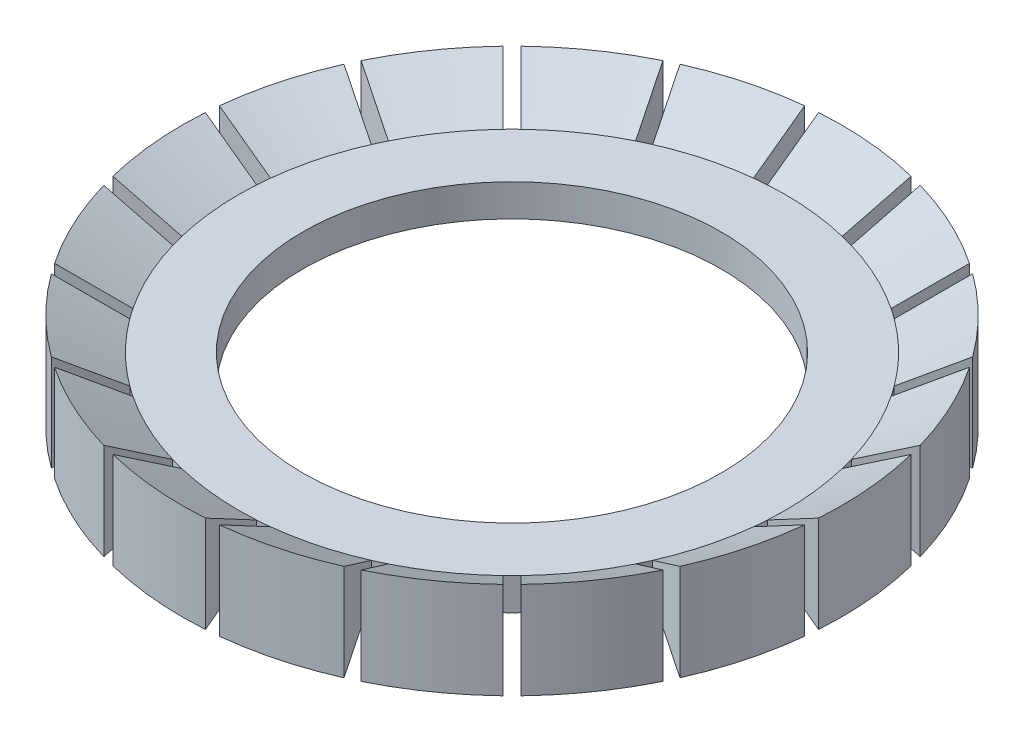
ISO-10303-21;
HEADER;
FILE_DESCRIPTION(('STEP AP214'),'2;1');
FILE_NAME('part.step','',(''),(''),'','','');
FILE_SCHEMA(('AUTOMOTIVE_DESIGN { 1 0 10303 214 1 1 1 1 }'));
ENDSEC;
DATA;
#1=APPLICATION_CONTEXT('core data for automotive mechanical design processes');
#2=APPLICATION_PROTOCOL_DEFINITION('international standard','automotive_design',2000,#1);
#3=PRODUCT_CONTEXT('',#1,'mechanical');
#4=PRODUCT('Part','Part','',(#3));
#5=PRODUCT_RELATED_PRODUCT_CATEGORY('part','',(#4));
#6=PRODUCT_DEFINITION_FORMATION('','',#4);
#7=PRODUCT_DEFINITION_CONTEXT('part definition',#1,'design');
#8=PRODUCT_DEFINITION('design','',#6,#7);
#9=PRODUCT_DEFINITION_SHAPE('','',#8);
#10=(LENGTH_UNIT() NAMED_UNIT(*) SI_UNIT(.MILLI.,.METRE.));
#11=(NAMED_UNIT(*) PLANE_ANGLE_UNIT() SI_UNIT($,.RADIAN.));
#12=(NAMED_UNIT(*) SI_UNIT($,.STERADIAN.) SOLID_ANGLE_UNIT());
#13=UNCERTAINTY_MEASURE_WITH_UNIT(LENGTH_MEASURE(1.E-05),#10,'distance_accuracy_value','');
#14=(GEOMETRIC_REPRESENTATION_CONTEXT(3) GLOBAL_UNCERTAINTY_ASSIGNED_CONTEXT((#13)) GLOBAL_UNIT_ASSIGNED_CONTEXT((#10,
#11,#12)) REPRESENTATION_CONTEXT('',''));
#15=CARTESIAN_POINT('',(0.,0.,0.));
#16=DIRECTION('',(0.,0.,1.));
#17=DIRECTION('',(1.,0.,0.));
#18=AXIS2_PLACEMENT_3D('',#15,#16,#17);
#19=CARTESIAN_POINT('',(0.,1.50000000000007,0.));
#20=DIRECTION('',(0.,1.,0.));
#21=DIRECTION('',(0.,0.,1.));
#22=AXIS2_PLACEMENT_3D('',#19,#20,#21);
#23=CONICAL_SURFACE('',#22,10.2499999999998,1.05165021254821);
#24=CARTESIAN_POINT('',(-7.10504329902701,1.50000000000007,-7.38788601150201));
#25=CARTESIAN_POINT('',(-6.89875863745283,1.33332794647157,-7.18160134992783));
#26=CARTESIAN_POINT('',(-6.69247288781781,1.16665858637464,-6.97531560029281));
#27=CARTESIAN_POINT('',(-6.27989921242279,0.833325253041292,-6.56274192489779));
#28=CARTESIAN_POINT('',(-6.07361128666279,0.666661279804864,-6.35645399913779));
#29=CARTESIAN_POINT('',(-5.86732227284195,0.50000000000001,-6.15016498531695));
#30=B_SPLINE_CURVE_WITH_KNOTS('',3,(#24,#25,#26,#27,#28,#29),.UNSPECIFIED.,.F.,.F.,(4,2,4),(0.,
1.00795668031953,2.0159133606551),.UNSPECIFIED.);
#31=CARTESIAN_POINT('',(-7.10504329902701,1.50000000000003,-7.38788601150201));
#32=VERTEX_POINT('',#31);
#33=CARTESIAN_POINT('',(-5.86732227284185,0.500000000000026,-6.15016498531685));
#34=VERTEX_POINT('',#33);
#35=EDGE_CURVE('E517',#32,#34,#30,.T.);
#36=ORIENTED_EDGE('',*,*,#35,.T.);
#37=CARTESIAN_POINT('',(0.,0.500000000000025,0.));
#38=DIRECTION('',(0.,1.,0.));
#39=DIRECTION('',(0.,0.,1.));
#40=AXIS2_PLACEMENT_3D('',#37,#38,#39);
#41=CIRCLE('',#40,8.50000000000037);
#42=CARTESIAN_POINT('',(-3.77252224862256,0.500000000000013,-7.61695975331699));
#43=VERTEX_POINT('',#42);
#44=EDGE_CURVE('E508',#43,#34,#41,.T.);
#45=ORIENTED_EDGE('',*,*,#44,.F.);
#46=CARTESIAN_POINT('',(-3.77252224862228,0.499999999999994,-7.61695975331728));
#47=CARTESIAN_POINT('',(-3.89581551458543,0.666661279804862,-7.88136301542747));
#48=CARTESIAN_POINT('',(-4.01910813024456,0.833325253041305,-8.14576488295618));
#49=CARTESIAN_POINT('',(-4.26569206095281,1.16665858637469,-8.67456582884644));
#50=CARTESIAN_POINT('',(-4.38898337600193,1.33332794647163,-8.938964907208));
#51=CARTESIAN_POINT('',(-4.51227404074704,1.50000000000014,-9.20336259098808));
#52=B_SPLINE_CURVE_WITH_KNOTS('',3,(#46,#47,#48,#49,#50,#51),.UNSPECIFIED.,.F.,.F.,(4,2,4),(0.,
1.00795668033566,2.01591336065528),.UNSPECIFIED.);
#53=CARTESIAN_POINT('',(-4.51227404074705,1.50000000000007,-9.20336259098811));
#54=VERTEX_POINT('',#53);
#55=EDGE_CURVE('E45',#43,#54,#52,.T.);
#56=ORIENTED_EDGE('',*,*,#55,.T.);
#57=CARTESIAN_POINT('',(0.,1.5,0.));
#58=DIRECTION('',(0.,1.,0.));
#59=DIRECTION('',(0.,0.,1.));
#60=AXIS2_PLACEMENT_3D('',#57,#58,#59);
#61=CIRCLE('',#60,10.25);
#62=EDGE_CURVE('E495',#32,#54,#61,.F.);
#63=ORIENTED_EDGE('',*,*,#62,.F.);
#64=EDGE_LOOP('',(#36,#45,#56,#63));
#65=FACE_BOUND('',#64,.T.);
#66=ADVANCED_FACE('F41',(#65),#23,.F.);
#67=CARTESIAN_POINT('',(0.,1.50000000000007,0.));
#68=DIRECTION('',(0.,1.,0.));
#69=DIRECTION('',(0.,0.,1.));
#70=AXIS2_PLACEMENT_3D('',#67,#68,#69);
#71=CONICAL_SURFACE('',#70,10.2499999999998,1.05165021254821);
#72=CARTESIAN_POINT('',(-6.15016498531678,0.499999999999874,-5.86732227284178));
#73=CARTESIAN_POINT('',(-6.35645399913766,0.666661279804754,-6.07361128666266));
#74=CARTESIAN_POINT('',(-6.56274192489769,0.833325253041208,-6.27989921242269));
#75=CARTESIAN_POINT('',(-6.97531560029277,1.16665858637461,-6.69247288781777));
#76=CARTESIAN_POINT('',(-7.18160134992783,1.33332794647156,-6.89875863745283));
#77=CARTESIAN_POINT('',(-7.38788601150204,1.50000000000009,-7.10504329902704));
#78=B_SPLINE_CURVE_WITH_KNOTS('',3,(#72,#73,#74,#75,#76,#77),.UNSPECIFIED.,.F.,.F.,(4,2,4),(0.,
1.00795668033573,2.01591336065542),.UNSPECIFIED.);
#79=CARTESIAN_POINT('',(-6.1501649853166,0.500000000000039,-5.8673222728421));
#80=VERTEX_POINT('',#79);
#81=CARTESIAN_POINT('',(-7.3878860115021,1.50000000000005,-7.1050432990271));
#82=VERTEX_POINT('',#81);
#83=EDGE_CURVE('E1317',#80,#82,#78,.T.);
#84=ORIENTED_EDGE('',*,*,#83,.T.);
#85=CARTESIAN_POINT('',(0.,1.5,0.));
#86=DIRECTION('',(0.,1.,0.));
#87=DIRECTION('',(0.,0.,1.));
#88=AXIS2_PLACEMENT_3D('',#85,#86,#87);
#89=CIRCLE('',#88,10.25);
#90=CARTESIAN_POINT('',(-9.20336259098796,1.50000000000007,-4.51227404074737));
#91=VERTEX_POINT('',#90);
#92=EDGE_CURVE('E1313',#91,#82,#89,.F.);
#93=ORIENTED_EDGE('',*,*,#92,.F.);
#94=CARTESIAN_POINT('',(-9.20336259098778,1.50000000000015,-4.51227404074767));
#95=CARTESIAN_POINT('',(-8.93896490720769,1.33332794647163,-4.38898337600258));
#96=CARTESIAN_POINT('',(-8.67456582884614,1.1666585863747,-4.26569206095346));
#97=CARTESIAN_POINT('',(-8.14576488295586,0.833325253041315,-4.01910813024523));
#98=CARTESIAN_POINT('',(-7.88136301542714,0.666661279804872,-3.89581551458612));
#99=CARTESIAN_POINT('',(-7.61695975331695,0.500000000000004,-3.77252224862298));
#100=B_SPLINE_CURVE_WITH_KNOTS('',3,(#94,#95,#96,#97,#98,#99),.UNSPECIFIED.,.F.,.F.,(4,2,4),(0.,
1.00795668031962,2.01591336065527),.UNSPECIFIED.);
#101=CARTESIAN_POINT('',(-7.61695975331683,0.50000000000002,-3.77252224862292));
#102=VERTEX_POINT('',#101);
#103=EDGE_CURVE('E1326',#91,#102,#100,.T.);
#104=ORIENTED_EDGE('',*,*,#103,.T.);
#105=CARTESIAN_POINT('',(0.,0.500000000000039,0.));
#106=DIRECTION('',(0.,1.,0.));
#107=DIRECTION('',(0.,0.,1.));
#108=AXIS2_PLACEMENT_3D('',#105,#106,#107);
#109=CIRCLE('',#108,8.50000000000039);
#110=EDGE_CURVE('E789',#80,#102,#109,.T.);
#111=ORIENTED_EDGE('',*,*,#110,.F.);
#112=EDGE_LOOP('',(#84,#93,#104,#111));
#113=FACE_BOUND('',#112,.T.);
#114=ADVANCED_FACE('F1449',(#113),#71,.F.);
#115=CARTESIAN_POINT('',(0.,1.50000000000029,0.));
#116=DIRECTION('',(0.,1.,0.));
#117=DIRECTION('',(0.,0.,1.));
#118=AXIS2_PLACEMENT_3D('',#115,#116,#117);
#119=CONICAL_SURFACE('',#118,10.2500000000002,1.05165021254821);
#120=CARTESIAN_POINT('',(-7.78600705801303,0.499999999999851,-3.40999913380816));
#121=CARTESIAN_POINT('',(-8.05041032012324,0.666661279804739,-3.53329239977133));
#122=CARTESIAN_POINT('',(-8.31481218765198,0.8333252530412,-3.65658501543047));
#123=CARTESIAN_POINT('',(-8.84361313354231,1.16665858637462,-3.90316894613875));
#124=CARTESIAN_POINT('',(-9.10801221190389,1.33332794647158,-4.02646026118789));
#125=CARTESIAN_POINT('',(-9.372409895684,1.50000000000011,-4.149750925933));
#126=B_SPLINE_CURVE_WITH_KNOTS('',3,(#120,#121,#122,#123,#124,#125),.UNSPECIFIED.,.F.,.F.,(4,2,
4),(0.,1.00795668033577,2.0159133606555),.UNSPECIFIED.);
#127=CARTESIAN_POINT('',(-7.78600705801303,0.499999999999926,-3.40999913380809));
#128=VERTEX_POINT('',#127);
#129=CARTESIAN_POINT('',(-9.37240989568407,1.50000000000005,-4.14975092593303));
#130=VERTEX_POINT('',#129);
#131=EDGE_CURVE('E1290',#128,#130,#126,.T.);
#132=ORIENTED_EDGE('',*,*,#131,.T.);
#133=CARTESIAN_POINT('',(0.,1.5,0.));
#134=DIRECTION('',(0.,1.,0.));
#135=DIRECTION('',(0.,0.,1.));
#136=AXIS2_PLACEMENT_3D('',#133,#134,#135);
#137=CIRCLE('',#136,10.25);
#138=CARTESIAN_POINT('',(-10.1916205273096,1.50000000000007,-1.09241522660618));
#139=VERTEX_POINT('',#138);
#140=EDGE_CURVE('E1286',#139,#130,#137,.F.);
#141=ORIENTED_EDGE('',*,*,#140,.F.);
#142=CARTESIAN_POINT('',(-10.1916205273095,1.50000000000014,-1.09241522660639));
#143=CARTESIAN_POINT('',(-9.90100008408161,1.3333279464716,-1.06698923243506));
#144=CARTESIAN_POINT('',(-9.61037810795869,1.16665858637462,-1.04156310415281));
#145=CARTESIAN_POINT('',(-9.02913108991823,0.833325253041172,-0.990710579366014));
#146=CARTESIAN_POINT('',(-8.7385060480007,0.666661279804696,-0.965284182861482));
#147=CARTESIAN_POINT('',(-8.44787947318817,0.499999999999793,-0.939857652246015));
#148=B_SPLINE_CURVE_WITH_KNOTS('',3,(#142,#143,#144,#145,#146,#147),.UNSPECIFIED.,.F.,.F.,(4,2,
4),(0.,1.00795668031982,2.01591336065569),.UNSPECIFIED.);
#149=CARTESIAN_POINT('',(-8.4478794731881,0.499999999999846,-0.939857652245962));
#150=VERTEX_POINT('',#149);
#151=EDGE_CURVE('E1299',#139,#150,#148,.T.);
#152=ORIENTED_EDGE('',*,*,#151,.T.);
#153=CARTESIAN_POINT('',(0.,0.49999999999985,0.));
#154=DIRECTION('',(0.,1.,0.));
#155=DIRECTION('',(0.,0.,1.));
#156=AXIS2_PLACEMENT_3D('',#153,#154,#155);
#157=CIRCLE('',#156,8.50000000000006);
#158=EDGE_CURVE('E793',#128,#150,#157,.T.);
#159=ORIENTED_EDGE('',*,*,#158,.F.);
#160=EDGE_LOOP('',(#132,#141,#152,#159));
#161=FACE_BOUND('',#160,.T.);
#162=ADVANCED_FACE('F1444',(#161),#119,.F.);
#163=CARTESIAN_POINT('',(0.,1.50000000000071,0.));
#164=DIRECTION('',(0.,1.,0.));
#165=DIRECTION('',(0.,0.,1.));
#166=AXIS2_PLACEMENT_3D('',#163,#164,#165);
#167=CONICAL_SURFACE('',#166,10.2500000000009,1.05165021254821);
#168=CARTESIAN_POINT('',(-8.48274177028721,0.499999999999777,-0.541379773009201));
#169=CARTESIAN_POINT('',(-8.77336834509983,0.66666127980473,-0.566806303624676));
#170=CARTESIAN_POINT('',(-9.06399338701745,0.833325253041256,-0.592232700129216));
#171=CARTESIAN_POINT('',(-9.64524040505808,1.16665858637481,-0.643085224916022));
#172=CARTESIAN_POINT('',(-9.93586238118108,1.33332794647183,-0.668511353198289));
#173=CARTESIAN_POINT('',(-10.2264828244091,1.50000000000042,-0.693937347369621));
#174=B_SPLINE_CURVE_WITH_KNOTS('',3,(#168,#169,#170,#171,#172,#173),.UNSPECIFIED.,.F.,.F.,(4,2,
4),(0.,1.00795668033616,2.01591336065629),.UNSPECIFIED.);
#175=CARTESIAN_POINT('',(-8.48274177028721,0.499999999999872,-0.541379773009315));
#176=VERTEX_POINT('',#175);
#177=CARTESIAN_POINT('',(-10.2264828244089,1.50000000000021,-0.693937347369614));
#178=VERTEX_POINT('',#177);
#179=EDGE_CURVE('E1263',#176,#178,#174,.T.);
#180=ORIENTED_EDGE('',*,*,#179,.T.);
#181=CARTESIAN_POINT('',(0.,1.5,0.));
#182=DIRECTION('',(0.,1.,0.));
#183=DIRECTION('',(0.,0.,1.));
#184=AXIS2_PLACEMENT_3D('',#181,#182,#183);
#185=CIRCLE('',#184,10.25);
#186=CARTESIAN_POINT('',(-9.95061861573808,1.50000000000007,2.45920498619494));
#187=VERTEX_POINT('',#186);
#188=EDGE_CURVE('E1259',#187,#178,#185,.F.);
#189=ORIENTED_EDGE('',*,*,#188,.F.);
#190=CARTESIAN_POINT('',(-9.95061861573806,1.50000000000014,2.45920498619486));
#191=CARTESIAN_POINT('',(-9.66882852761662,1.33332794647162,2.38369955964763));
#192=CARTESIAN_POINT('',(-9.38703695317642,1.16665858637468,2.30819373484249));
#193=CARTESIAN_POINT('',(-8.82345083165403,0.83332525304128,2.1571812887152));
#194=CARTESIAN_POINT('',(-8.54165628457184,0.666661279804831,2.08167466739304));
#195=CARTESIAN_POINT('',(-8.25986025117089,0.499999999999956,2.00616764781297));
#196=B_SPLINE_CURVE_WITH_KNOTS('',3,(#190,#191,#192,#193,#194,#195),.UNSPECIFIED.,.F.,.F.,(4,2,
4),(0.,1.00795668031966,2.01591336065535),.UNSPECIFIED.);
#197=CARTESIAN_POINT('',(-8.25986025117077,0.499999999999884,2.00616764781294));
#198=VERTEX_POINT('',#197);
#199=EDGE_CURVE('E1272',#187,#198,#196,.T.);
#200=ORIENTED_EDGE('',*,*,#199,.T.);
#201=CARTESIAN_POINT('',(0.,0.499999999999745,0.));
#202=DIRECTION('',(0.,1.,0.));
#203=DIRECTION('',(0.,0.,1.));
#204=AXIS2_PLACEMENT_3D('',#201,#202,#203);
#205=CIRCLE('',#204,8.49999999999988);
#206=EDGE_CURVE('E798',#176,#198,#205,.T.);
#207=ORIENTED_EDGE('',*,*,#206,.F.);
#208=EDGE_LOOP('',(#180,#189,#200,#207));
#209=FACE_BOUND('',#208,.T.);
#210=ADVANCED_FACE('F1448',(#209),#167,.F.);
#211=CARTESIAN_POINT('',(0.,1.50000000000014,0.));
#212=DIRECTION('',(0.,1.,0.));
#213=DIRECTION('',(0.,0.,1.));
#214=AXIS2_PLACEMENT_3D('',#211,#212,#213);
#215=CONICAL_SURFACE('',#214,10.2499999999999,1.05165021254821);
#216=CARTESIAN_POINT('',(-8.15633263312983,0.500000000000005,2.39253797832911));
#217=CARTESIAN_POINT('',(-8.43812866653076,0.666661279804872,2.46804499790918));
#218=CARTESIAN_POINT('',(-8.71992321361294,0.833325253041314,2.54355161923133));
#219=CARTESIAN_POINT('',(-9.2835093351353,1.16665858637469,2.69456406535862));
#220=CARTESIAN_POINT('',(-9.56530090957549,1.33332794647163,2.77006989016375));
#221=CARTESIAN_POINT('',(-9.84709099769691,1.50000000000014,2.84557531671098));
#222=B_SPLINE_CURVE_WITH_KNOTS('',3,(#216,#217,#218,#219,#220,#221),.UNSPECIFIED.,.F.,.F.,(4,2,
4),(0.,1.00795668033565,2.01591336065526),.UNSPECIFIED.);
#223=CARTESIAN_POINT('',(-8.15633263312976,0.500000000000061,2.39253797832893));
#224=VERTEX_POINT('',#223);
#225=CARTESIAN_POINT('',(-9.84709099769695,1.50000000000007,2.84557531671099));
#226=VERTEX_POINT('',#225);
#227=EDGE_CURVE('E1236',#224,#226,#222,.T.);
#228=ORIENTED_EDGE('',*,*,#227,.T.);
#229=CARTESIAN_POINT('',(0.,1.5,0.));
#230=DIRECTION('',(0.,1.,0.));
#231=DIRECTION('',(0.,0.,1.));
#232=AXIS2_PLACEMENT_3D('',#229,#230,#231);
#233=CIRCLE('',#232,10.25);
#234=CARTESIAN_POINT('',(-8.50942524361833,1.50000000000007,5.71420878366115));
#235=VERTEX_POINT('',#234);
#236=EDGE_CURVE('E1232',#235,#226,#233,.F.);
#237=ORIENTED_EDGE('',*,*,#236,.F.);
#238=CARTESIAN_POINT('',(-8.50942524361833,1.50000000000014,5.71420878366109));
#239=CARTESIAN_POINT('',(-8.27045355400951,1.3333279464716,5.5468790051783));
#240=CARTESIAN_POINT('',(-8.03148060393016,1.16665858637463,5.37954834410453));
#241=CARTESIAN_POINT('',(-7.55353218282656,0.833325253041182,5.0448852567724));
#242=CARTESIAN_POINT('',(-7.31455671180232,0.666661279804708,4.87755283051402));
#243=CARTESIAN_POINT('',(-7.07557998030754,0.499999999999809,4.71021952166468));
#244=B_SPLINE_CURVE_WITH_KNOTS('',3,(#238,#239,#240,#241,#242,#243),.UNSPECIFIED.,.F.,.F.,(4,2,
4),(0.,1.00795668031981,2.01591336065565),.UNSPECIFIED.);
#245=CARTESIAN_POINT('',(-7.07557998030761,0.499999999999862,4.71021952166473));
#246=VERTEX_POINT('',#245);
#247=EDGE_CURVE('E1245',#235,#246,#244,.T.);
#248=ORIENTED_EDGE('',*,*,#247,.T.);
#249=CARTESIAN_POINT('',(0.,0.500000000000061,0.));
#250=DIRECTION('',(0.,1.,0.));
#251=DIRECTION('',(0.,0.,1.));
#252=AXIS2_PLACEMENT_3D('',#249,#250,#251);
#253=CIRCLE('',#252,8.50000000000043);
#254=EDGE_CURVE('E803',#224,#246,#253,.T.);
#255=ORIENTED_EDGE('',*,*,#254,.F.);
#256=EDGE_LOOP('',(#228,#237,#248,#255));
#257=FACE_BOUND('',#256,.T.);
#258=ADVANCED_FACE('F1586',(#257),#215,.F.);
#259=CARTESIAN_POINT('',(0.,1.50000000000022,0.));
#260=DIRECTION('',(0.,1.,0.));
#261=DIRECTION('',(0.,0.,1.));
#262=AXIS2_PLACEMENT_3D('',#259,#260,#261);
#263=CONICAL_SURFACE('',#262,10.2500000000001,1.05165021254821);
#264=CARTESIAN_POINT('',(-6.84614940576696,0.499999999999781,5.03788033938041));
#265=CARTESIAN_POINT('',(-7.08512613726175,0.666661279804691,5.20521364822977));
#266=CARTESIAN_POINT('',(-7.32410160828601,0.833325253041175,5.37254607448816));
#267=CARTESIAN_POINT('',(-7.80205002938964,1.16665858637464,5.70720916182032));
#268=CARTESIAN_POINT('',(-8.04102297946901,1.33332794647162,5.87453982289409));
#269=CARTESIAN_POINT('',(-8.27999466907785,1.50000000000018,6.04186960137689));
#270=B_SPLINE_CURVE_WITH_KNOTS('',3,(#264,#265,#266,#267,#268,#269),.UNSPECIFIED.,.F.,.F.,(4,2,
4),(0.,1.00795668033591,2.01591336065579),.UNSPECIFIED.);
#271=CARTESIAN_POINT('',(-6.84614940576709,0.49999999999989,5.03788033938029));
#272=VERTEX_POINT('',#271);
#273=CARTESIAN_POINT('',(-8.27999466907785,1.50000000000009,6.04186960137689));
#274=VERTEX_POINT('',#273);
#275=EDGE_CURVE('E1209',#272,#274,#270,.T.);
#276=ORIENTED_EDGE('',*,*,#275,.T.);
#277=CARTESIAN_POINT('',(0.,1.5,0.));
#278=DIRECTION('',(0.,1.,0.));
#279=DIRECTION('',(0.,0.,1.));
#280=AXIS2_PLACEMENT_3D('',#277,#278,#279);
#281=CIRCLE('',#280,10.25);
#282=CARTESIAN_POINT('',(-6.04186960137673,1.50000000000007,8.27999466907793));
#283=VERTEX_POINT('',#282);
#284=EDGE_CURVE('E1205',#283,#274,#281,.F.);
#285=ORIENTED_EDGE('',*,*,#284,.F.);
#286=CARTESIAN_POINT('',(-6.04186960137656,1.50000000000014,8.279994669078));
#287=CARTESIAN_POINT('',(-5.87453982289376,1.33332794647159,8.04102297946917));
#288=CARTESIAN_POINT('',(-5.70720916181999,1.16665858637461,7.80205002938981));
#289=CARTESIAN_POINT('',(-5.37254607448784,0.833325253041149,7.32410160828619));
#290=CARTESIAN_POINT('',(-5.20521364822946,0.666661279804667,7.08512613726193));
#291=CARTESIAN_POINT('',(-5.0378803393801,0.49999999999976,6.84614940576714));
#292=B_SPLINE_CURVE_WITH_KNOTS('',3,(#286,#287,#288,#289,#290,#291),.UNSPECIFIED.,.F.,.F.,(4,2,
4),(0.,1.00795668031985,2.01591336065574),.UNSPECIFIED.);
#293=CARTESIAN_POINT('',(-5.03788033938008,0.49999999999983,6.84614940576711));
#294=VERTEX_POINT('',#293);
#295=EDGE_CURVE('E1218',#283,#294,#292,.T.);
#296=ORIENTED_EDGE('',*,*,#295,.T.);
#297=CARTESIAN_POINT('',(0.,0.499999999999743,0.));
#298=DIRECTION('',(0.,1.,0.));
#299=DIRECTION('',(0.,0.,1.));
#300=AXIS2_PLACEMENT_3D('',#297,#298,#299);
#301=CIRCLE('',#300,8.49999999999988);
#302=EDGE_CURVE('E811',#272,#294,#301,.T.);
#303=ORIENTED_EDGE('',*,*,#302,.F.);
#304=EDGE_LOOP('',(#276,#285,#296,#303));
#305=FACE_BOUND('',#304,.T.);
#306=ADVANCED_FACE('F1590',(#305),#263,.F.);
#307=CARTESIAN_POINT('',(0.,1.50000000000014,0.));
#308=DIRECTION('',(0.,1.,0.));
#309=DIRECTION('',(0.,0.,1.));
#310=AXIS2_PLACEMENT_3D('',#307,#308,#309);
#311=CONICAL_SURFACE('',#310,10.2499999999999,1.05165021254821);
#312=CARTESIAN_POINT('',(-4.71021952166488,0.499999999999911,7.07557998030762));
#313=CARTESIAN_POINT('',(-4.87755283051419,0.666661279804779,7.31455671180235));
#314=CARTESIAN_POINT('',(-5.04488525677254,0.833325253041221,7.55353218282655));
#315=CARTESIAN_POINT('',(-5.37954834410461,1.1666585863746,8.03148060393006));
#316=CARTESIAN_POINT('',(-5.54687900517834,1.33332794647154,8.27045355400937));
#317=CARTESIAN_POINT('',(-5.7142087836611,1.50000000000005,8.50942524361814));
#318=B_SPLINE_CURVE_WITH_KNOTS('',3,(#312,#313,#314,#315,#316,#317),.UNSPECIFIED.,.F.,.F.,(4,2,
4),(0.,1.00795668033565,2.01591336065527),.UNSPECIFIED.);
#319=CARTESIAN_POINT('',(-4.71021952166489,0.49999999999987,7.07557998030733));
#320=VERTEX_POINT('',#319);
#321=CARTESIAN_POINT('',(-5.71420878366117,1.50000000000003,8.50942524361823));
#322=VERTEX_POINT('',#321);
#323=EDGE_CURVE('E1182',#320,#322,#318,.T.);
#324=ORIENTED_EDGE('',*,*,#323,.T.);
#325=CARTESIAN_POINT('',(0.,1.5,0.));
#326=DIRECTION('',(0.,1.,0.));
#327=DIRECTION('',(0.,0.,1.));
#328=AXIS2_PLACEMENT_3D('',#325,#326,#327);
#329=CIRCLE('',#328,10.25);
#330=CARTESIAN_POINT('',(-2.84557531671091,1.50000000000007,9.84709099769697));
#331=VERTEX_POINT('',#330);
#332=EDGE_CURVE('E1178',#331,#322,#329,.F.);
#333=ORIENTED_EDGE('',*,*,#332,.F.);
#334=CARTESIAN_POINT('',(-2.84557531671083,1.50000000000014,9.84709099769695));
#335=CARTESIAN_POINT('',(-2.77006989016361,1.33332794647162,9.56530090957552));
#336=CARTESIAN_POINT('',(-2.69456406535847,1.16665858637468,9.28350933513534));
#337=CARTESIAN_POINT('',(-2.54355161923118,0.8333252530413,8.71992321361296));
#338=CARTESIAN_POINT('',(-2.46804499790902,0.666661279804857,8.43812866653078));
#339=CARTESIAN_POINT('',(-2.39253797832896,0.499999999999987,8.15633263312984));
#340=B_SPLINE_CURVE_WITH_KNOTS('',3,(#334,#335,#336,#337,#338,#339),.UNSPECIFIED.,.F.,.F.,(4,2,
4),(0.,1.00795668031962,2.01591336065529),.UNSPECIFIED.);
#341=CARTESIAN_POINT('',(-2.39253797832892,0.499999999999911,8.15633263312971));
#342=VERTEX_POINT('',#341);
#343=EDGE_CURVE('E1191',#331,#342,#340,.T.);
#344=ORIENTED_EDGE('',*,*,#343,.T.);
#345=CARTESIAN_POINT('',(0.,0.49999999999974,0.));
#346=DIRECTION('',(0.,1.,0.));
#347=DIRECTION('',(0.,0.,1.));
#348=AXIS2_PLACEMENT_3D('',#345,#346,#347);
#349=CIRCLE('',#348,8.49999999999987);
#350=EDGE_CURVE('E815',#320,#342,#349,.T.);
#351=ORIENTED_EDGE('',*,*,#350,.F.);
#352=EDGE_LOOP('',(#324,#333,#344,#351));
#353=FACE_BOUND('',#352,.T.);
#354=ADVANCED_FACE('F1596',(#353),#311,.F.);
#355=CARTESIAN_POINT('',(0.,1.50000000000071,0.));
#356=DIRECTION('',(0.,1.,0.));
#357=DIRECTION('',(0.,0.,1.));
#358=AXIS2_PLACEMENT_3D('',#355,#356,#357);
#359=CONICAL_SURFACE('',#358,10.2500000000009,1.05165021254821);
#360=CARTESIAN_POINT('',(-2.00616764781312,0.499999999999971,8.25986025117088));
#361=CARTESIAN_POINT('',(-2.08167466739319,0.66666127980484,8.54165628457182));
#362=CARTESIAN_POINT('',(-2.15718128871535,0.833325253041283,8.823450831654));
#363=CARTESIAN_POINT('',(-2.30819373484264,1.16665858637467,9.38703695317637));
#364=CARTESIAN_POINT('',(-2.38369955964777,1.3333279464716,9.66882852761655));
#365=CARTESIAN_POINT('',(-2.45920498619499,1.50000000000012,9.95061861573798));
#366=B_SPLINE_CURVE_WITH_KNOTS('',3,(#360,#361,#362,#363,#364,#365),.UNSPECIFIED.,.F.,.F.,(4,2,
4),(0.,1.00795668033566,2.01591336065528),.UNSPECIFIED.);
#367=CARTESIAN_POINT('',(-2.00616764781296,0.500000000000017,8.25986025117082));
#368=VERTEX_POINT('',#367);
#369=CARTESIAN_POINT('',(-2.45920498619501,1.50000000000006,9.95061861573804));
#370=VERTEX_POINT('',#369);
#371=EDGE_CURVE('E1155',#368,#370,#366,.T.);
#372=ORIENTED_EDGE('',*,*,#371,.T.);
#373=CARTESIAN_POINT('',(0.,1.5,0.));
#374=DIRECTION('',(0.,1.,0.));
#375=DIRECTION('',(0.,0.,1.));
#376=AXIS2_PLACEMENT_3D('',#373,#374,#375);
#377=CIRCLE('',#376,10.25);
#378=CARTESIAN_POINT('',(0.693937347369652,1.50000000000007,10.2264828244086));
#379=VERTEX_POINT('',#378);
#380=EDGE_CURVE('E1151',#379,#370,#377,.F.);
#381=ORIENTED_EDGE('',*,*,#380,.F.);
#382=CARTESIAN_POINT('',(0.693937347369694,1.50000000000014,10.2264828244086));
#383=CARTESIAN_POINT('',(0.66851135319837,1.33332794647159,9.93586238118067));
#384=CARTESIAN_POINT('',(0.643085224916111,1.16665858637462,9.64524040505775));
#385=CARTESIAN_POINT('',(0.59223270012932,0.833325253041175,9.0639933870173));
#386=CARTESIAN_POINT('',(0.566806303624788,0.6666612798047,8.77336834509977));
#387=CARTESIAN_POINT('',(0.541379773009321,0.499999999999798,8.48274177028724));
#388=B_SPLINE_CURVE_WITH_KNOTS('',3,(#382,#383,#384,#385,#386,#387),.UNSPECIFIED.,.F.,.F.,(4,2,
4),(0.,1.00795668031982,2.01591336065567),.UNSPECIFIED.);
#389=CARTESIAN_POINT('',(0.541379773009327,0.499999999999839,8.48274177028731));
#390=VERTEX_POINT('',#389);
#391=EDGE_CURVE('E1164',#379,#390,#388,.T.);
#392=ORIENTED_EDGE('',*,*,#391,.T.);
#393=CARTESIAN_POINT('',(0.,0.500000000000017,0.));
#394=DIRECTION('',(0.,1.,0.));
#395=DIRECTION('',(0.,0.,1.));
#396=AXIS2_PLACEMENT_3D('',#393,#394,#395);
#397=CIRCLE('',#396,8.50000000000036);
#398=EDGE_CURVE('E820',#368,#390,#397,.T.);
#399=ORIENTED_EDGE('',*,*,#398,.F.);
#400=EDGE_LOOP('',(#372,#381,#392,#399));
#401=FACE_BOUND('',#400,.T.);
#402=ADVANCED_FACE('F1705',(#401),#359,.F.);
#403=CARTESIAN_POINT('',(0.,1.50000000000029,0.));
#404=DIRECTION('',(0.,1.,0.));
#405=DIRECTION('',(0.,0.,1.));
#406=AXIS2_PLACEMENT_3D('',#403,#404,#405);
#407=CONICAL_SURFACE('',#406,10.2500000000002,1.05165021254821);
#408=CARTESIAN_POINT('',(0.939857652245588,0.499999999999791,8.44787947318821));
#409=CARTESIAN_POINT('',(0.965284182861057,0.666661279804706,8.73850604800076));
#410=CARTESIAN_POINT('',(0.990710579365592,0.833325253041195,9.02913108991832));
#411=CARTESIAN_POINT('',(1.04156310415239,1.16665858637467,9.61037810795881));
#412=CARTESIAN_POINT('',(1.06698923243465,1.33332794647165,9.90100008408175));
#413=CARTESIAN_POINT('',(1.09241522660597,1.50000000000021,10.1916205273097));
#414=B_SPLINE_CURVE_WITH_KNOTS('',3,(#408,#409,#410,#411,#412,#413),.UNSPECIFIED.,.F.,.F.,(4,2,
4),(0.,1.00795668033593,2.01591336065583),.UNSPECIFIED.);
#415=CARTESIAN_POINT('',(0.939857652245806,0.499999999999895,8.44787947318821));
#416=VERTEX_POINT('',#415);
#417=CARTESIAN_POINT('',(1.09241522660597,1.50000000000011,10.1916205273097));
#418=VERTEX_POINT('',#417);
#419=EDGE_CURVE('E1128',#416,#418,#414,.T.);
#420=ORIENTED_EDGE('',*,*,#419,.T.);
#421=CARTESIAN_POINT('',(0.,1.5,0.));
#422=DIRECTION('',(0.,1.,0.));
#423=DIRECTION('',(0.,0.,1.));
#424=AXIS2_PLACEMENT_3D('',#421,#422,#423);
#425=CIRCLE('',#424,10.25);
#426=CARTESIAN_POINT('',(4.14975092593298,1.50000000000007,9.37240989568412));
#427=VERTEX_POINT('',#426);
#428=EDGE_CURVE('E1124',#427,#418,#425,.F.);
#429=ORIENTED_EDGE('',*,*,#428,.F.);
#430=CARTESIAN_POINT('',(4.1497509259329,1.50000000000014,9.37240989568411));
#431=CARTESIAN_POINT('',(4.02646026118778,1.3333279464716,9.10801221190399));
#432=CARTESIAN_POINT('',(3.90316894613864,1.16665858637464,8.84361313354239));
#433=CARTESIAN_POINT('',(3.65658501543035,0.833325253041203,8.31481218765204));
#434=CARTESIAN_POINT('',(3.5332923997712,0.666661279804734,8.05041032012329));
#435=CARTESIAN_POINT('',(3.40999913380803,0.49999999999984,7.78600705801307));
#436=B_SPLINE_CURVE_WITH_KNOTS('',3,(#430,#431,#432,#433,#434,#435),.UNSPECIFIED.,.F.,.F.,(4,2,
4),(0.,1.00795668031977,2.01591336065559),.UNSPECIFIED.);
#437=CARTESIAN_POINT('',(3.40999913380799,0.499999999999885,7.78600705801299));
#438=VERTEX_POINT('',#437);
#439=EDGE_CURVE('E1137',#427,#438,#436,.T.);
#440=ORIENTED_EDGE('',*,*,#439,.T.);
#441=CARTESIAN_POINT('',(0.,0.49999999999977,0.));
#442=DIRECTION('',(0.,1.,0.));
#443=DIRECTION('',(0.,0.,1.));
#444=AXIS2_PLACEMENT_3D('',#441,#442,#443);
#445=CIRCLE('',#444,8.49999999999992);
#446=EDGE_CURVE('E825',#416,#438,#445,.T.);
#447=ORIENTED_EDGE('',*,*,#446,.F.);
#448=EDGE_LOOP('',(#420,#429,#440,#447));
#449=FACE_BOUND('',#448,.T.);
#450=ADVANCED_FACE('F1788',(#449),#407,.F.);
#451=CARTESIAN_POINT('',(0.,1.50000000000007,0.));
#452=DIRECTION('',(0.,1.,0.));
#453=DIRECTION('',(0.,0.,1.));
#454=AXIS2_PLACEMENT_3D('',#451,#452,#453);
#455=CONICAL_SURFACE('',#454,10.2499999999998,1.05165021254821);
#456=CARTESIAN_POINT('',(3.77252224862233,0.499999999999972,7.61695975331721));
#457=CARTESIAN_POINT('',(3.89581551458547,0.666661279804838,7.8813630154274));
#458=CARTESIAN_POINT('',(4.01910813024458,0.833325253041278,8.14576488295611));
#459=CARTESIAN_POINT('',(4.26569206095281,1.16665858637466,8.67456582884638));
#460=CARTESIAN_POINT('',(4.38898337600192,1.33332794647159,8.93896490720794));
#461=CARTESIAN_POINT('',(4.51227404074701,1.5000000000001,9.20336259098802));
#462=B_SPLINE_CURVE_WITH_KNOTS('',3,(#456,#457,#458,#459,#460,#461),.UNSPECIFIED.,.F.,.F.,(4,2,
4),(0.,1.00795668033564,2.01591336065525),.UNSPECIFIED.);
#463=CARTESIAN_POINT('',(3.77252224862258,0.499999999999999,7.61695975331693));
#464=VERTEX_POINT('',#463);
#465=CARTESIAN_POINT('',(4.51227404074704,1.50000000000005,9.20336259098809));
#466=VERTEX_POINT('',#465);
#467=EDGE_CURVE('E1101',#464,#466,#462,.T.);
#468=ORIENTED_EDGE('',*,*,#467,.T.);
#469=CARTESIAN_POINT('',(0.,1.5,0.));
#470=DIRECTION('',(0.,1.,0.));
#471=DIRECTION('',(0.,0.,1.));
#472=AXIS2_PLACEMENT_3D('',#469,#470,#471);
#473=CIRCLE('',#472,10.25);
#474=CARTESIAN_POINT('',(7.10504329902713,1.50000000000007,7.38788601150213));
#475=VERTEX_POINT('',#474);
#476=EDGE_CURVE('E1097',#475,#466,#473,.F.);
#477=ORIENTED_EDGE('',*,*,#476,.F.);
#478=CARTESIAN_POINT('',(7.1050432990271,1.50000000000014,7.3878860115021));
#479=CARTESIAN_POINT('',(6.89875863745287,1.33332794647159,7.18160134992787));
#480=CARTESIAN_POINT('',(6.69247288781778,1.16665858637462,6.97531560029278));
#481=CARTESIAN_POINT('',(6.27989921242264,0.833325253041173,6.56274192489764));
#482=CARTESIAN_POINT('',(6.07361128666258,0.666661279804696,6.35645399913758));
#483=CARTESIAN_POINT('',(5.86732227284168,0.499999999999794,6.15016498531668));
#484=B_SPLINE_CURVE_WITH_KNOTS('',3,(#478,#479,#480,#481,#482,#483),.UNSPECIFIED.,.F.,.F.,(4,2,
4),(0.,1.00795668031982,2.01591336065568),.UNSPECIFIED.);
#485=CARTESIAN_POINT('',(5.86732227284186,0.499999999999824,6.15016498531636));
#486=VERTEX_POINT('',#485);
#487=EDGE_CURVE('E1110',#475,#486,#484,.T.);
#488=ORIENTED_EDGE('',*,*,#487,.T.);
#489=CARTESIAN_POINT('',(0.,0.500000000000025,0.));
#490=DIRECTION('',(0.,1.,0.));
#491=DIRECTION('',(0.,0.,1.));
#492=AXIS2_PLACEMENT_3D('',#489,#490,#491);
#493=CIRCLE('',#492,8.50000000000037);
#494=EDGE_CURVE('E833',#464,#486,#493,.T.);
#495=ORIENTED_EDGE('',*,*,#494,.F.);
#496=EDGE_LOOP('',(#468,#477,#488,#495));
#497=FACE_BOUND('',#496,.T.);
#498=ADVANCED_FACE('F1792',(#497),#455,.F.);
#499=CARTESIAN_POINT('',(0.,1.50000000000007,0.));
#500=DIRECTION('',(0.,1.,0.));
#501=DIRECTION('',(0.,0.,1.));
#502=AXIS2_PLACEMENT_3D('',#499,#500,#501);
#503=CONICAL_SURFACE('',#502,10.2499999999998,1.05165021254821);
#504=CARTESIAN_POINT('',(6.15016498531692,0.499999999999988,5.86732227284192));
#505=CARTESIAN_POINT('',(6.35645399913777,0.666661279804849,6.07361128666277));
#506=CARTESIAN_POINT('',(6.56274192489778,0.833325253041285,6.27989921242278));
#507=CARTESIAN_POINT('',(6.97531560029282,1.16665858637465,6.69247288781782));
#508=CARTESIAN_POINT('',(7.18160134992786,1.33332794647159,6.89875863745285));
#509=CARTESIAN_POINT('',(7.38788601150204,1.50000000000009,7.10504329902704));
#510=B_SPLINE_CURVE_WITH_KNOTS('',3,(#504,#505,#506,#507,#508,#509),.UNSPECIFIED.,.F.,.F.,(4,2,
4),(0.,1.00795668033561,2.01591336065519),.UNSPECIFIED.);
#511=CARTESIAN_POINT('',(6.15016498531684,0.500000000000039,5.86732227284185));
#512=VERTEX_POINT('',#511);
#513=CARTESIAN_POINT('',(7.3878860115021,1.50000000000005,7.1050432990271));
#514=VERTEX_POINT('',#513);
#515=EDGE_CURVE('E1074',#512,#514,#510,.T.);
#516=ORIENTED_EDGE('',*,*,#515,.T.);
#517=CARTESIAN_POINT('',(0.,1.5,0.));
#518=DIRECTION('',(0.,1.,0.));
#519=DIRECTION('',(0.,0.,1.));
#520=AXIS2_PLACEMENT_3D('',#517,#518,#519);
#521=CIRCLE('',#520,10.25);
#522=CARTESIAN_POINT('',(9.20336259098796,1.50000000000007,4.51227404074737));
#523=VERTEX_POINT('',#522);
#524=EDGE_CURVE('E1070',#523,#514,#521,.F.);
#525=ORIENTED_EDGE('',*,*,#524,.F.);
#526=CARTESIAN_POINT('',(9.20336259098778,1.50000000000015,4.51227404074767));
#527=CARTESIAN_POINT('',(8.93896490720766,1.33332794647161,4.38898337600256));
#528=CARTESIAN_POINT('',(8.67456582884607,1.16665858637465,4.26569206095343));
#529=CARTESIAN_POINT('',(8.14576488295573,0.833325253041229,4.01910813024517));
#530=CARTESIAN_POINT('',(7.88136301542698,0.666661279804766,3.89581551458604));
#531=CARTESIAN_POINT('',(7.61695975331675,0.499999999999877,3.77252224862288));
#532=B_SPLINE_CURVE_WITH_KNOTS('',3,(#526,#527,#528,#529,#530,#531),.UNSPECIFIED.,.F.,.F.,(4,2,
4),(0.,1.00795668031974,2.01591336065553),.UNSPECIFIED.);
#533=CARTESIAN_POINT('',(7.61695975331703,0.50000000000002,3.77252224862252));
#534=VERTEX_POINT('',#533);
#535=EDGE_CURVE('E1083',#523,#534,#532,.T.);
#536=ORIENTED_EDGE('',*,*,#535,.T.);
#537=CARTESIAN_POINT('',(0.,0.500000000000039,0.));
#538=DIRECTION('',(0.,1.,0.));
#539=DIRECTION('',(0.,0.,1.));
#540=AXIS2_PLACEMENT_3D('',#537,#538,#539);
#541=CIRCLE('',#540,8.50000000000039);
#542=EDGE_CURVE('E837',#512,#534,#541,.T.);
#543=ORIENTED_EDGE('',*,*,#542,.F.);
#544=EDGE_LOOP('',(#516,#525,#536,#543));
#545=FACE_BOUND('',#544,.T.);
#546=ADVANCED_FACE('F1798',(#545),#503,.F.);
#547=CARTESIAN_POINT('',(0.,1.50000000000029,0.));
#548=DIRECTION('',(0.,1.,0.));
#549=DIRECTION('',(0.,0.,1.));
#550=AXIS2_PLACEMENT_3D('',#547,#548,#549);
#551=CONICAL_SURFACE('',#550,10.2500000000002,1.05165021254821);
#552=CARTESIAN_POINT('',(7.78600705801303,0.499999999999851,3.40999913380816));
#553=CARTESIAN_POINT('',(8.05041032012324,0.666661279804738,3.53329239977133));
#554=CARTESIAN_POINT('',(8.31481218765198,0.8333252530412,3.65658501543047));
#555=CARTESIAN_POINT('',(8.84361313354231,1.16665858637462,3.90316894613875));
#556=CARTESIAN_POINT('',(9.1080122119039,1.33332794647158,4.02646026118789));
#557=CARTESIAN_POINT('',(9.37240989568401,1.50000000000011,4.149750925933));
#558=B_SPLINE_CURVE_WITH_KNOTS('',3,(#552,#553,#554,#555,#556,#557),.UNSPECIFIED.,.F.,.F.,(4,2,
4),(0.,1.00795668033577,2.01591336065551),.UNSPECIFIED.);
#559=CARTESIAN_POINT('',(7.78600705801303,0.499999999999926,3.40999913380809));
#560=VERTEX_POINT('',#559);
#561=CARTESIAN_POINT('',(9.37240989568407,1.50000000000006,4.14975092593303));
#562=VERTEX_POINT('',#561);
#563=EDGE_CURVE('E1047',#560,#562,#558,.T.);
#564=ORIENTED_EDGE('',*,*,#563,.T.);
#565=CARTESIAN_POINT('',(0.,1.5,0.));
#566=DIRECTION('',(0.,1.,0.));
#567=DIRECTION('',(0.,0.,1.));
#568=AXIS2_PLACEMENT_3D('',#565,#566,#567);
#569=CIRCLE('',#568,10.25);
#570=CARTESIAN_POINT('',(10.1916205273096,1.50000000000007,1.09241522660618));
#571=VERTEX_POINT('',#570);
#572=EDGE_CURVE('E1043',#571,#562,#569,.F.);
#573=ORIENTED_EDGE('',*,*,#572,.F.);
#574=CARTESIAN_POINT('',(10.1916205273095,1.50000000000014,1.09241522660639));
#575=CARTESIAN_POINT('',(9.90100008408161,1.3333279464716,1.06698923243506));
#576=CARTESIAN_POINT('',(9.61037810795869,1.16665858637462,1.04156310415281));
#577=CARTESIAN_POINT('',(9.02913108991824,0.833325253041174,0.990710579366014));
#578=CARTESIAN_POINT('',(8.7385060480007,0.666661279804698,0.965284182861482));
#579=CARTESIAN_POINT('',(8.44787947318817,0.499999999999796,0.939857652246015));
#580=B_SPLINE_CURVE_WITH_KNOTS('',3,(#574,#575,#576,#577,#578,#579),.UNSPECIFIED.,.F.,.F.,(4,2,
4),(0.,1.00795668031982,2.01591336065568),.UNSPECIFIED.);
#581=CARTESIAN_POINT('',(8.4478794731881,0.499999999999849,0.939857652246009));
#582=VERTEX_POINT('',#581);
#583=EDGE_CURVE('E1056',#571,#582,#580,.T.);
#584=ORIENTED_EDGE('',*,*,#583,.T.);
#585=CARTESIAN_POINT('',(0.,0.499999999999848,0.));
#586=DIRECTION('',(0.,1.,0.));
#587=DIRECTION('',(0.,0.,1.));
#588=AXIS2_PLACEMENT_3D('',#585,#586,#587);
#589=CIRCLE('',#588,8.50000000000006);
#590=EDGE_CURVE('E842',#560,#582,#589,.T.);
#591=ORIENTED_EDGE('',*,*,#590,.F.);
#592=EDGE_LOOP('',(#564,#573,#584,#591));
#593=FACE_BOUND('',#592,.T.);
#594=ADVANCED_FACE('F1906',(#593),#551,.F.);
#595=CARTESIAN_POINT('',(0.,1.50000000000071,0.));
#596=DIRECTION('',(0.,1.,0.));
#597=DIRECTION('',(0.,0.,1.));
#598=AXIS2_PLACEMENT_3D('',#595,#596,#597);
#599=CONICAL_SURFACE('',#598,10.2500000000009,1.05165021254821);
#600=CARTESIAN_POINT('',(8.48274177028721,0.499999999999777,0.541379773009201));
#601=CARTESIAN_POINT('',(8.77336834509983,0.66666127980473,0.566806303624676));
#602=CARTESIAN_POINT('',(9.06399338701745,0.833325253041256,0.592232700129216));
#603=CARTESIAN_POINT('',(9.64524040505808,1.16665858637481,0.643085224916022));
#604=CARTESIAN_POINT('',(9.93586238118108,1.33332794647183,0.668511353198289));
#605=CARTESIAN_POINT('',(10.2264828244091,1.50000000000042,0.693937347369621));
#606=B_SPLINE_CURVE_WITH_KNOTS('',3,(#600,#601,#602,#603,#604,#605),.UNSPECIFIED.,.F.,.F.,(4,2,
4),(0.,1.00795668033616,2.01591336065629),.UNSPECIFIED.);
#607=CARTESIAN_POINT('',(8.48274177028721,0.499999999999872,0.541379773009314));
#608=VERTEX_POINT('',#607);
#609=CARTESIAN_POINT('',(10.2264828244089,1.50000000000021,0.693937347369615));
#610=VERTEX_POINT('',#609);
#611=EDGE_CURVE('E1020',#608,#610,#606,.T.);
#612=ORIENTED_EDGE('',*,*,#611,.T.);
#613=CARTESIAN_POINT('',(0.,1.5,0.));
#614=DIRECTION('',(0.,1.,0.));
#615=DIRECTION('',(0.,0.,1.));
#616=AXIS2_PLACEMENT_3D('',#613,#614,#615);
#617=CIRCLE('',#616,10.25);
#618=CARTESIAN_POINT('',(9.95061861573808,1.50000000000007,-2.45920498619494));
#619=VERTEX_POINT('',#618);
#620=EDGE_CURVE('E1016',#619,#610,#617,.F.);
#621=ORIENTED_EDGE('',*,*,#620,.F.);
#622=CARTESIAN_POINT('',(9.95061861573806,1.50000000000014,-2.45920498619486));
#623=CARTESIAN_POINT('',(9.66882852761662,1.33332794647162,-2.38369955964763));
#624=CARTESIAN_POINT('',(9.38703695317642,1.16665858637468,-2.30819373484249));
#625=CARTESIAN_POINT('',(8.82345083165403,0.83332525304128,-2.1571812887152));
#626=CARTESIAN_POINT('',(8.54165628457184,0.66666127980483,-2.08167466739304));
#627=CARTESIAN_POINT('',(8.25986025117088,0.499999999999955,-2.00616764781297));
#628=B_SPLINE_CURVE_WITH_KNOTS('',3,(#622,#623,#624,#625,#626,#627),.UNSPECIFIED.,.F.,.F.,(4,2,
4),(0.,1.00795668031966,2.01591336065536),.UNSPECIFIED.);
#629=CARTESIAN_POINT('',(8.25986025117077,0.499999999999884,-2.00616764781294));
#630=VERTEX_POINT('',#629);
#631=EDGE_CURVE('E1029',#619,#630,#628,.T.);
#632=ORIENTED_EDGE('',*,*,#631,.T.);
#633=CARTESIAN_POINT('',(0.,0.499999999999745,0.));
#634=DIRECTION('',(0.,1.,0.));
#635=DIRECTION('',(0.,0.,1.));
#636=AXIS2_PLACEMENT_3D('',#633,#634,#635);
#637=CIRCLE('',#636,8.49999999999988);
#638=EDGE_CURVE('E847',#608,#630,#637,.T.);
#639=ORIENTED_EDGE('',*,*,#638,.F.);
#640=EDGE_LOOP('',(#612,#621,#632,#639));
#641=FACE_BOUND('',#640,.T.);
#642=ADVANCED_FACE('F1989',(#641),#599,.F.);
#643=CARTESIAN_POINT('',(0.,1.50000000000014,0.));
#644=DIRECTION('',(0.,1.,0.));
#645=DIRECTION('',(0.,0.,1.));
#646=AXIS2_PLACEMENT_3D('',#643,#644,#645);
#647=CONICAL_SURFACE('',#646,10.2499999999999,1.05165021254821);
#648=CARTESIAN_POINT('',(8.15633263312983,0.500000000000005,-2.39253797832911));
#649=CARTESIAN_POINT('',(8.43812866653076,0.666661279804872,-2.46804499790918));
#650=CARTESIAN_POINT('',(8.71992321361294,0.833325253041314,-2.54355161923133));
#651=CARTESIAN_POINT('',(9.2835093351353,1.16665858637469,-2.69456406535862));
#652=CARTESIAN_POINT('',(9.56530090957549,1.33332794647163,-2.77006989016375));
#653=CARTESIAN_POINT('',(9.84709099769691,1.50000000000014,-2.84557531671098));
#654=B_SPLINE_CURVE_WITH_KNOTS('',3,(#648,#649,#650,#651,#652,#653),.UNSPECIFIED.,.F.,.F.,(4,2,
4),(0.,1.00795668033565,2.01591336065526),.UNSPECIFIED.);
#655=CARTESIAN_POINT('',(8.15633263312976,0.500000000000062,-2.39253797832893));
#656=VERTEX_POINT('',#655);
#657=CARTESIAN_POINT('',(9.84709099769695,1.50000000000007,-2.84557531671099));
#658=VERTEX_POINT('',#657);
#659=EDGE_CURVE('E993',#656,#658,#654,.T.);
#660=ORIENTED_EDGE('',*,*,#659,.T.);
#661=CARTESIAN_POINT('',(0.,1.5,0.));
#662=DIRECTION('',(0.,1.,0.));
#663=DIRECTION('',(0.,0.,1.));
#664=AXIS2_PLACEMENT_3D('',#661,#662,#663);
#665=CIRCLE('',#664,10.25);
#666=CARTESIAN_POINT('',(8.50942524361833,1.50000000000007,-5.71420878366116));
#667=VERTEX_POINT('',#666);
#668=EDGE_CURVE('E989',#667,#658,#665,.F.);
#669=ORIENTED_EDGE('',*,*,#668,.F.);
#670=CARTESIAN_POINT('',(8.50942524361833,1.50000000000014,-5.71420878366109));
#671=CARTESIAN_POINT('',(8.27045355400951,1.3333279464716,-5.5468790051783));
#672=CARTESIAN_POINT('',(8.03148060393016,1.16665858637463,-5.37954834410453));
#673=CARTESIAN_POINT('',(7.55353218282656,0.833325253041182,-5.0448852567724));
#674=CARTESIAN_POINT('',(7.31455671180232,0.666661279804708,-4.87755283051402));
#675=CARTESIAN_POINT('',(7.07557998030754,0.499999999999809,-4.71021952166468));
#676=B_SPLINE_CURVE_WITH_KNOTS('',3,(#670,#671,#672,#673,#674,#675),.UNSPECIFIED.,.F.,.F.,(4,2,
4),(0.,1.00795668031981,2.01591336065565),.UNSPECIFIED.);
#677=CARTESIAN_POINT('',(7.07557998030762,0.499999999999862,-4.71021952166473));
#678=VERTEX_POINT('',#677);
#679=EDGE_CURVE('E1002',#667,#678,#676,.T.);
#680=ORIENTED_EDGE('',*,*,#679,.T.);
#681=CARTESIAN_POINT('',(0.,0.500000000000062,0.));
#682=DIRECTION('',(0.,1.,0.));
#683=DIRECTION('',(0.,0.,1.));
#684=AXIS2_PLACEMENT_3D('',#681,#682,#683);
#685=CIRCLE('',#684,8.50000000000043);
#686=EDGE_CURVE('E855',#656,#678,#685,.T.);
#687=ORIENTED_EDGE('',*,*,#686,.F.);
#688=EDGE_LOOP('',(#660,#669,#680,#687));
#689=FACE_BOUND('',#688,.T.);
#690=ADVANCED_FACE('F1993',(#689),#647,.F.);
#691=CARTESIAN_POINT('',(0.,1.50000000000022,0.));
#692=DIRECTION('',(0.,1.,0.));
#693=DIRECTION('',(0.,0.,1.));
#694=AXIS2_PLACEMENT_3D('',#691,#692,#693);
#695=CONICAL_SURFACE('',#694,10.2500000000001,1.05165021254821);
#696=CARTESIAN_POINT('',(6.84614940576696,0.499999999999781,-5.03788033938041));
#697=CARTESIAN_POINT('',(7.08512613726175,0.666661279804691,-5.20521364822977));
#698=CARTESIAN_POINT('',(7.32410160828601,0.833325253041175,-5.37254607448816));
#699=CARTESIAN_POINT('',(7.80205002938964,1.16665858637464,-5.70720916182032));
#700=CARTESIAN_POINT('',(8.04102297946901,1.33332794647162,-5.87453982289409));
#701=CARTESIAN_POINT('',(8.27999466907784,1.50000000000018,-6.04186960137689));
#702=B_SPLINE_CURVE_WITH_KNOTS('',3,(#696,#697,#698,#699,#700,#701),.UNSPECIFIED.,.F.,.F.,(4,2,
4),(0.,1.00795668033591,2.01591336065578),.UNSPECIFIED.);
#703=CARTESIAN_POINT('',(6.84614940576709,0.499999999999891,-5.03788033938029));
#704=VERTEX_POINT('',#703);
#705=CARTESIAN_POINT('',(8.27999466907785,1.50000000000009,-6.0418696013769));
#706=VERTEX_POINT('',#705);
#707=EDGE_CURVE('E740',#704,#706,#702,.T.);
#708=ORIENTED_EDGE('',*,*,#707,.T.);
#709=CARTESIAN_POINT('',(0.,1.5,0.));
#710=DIRECTION('',(0.,1.,0.));
#711=DIRECTION('',(0.,0.,1.));
#712=AXIS2_PLACEMENT_3D('',#709,#710,#711);
#713=CIRCLE('',#712,10.25);
#714=CARTESIAN_POINT('',(6.04186960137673,1.50000000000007,-8.27999466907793));
#715=VERTEX_POINT('',#714);
#716=EDGE_CURVE('E965',#715,#706,#713,.F.);
#717=ORIENTED_EDGE('',*,*,#716,.F.);
#718=CARTESIAN_POINT('',(6.04186960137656,1.50000000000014,-8.279994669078));
#719=CARTESIAN_POINT('',(5.87453982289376,1.33332794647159,-8.04102297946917));
#720=CARTESIAN_POINT('',(5.70720916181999,1.16665858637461,-7.80205002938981));
#721=CARTESIAN_POINT('',(5.37254607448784,0.833325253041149,-7.32410160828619));
#722=CARTESIAN_POINT('',(5.20521364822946,0.666661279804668,-7.08512613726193));
#723=CARTESIAN_POINT('',(5.0378803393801,0.499999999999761,-6.84614940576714));
#724=B_SPLINE_CURVE_WITH_KNOTS('',3,(#718,#719,#720,#721,#722,#723),.UNSPECIFIED.,.F.,.F.,(4,2,
4),(0.,1.00795668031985,2.01591336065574),.UNSPECIFIED.);
#725=CARTESIAN_POINT('',(5.03788033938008,0.49999999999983,-6.84614940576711));
#726=VERTEX_POINT('',#725);
#727=EDGE_CURVE('E976',#715,#726,#724,.T.);
#728=ORIENTED_EDGE('',*,*,#727,.T.);
#729=CARTESIAN_POINT('',(0.,0.499999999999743,0.));
#730=DIRECTION('',(0.,1.,0.));
#731=DIRECTION('',(0.,0.,1.));
#732=AXIS2_PLACEMENT_3D('',#729,#730,#731);
#733=CIRCLE('',#732,8.49999999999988);
#734=EDGE_CURVE('E859',#704,#726,#733,.T.);
#735=ORIENTED_EDGE('',*,*,#734,.F.);
#736=EDGE_LOOP('',(#708,#717,#728,#735));
#737=FACE_BOUND('',#736,.T.);
#738=ADVANCED_FACE('F1998',(#737),#695,.F.);
#739=CARTESIAN_POINT('',(0.,1.50000000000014,0.));
#740=DIRECTION('',(0.,1.,0.));
#741=DIRECTION('',(0.,0.,1.));
#742=AXIS2_PLACEMENT_3D('',#739,#740,#741);
#743=CONICAL_SURFACE('',#742,10.2499999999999,1.05165021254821);
#744=CARTESIAN_POINT('',(4.71021952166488,0.499999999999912,-7.07557998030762));
#745=CARTESIAN_POINT('',(4.87755283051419,0.66666127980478,-7.31455671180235));
#746=CARTESIAN_POINT('',(5.04488525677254,0.833325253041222,-7.55353218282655));
#747=CARTESIAN_POINT('',(5.37954834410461,1.1666585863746,-8.03148060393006));
#748=CARTESIAN_POINT('',(5.54687900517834,1.33332794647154,-8.27045355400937));
#749=CARTESIAN_POINT('',(5.7142087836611,1.50000000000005,-8.50942524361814));
#750=B_SPLINE_CURVE_WITH_KNOTS('',3,(#744,#745,#746,#747,#748,#749),.UNSPECIFIED.,.F.,.F.,(4,2,
4),(0.,1.00795668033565,2.01591336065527),.UNSPECIFIED.);
#751=CARTESIAN_POINT('',(4.71021952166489,0.49999999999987,-7.07557998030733));
#752=VERTEX_POINT('',#751);
#753=CARTESIAN_POINT('',(5.71420878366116,1.50000000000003,-8.50942524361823));
#754=VERTEX_POINT('',#753);
#755=EDGE_CURVE('E647',#752,#754,#750,.T.);
#756=ORIENTED_EDGE('',*,*,#755,.T.);
#757=CARTESIAN_POINT('',(0.,1.5,0.));
#758=DIRECTION('',(0.,1.,0.));
#759=DIRECTION('',(0.,0.,1.));
#760=AXIS2_PLACEMENT_3D('',#757,#758,#759);
#761=CIRCLE('',#760,10.25);
#762=CARTESIAN_POINT('',(2.84557531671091,1.50000000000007,-9.84709099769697));
#763=VERTEX_POINT('',#762);
#764=EDGE_CURVE('E947',#763,#754,#761,.F.);
#765=ORIENTED_EDGE('',*,*,#764,.F.);
#766=CARTESIAN_POINT('',(2.84557531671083,1.50000000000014,-9.84709099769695));
#767=CARTESIAN_POINT('',(2.77006989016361,1.33332794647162,-9.56530090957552));
#768=CARTESIAN_POINT('',(2.69456406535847,1.16665858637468,-9.28350933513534));
#769=CARTESIAN_POINT('',(2.54355161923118,0.8333252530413,-8.71992321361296));
#770=CARTESIAN_POINT('',(2.46804499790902,0.666661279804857,-8.43812866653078));
#771=CARTESIAN_POINT('',(2.39253797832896,0.499999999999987,-8.15633263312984));
#772=B_SPLINE_CURVE_WITH_KNOTS('',3,(#766,#767,#768,#769,#770,#771),.UNSPECIFIED.,.F.,.F.,(4,2,
4),(0.,1.00795668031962,2.01591336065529),.UNSPECIFIED.);
#773=CARTESIAN_POINT('',(2.39253797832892,0.499999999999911,-8.15633263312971));
#774=VERTEX_POINT('',#773);
#775=EDGE_CURVE('E730',#763,#774,#772,.T.);
#776=ORIENTED_EDGE('',*,*,#775,.T.);
#777=CARTESIAN_POINT('',(0.,0.49999999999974,0.));
#778=DIRECTION('',(0.,1.,0.));
#779=DIRECTION('',(0.,0.,1.));
#780=AXIS2_PLACEMENT_3D('',#777,#778,#779);
#781=CIRCLE('',#780,8.49999999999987);
#782=EDGE_CURVE('E864',#752,#774,#781,.T.);
#783=ORIENTED_EDGE('',*,*,#782,.F.);
#784=EDGE_LOOP('',(#756,#765,#776,#783));
#785=FACE_BOUND('',#784,.T.);
#786=ADVANCED_FACE('F624',(#785),#743,.F.);
#787=CARTESIAN_POINT('',(0.,1.50000000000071,0.));
#788=DIRECTION('',(0.,1.,0.));
#789=DIRECTION('',(0.,0.,1.));
#790=AXIS2_PLACEMENT_3D('',#787,#788,#789);
#791=CONICAL_SURFACE('',#790,10.2500000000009,1.05165021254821);
#792=CARTESIAN_POINT('',(2.00616764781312,0.499999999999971,-8.25986025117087));
#793=CARTESIAN_POINT('',(2.08167466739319,0.666661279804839,-8.54165628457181));
#794=CARTESIAN_POINT('',(2.15718128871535,0.833325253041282,-8.823450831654));
#795=CARTESIAN_POINT('',(2.30819373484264,1.16665858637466,-9.38703695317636));
#796=CARTESIAN_POINT('',(2.38369955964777,1.3333279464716,-9.66882852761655));
#797=CARTESIAN_POINT('',(2.45920498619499,1.50000000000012,-9.95061861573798));
#798=B_SPLINE_CURVE_WITH_KNOTS('',3,(#792,#793,#794,#795,#796,#797),.UNSPECIFIED.,.F.,.F.,(4,2,
4),(0.,1.00795668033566,2.01591336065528),.UNSPECIFIED.);
#799=CARTESIAN_POINT('',(2.00616764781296,0.500000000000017,-8.25986025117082));
#800=VERTEX_POINT('',#799);
#801=CARTESIAN_POINT('',(2.45920498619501,1.50000000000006,-9.95061861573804));
#802=VERTEX_POINT('',#801);
#803=EDGE_CURVE('E629',#800,#802,#798,.T.);
#804=ORIENTED_EDGE('',*,*,#803,.T.);
#805=CARTESIAN_POINT('',(0.,1.5,0.));
#806=DIRECTION('',(0.,1.,0.));
#807=DIRECTION('',(0.,0.,1.));
#808=AXIS2_PLACEMENT_3D('',#805,#806,#807);
#809=CIRCLE('',#808,10.25);
#810=CARTESIAN_POINT('',(-0.693937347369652,1.50000000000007,-10.2264828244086));
#811=VERTEX_POINT('',#810);
#812=EDGE_CURVE('E770',#811,#802,#809,.F.);
#813=ORIENTED_EDGE('',*,*,#812,.F.);
#814=CARTESIAN_POINT('',(-0.693937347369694,1.50000000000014,-10.2264828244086));
#815=CARTESIAN_POINT('',(-0.668511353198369,1.33332794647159,-9.93586238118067));
#816=CARTESIAN_POINT('',(-0.643085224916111,1.16665858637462,-9.64524040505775));
#817=CARTESIAN_POINT('',(-0.59223270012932,0.833325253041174,-9.0639933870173));
#818=CARTESIAN_POINT('',(-0.566806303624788,0.666661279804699,-8.77336834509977));
#819=CARTESIAN_POINT('',(-0.541379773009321,0.499999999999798,-8.48274177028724));
#820=B_SPLINE_CURVE_WITH_KNOTS('',3,(#814,#815,#816,#817,#818,#819),.UNSPECIFIED.,.F.,.F.,(4,2,
4),(0.,1.00795668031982,2.01591336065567),.UNSPECIFIED.);
#821=CARTESIAN_POINT('',(-0.541379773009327,0.499999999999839,-8.48274177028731));
#822=VERTEX_POINT('',#821);
#823=EDGE_CURVE('E636',#811,#822,#820,.T.);
#824=ORIENTED_EDGE('',*,*,#823,.T.);
#825=CARTESIAN_POINT('',(0.,0.500000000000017,0.));
#826=DIRECTION('',(0.,1.,0.));
#827=DIRECTION('',(0.,0.,1.));
#828=AXIS2_PLACEMENT_3D('',#825,#826,#827);
#829=CIRCLE('',#828,8.50000000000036);
#830=EDGE_CURVE('E868',#800,#822,#829,.T.);
#831=ORIENTED_EDGE('',*,*,#830,.F.);
#832=EDGE_LOOP('',(#804,#813,#824,#831));
#833=FACE_BOUND('',#832,.T.);
#834=ADVANCED_FACE('F618',(#833),#791,.F.);
#835=CARTESIAN_POINT('',(0.,1.50000000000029,0.));
#836=DIRECTION('',(0.,1.,0.));
#837=DIRECTION('',(0.,0.,1.));
#838=AXIS2_PLACEMENT_3D('',#835,#836,#837);
#839=CONICAL_SURFACE('',#838,10.2500000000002,1.05165021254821);
#840=CARTESIAN_POINT('',(-0.939857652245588,0.499999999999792,-8.44787947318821));
#841=CARTESIAN_POINT('',(-0.965284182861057,0.666661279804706,-8.73850604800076));
#842=CARTESIAN_POINT('',(-0.990710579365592,0.833325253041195,-9.02913108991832));
#843=CARTESIAN_POINT('',(-1.04156310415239,1.16665858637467,-9.61037810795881));
#844=CARTESIAN_POINT('',(-1.06698923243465,1.33332794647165,-9.90100008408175));
#845=CARTESIAN_POINT('',(-1.09241522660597,1.50000000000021,-10.1916205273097));
#846=B_SPLINE_CURVE_WITH_KNOTS('',3,(#840,#841,#842,#843,#844,#845),.UNSPECIFIED.,.F.,.F.,(4,2,
4),(0.,1.00795668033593,2.01591336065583),.UNSPECIFIED.);
#847=CARTESIAN_POINT('',(-0.939857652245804,0.499999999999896,-8.44787947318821));
#848=VERTEX_POINT('',#847);
#849=CARTESIAN_POINT('',(-1.09241522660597,1.50000000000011,-10.1916205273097));
#850=VERTEX_POINT('',#849);
#851=EDGE_CURVE('E596',#848,#850,#846,.T.);
#852=ORIENTED_EDGE('',*,*,#851,.T.);
#853=CARTESIAN_POINT('',(0.,1.5,0.));
#854=DIRECTION('',(0.,1.,0.));
#855=DIRECTION('',(0.,0.,1.));
#856=AXIS2_PLACEMENT_3D('',#853,#854,#855);
#857=CIRCLE('',#856,10.25);
#858=CARTESIAN_POINT('',(-4.14975092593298,1.50000000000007,-9.37240989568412));
#859=VERTEX_POINT('',#858);
#860=EDGE_CURVE('E529',#859,#850,#857,.F.);
#861=ORIENTED_EDGE('',*,*,#860,.F.);
#862=CARTESIAN_POINT('',(-4.1497509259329,1.50000000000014,-9.37240989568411));
#863=CARTESIAN_POINT('',(-4.02646026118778,1.3333279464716,-9.10801221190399));
#864=CARTESIAN_POINT('',(-3.90316894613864,1.16665858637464,-8.84361313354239));
#865=CARTESIAN_POINT('',(-3.65658501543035,0.833325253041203,-8.31481218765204));
#866=CARTESIAN_POINT('',(-3.5332923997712,0.666661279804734,-8.05041032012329));
#867=CARTESIAN_POINT('',(-3.40999913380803,0.49999999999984,-7.78600705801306));
#868=B_SPLINE_CURVE_WITH_KNOTS('',3,(#862,#863,#864,#865,#866,#867),.UNSPECIFIED.,.F.,.F.,(4,2,
4),(0.,1.00795668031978,2.01591336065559),.UNSPECIFIED.);
#869=CARTESIAN_POINT('',(-3.40999913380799,0.499999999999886,-7.78600705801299));
#870=VERTEX_POINT('',#869);
#871=EDGE_CURVE('E607',#859,#870,#868,.T.);
#872=ORIENTED_EDGE('',*,*,#871,.T.);
#873=CARTESIAN_POINT('',(0.,0.499999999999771,0.));
#874=DIRECTION('',(0.,1.,0.));
#875=DIRECTION('',(0.,0.,1.));
#876=AXIS2_PLACEMENT_3D('',#873,#874,#875);
#877=CIRCLE('',#876,8.49999999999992);
#878=EDGE_CURVE('E548',#848,#870,#877,.T.);
#879=ORIENTED_EDGE('',*,*,#878,.F.);
#880=EDGE_LOOP('',(#852,#861,#872,#879));
#881=FACE_BOUND('',#880,.T.);
#882=ADVANCED_FACE('F614',(#881),#839,.F.);
#883=CARTESIAN_POINT('',(-4.512274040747,10.,-9.203362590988));
#884=DIRECTION('',(-0.906307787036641,0.,0.422618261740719));
#885=DIRECTION('',(0.422618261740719,0.,0.906307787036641));
#886=AXIS2_PLACEMENT_3D('',#883,#884,#885);
#887=PLANE('',#886);
#888=CARTESIAN_POINT('',(-3.77252224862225,-0.499999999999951,-7.61695975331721));
#889=CARTESIAN_POINT('',(-3.8958155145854,-0.666661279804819,-7.8813630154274));
#890=CARTESIAN_POINT('',(-4.01910813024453,-0.83332525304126,-8.14576488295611));
#891=CARTESIAN_POINT('',(-4.26569206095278,-1.16665858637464,-8.67456582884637));
#892=CARTESIAN_POINT('',(-4.3889833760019,-1.33332794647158,-8.93896490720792));
#893=CARTESIAN_POINT('',(-4.512274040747,-1.50000000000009,-9.203362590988));
#894=B_SPLINE_CURVE_WITH_KNOTS('',3,(#888,#889,#890,#891,#892,#893),.UNSPECIFIED.,.F.,.F.,(4,2,
4),(0.,1.00795668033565,2.01591336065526),.UNSPECIFIED.);
#895=CARTESIAN_POINT('',(-3.77252224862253,-0.499999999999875,-7.61695975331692));
#896=VERTEX_POINT('',#895);
#897=CARTESIAN_POINT('',(-4.51227404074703,-1.50000000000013,-9.20336259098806));
#898=VERTEX_POINT('',#897);
#899=EDGE_CURVE('E515',#896,#898,#894,.T.);
#900=ORIENTED_EDGE('',*,*,#899,.T.);
#901=DIRECTION('',(0.,1.,0.));
#902=VECTOR('',#901,1.);
#903=CARTESIAN_POINT('',(-4.51227404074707,-1.65,-9.20336259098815));
#904=LINE('',#903,#902);
#905=EDGE_CURVE('E498',#54,#898,#904,.F.);
#906=ORIENTED_EDGE('',*,*,#905,.F.);
#907=ORIENTED_EDGE('',*,*,#55,.F.);
#908=DIRECTION('',(0.,1.,0.));
#909=VECTOR('',#908,1.);
#910=CARTESIAN_POINT('',(-3.7725222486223,10.,-7.61695975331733));
#911=LINE('',#910,#909);
#912=EDGE_CURVE('E504',#896,#43,#911,.T.);
#913=ORIENTED_EDGE('',*,*,#912,.F.);
#914=EDGE_LOOP('',(#900,#906,#907,#913));
#915=FACE_BOUND('',#914,.T.);
#916=ADVANCED_FACE('F513',(#915),#887,.F.);
#917=CARTESIAN_POINT('',(0.,-1.65,0.));
#918=DIRECTION('',(0.,1.,0.));
#919=DIRECTION('',(0.,0.,1.));
#920=AXIS2_PLACEMENT_3D('',#917,#918,#919);
#921=CYLINDRICAL_SURFACE('',#920,10.25);
#922=ORIENTED_EDGE('',*,*,#62,.T.);
#923=ORIENTED_EDGE('',*,*,#905,.T.);
#924=CARTESIAN_POINT('',(0.,-1.50000000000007,0.));
#925=DIRECTION('',(0.,-1.,0.));
#926=DIRECTION('',(-1.,0.,0.));
#927=AXIS2_PLACEMENT_3D('',#924,#925,#926);
#928=CIRCLE('',#927,10.2499999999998);
#929=CARTESIAN_POINT('',(-7.105043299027,-1.50000000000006,-7.387886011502));
#930=VERTEX_POINT('',#929);
#931=EDGE_CURVE('E524',#898,#930,#928,.F.);
#932=ORIENTED_EDGE('',*,*,#931,.T.);
#933=DIRECTION('',(0.,1.,0.));
#934=VECTOR('',#933,1.);
#935=CARTESIAN_POINT('',(-7.105043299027,10.,-7.387886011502));
#936=LINE('',#935,#934);
#937=EDGE_CURVE('E500',#930,#32,#936,.T.);
#938=ORIENTED_EDGE('',*,*,#937,.T.);
#939=EDGE_LOOP('',(#922,#923,#932,#938));
#940=FACE_BOUND('',#939,.T.);
#941=ADVANCED_FACE('F496',(#940),#921,.T.);
#942=CARTESIAN_POINT('',(-5.867322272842,10.,-6.150164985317));
#943=DIRECTION('',(0.707106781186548,0.,-0.707106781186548));
#944=DIRECTION('',(-0.707106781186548,0.,-0.707106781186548));
#945=AXIS2_PLACEMENT_3D('',#942,#943,#944);
#946=PLANE('',#945);
#947=CARTESIAN_POINT('',(-7.10504329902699,-1.50000000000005,-7.38788601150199));
#948=CARTESIAN_POINT('',(-6.89875863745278,-1.33332794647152,-7.18160134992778));
#949=CARTESIAN_POINT('',(-6.69247288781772,-1.16665858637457,-6.97531560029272));
#950=CARTESIAN_POINT('',(-6.27989921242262,-0.833325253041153,-6.56274192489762));
#951=CARTESIAN_POINT('',(-6.07361128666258,-0.666661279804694,-6.35645399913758));
#952=CARTESIAN_POINT('',(-5.8673222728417,-0.49999999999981,-6.1501649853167));
#953=B_SPLINE_CURVE_WITH_KNOTS('',3,(#947,#948,#949,#950,#951,#952),.UNSPECIFIED.,.F.,.F.,(4,2,
4),(0.,1.00795668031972,2.01591336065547),.UNSPECIFIED.);
#954=CARTESIAN_POINT('',(-5.86732227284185,-0.499999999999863,-6.15016498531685));
#955=VERTEX_POINT('',#954);
#956=EDGE_CURVE('E549',#930,#955,#953,.T.);
#957=ORIENTED_EDGE('',*,*,#956,.T.);
#958=DIRECTION('',(0.,1.,0.));
#959=VECTOR('',#958,1.);
#960=CARTESIAN_POINT('',(-5.867322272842,10.,-6.150164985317));
#961=LINE('',#960,#959);
#962=EDGE_CURVE('E521',#34,#955,#961,.F.);
#963=ORIENTED_EDGE('',*,*,#962,.F.);
#964=ORIENTED_EDGE('',*,*,#35,.F.);
#965=ORIENTED_EDGE('',*,*,#937,.F.);
#966=EDGE_LOOP('',(#957,#963,#964,#965));
#967=FACE_BOUND('',#966,.T.);
#968=ADVANCED_FACE('F1470',(#967),#946,.F.);
#969=CARTESIAN_POINT('',(-7.616959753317,10.,-3.772522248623));
#970=DIRECTION('',(0.422618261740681,0.,-0.906307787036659));
#971=DIRECTION('',(-0.906307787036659,0.,-0.422618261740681));
#972=AXIS2_PLACEMENT_3D('',#969,#970,#971);
#973=PLANE('',#972);
#974=CARTESIAN_POINT('',(-9.20336259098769,-1.50000000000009,-4.51227404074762));
#975=CARTESIAN_POINT('',(-8.93896490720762,-1.33332794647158,-4.38898337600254));
#976=CARTESIAN_POINT('',(-8.67456582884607,-1.16665858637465,-4.26569206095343));
#977=CARTESIAN_POINT('',(-8.14576488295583,-0.833325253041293,-4.01910813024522));
#978=CARTESIAN_POINT('',(-7.88136301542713,-0.66666127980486,-3.89581551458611));
#979=CARTESIAN_POINT('',(-7.61695975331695,-0.500000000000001,-3.77252224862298));
#980=B_SPLINE_CURVE_WITH_KNOTS('',3,(#974,#975,#976,#977,#978,#979),.UNSPECIFIED.,.F.,.F.,(4,2,
4),(0.,1.00795668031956,2.01591336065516),.UNSPECIFIED.);
#981=CARTESIAN_POINT('',(-9.20336259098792,-1.50000000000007,-4.51227404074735));
#982=VERTEX_POINT('',#981);
#983=CARTESIAN_POINT('',(-7.61695975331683,-0.500000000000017,-3.77252224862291));
#984=VERTEX_POINT('',#983);
#985=EDGE_CURVE('E1360',#982,#984,#980,.T.);
#986=ORIENTED_EDGE('',*,*,#985,.T.);
#987=DIRECTION('',(0.,1.,0.));
#988=VECTOR('',#987,1.);
#989=CARTESIAN_POINT('',(-7.616959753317,10.,-3.772522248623));
#990=LINE('',#989,#988);
#991=EDGE_CURVE('E1322',#102,#984,#990,.F.);
#992=ORIENTED_EDGE('',*,*,#991,.F.);
#993=ORIENTED_EDGE('',*,*,#103,.F.);
#994=DIRECTION('',(0.,1.,0.));
#995=VECTOR('',#994,1.);
#996=CARTESIAN_POINT('',(-9.20336259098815,-1.65,-4.51227404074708));
#997=LINE('',#996,#995);
#998=EDGE_CURVE('E1304',#982,#91,#997,.T.);
#999=ORIENTED_EDGE('',*,*,#998,.F.);
#1000=EDGE_LOOP('',(#986,#992,#993,#999));
#1001=FACE_BOUND('',#1000,.T.);
#1002=ADVANCED_FACE('F1467',(#1001),#973,.F.);
#1003=CARTESIAN_POINT('',(-7.387886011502,10.,-7.105043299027));
#1004=DIRECTION('',(-0.707106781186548,0.,0.707106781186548));
#1005=DIRECTION('',(0.707106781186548,0.,0.707106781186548));
#1006=AXIS2_PLACEMENT_3D('',#1003,#1004,#1005);
#1007=PLANE('',#1006);
#1008=CARTESIAN_POINT('',(-6.15016498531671,-0.499999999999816,-5.86732227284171));
#1009=CARTESIAN_POINT('',(-6.35645399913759,-0.666661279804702,-6.07361128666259));
#1010=CARTESIAN_POINT('',(-6.56274192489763,-0.833325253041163,-6.27989921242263));
#1011=CARTESIAN_POINT('',(-6.97531560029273,-1.16665858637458,-6.69247288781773));
#1012=CARTESIAN_POINT('',(-7.1816013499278,-1.33332794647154,-6.8987586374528));
#1013=CARTESIAN_POINT('',(-7.38788601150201,-1.50000000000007,-7.10504329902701));
#1014=B_SPLINE_CURVE_WITH_KNOTS('',3,(#1008,#1009,#1010,#1011,#1012,#1013),.UNSPECIFIED.,.F.,
.F.,(4,2,4),(0.,1.00795668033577,2.0159133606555),.UNSPECIFIED.);
#1015=CARTESIAN_POINT('',(-6.1501649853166,-0.499999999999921,-5.86732227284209));
#1016=VERTEX_POINT('',#1015);
#1017=CARTESIAN_POINT('',(-7.38788601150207,-1.50000000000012,-7.10504329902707));
#1018=VERTEX_POINT('',#1017);
#1019=EDGE_CURVE('E1351',#1016,#1018,#1014,.T.);
#1020=ORIENTED_EDGE('',*,*,#1019,.T.);
#1021=DIRECTION('',(0.,1.,0.));
#1022=VECTOR('',#1021,1.);
#1023=CARTESIAN_POINT('',(-7.38788601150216,-1.65,-7.10504329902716));
#1024=LINE('',#1023,#1022);
#1025=EDGE_CURVE('E1309',#82,#1018,#1024,.F.);
#1026=ORIENTED_EDGE('',*,*,#1025,.F.);
#1027=ORIENTED_EDGE('',*,*,#83,.F.);
#1028=DIRECTION('',(0.,1.,0.));
#1029=VECTOR('',#1028,1.);
#1030=CARTESIAN_POINT('',(-6.15016498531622,10.,-5.86732227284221));
#1031=LINE('',#1030,#1029);
#1032=EDGE_CURVE('E902',#1016,#80,#1031,.T.);
#1033=ORIENTED_EDGE('',*,*,#1032,.F.);
#1034=EDGE_LOOP('',(#1020,#1026,#1027,#1033));
#1035=FACE_BOUND('',#1034,.T.);
#1036=ADVANCED_FACE('F1383',(#1035),#1007,.F.);
#1037=CARTESIAN_POINT('',(0.,-1.65,0.));
#1038=DIRECTION('',(0.,1.,0.));
#1039=DIRECTION('',(0.,0.,1.));
#1040=AXIS2_PLACEMENT_3D('',#1037,#1038,#1039);
#1041=CYLINDRICAL_SURFACE('',#1040,10.25);
#1042=CARTESIAN_POINT('',(0.,-1.50000000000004,0.));
#1043=DIRECTION('',(0.,-1.,0.));
#1044=DIRECTION('',(-1.,0.,0.));
#1045=AXIS2_PLACEMENT_3D('',#1042,#1043,#1044);
#1046=CIRCLE('',#1045,10.2499999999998);
#1047=EDGE_CURVE('E1347',#1018,#982,#1046,.F.);
#1048=ORIENTED_EDGE('',*,*,#1047,.T.);
#1049=ORIENTED_EDGE('',*,*,#998,.T.);
#1050=ORIENTED_EDGE('',*,*,#92,.T.);
#1051=ORIENTED_EDGE('',*,*,#1025,.T.);
#1052=EDGE_LOOP('',(#1048,#1049,#1050,#1051));
#1053=FACE_BOUND('',#1052,.T.);
#1054=ADVANCED_FACE('F1425',(#1053),#1041,.T.);
#1055=CARTESIAN_POINT('',(-8.447879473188,10.,-0.939857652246));
#1056=DIRECTION('',(0.0871557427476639,0.,-0.996194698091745));
#1057=DIRECTION('',(-0.996194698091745,0.,-0.0871557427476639));
#1058=AXIS2_PLACEMENT_3D('',#1055,#1056,#1057);
#1059=PLANE('',#1058);
#1060=CARTESIAN_POINT('',(-10.1916205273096,-1.50000000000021,-1.0924152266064));
#1061=CARTESIAN_POINT('',(-9.9010000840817,-1.33332794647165,-1.06698923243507));
#1062=CARTESIAN_POINT('',(-9.61037810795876,-1.16665858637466,-1.04156310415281));
#1063=CARTESIAN_POINT('',(-9.02913108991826,-0.833325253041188,-0.990710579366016));
#1064=CARTESIAN_POINT('',(-8.7385060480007,-0.666661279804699,-0.965284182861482));
#1065=CARTESIAN_POINT('',(-8.44787947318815,-0.499999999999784,-0.939857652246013));
#1066=B_SPLINE_CURVE_WITH_KNOTS('',3,(#1060,#1061,#1062,#1063,#1064,#1065),.UNSPECIFIED.,.F.,
.F.,(4,2,4),(0.,1.0079566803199,2.01591336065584),.UNSPECIFIED.);
#1067=CARTESIAN_POINT('',(-10.1916205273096,-1.50000000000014,-1.09241522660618));
#1068=VERTEX_POINT('',#1067);
#1069=CARTESIAN_POINT('',(-8.4478794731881,-0.499999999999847,-0.939857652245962));
#1070=VERTEX_POINT('',#1069);
#1071=EDGE_CURVE('E1412',#1068,#1070,#1066,.T.);
#1072=ORIENTED_EDGE('',*,*,#1071,.T.);
#1073=DIRECTION('',(0.,1.,0.));
#1074=VECTOR('',#1073,1.);
#1075=CARTESIAN_POINT('',(-8.44787947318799,10.,-0.939857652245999));
#1076=LINE('',#1075,#1074);
#1077=EDGE_CURVE('E1295',#150,#1070,#1076,.F.);
#1078=ORIENTED_EDGE('',*,*,#1077,.F.);
#1079=ORIENTED_EDGE('',*,*,#151,.F.);
#1080=DIRECTION('',(0.,1.,0.));
#1081=VECTOR('',#1080,1.);
#1082=CARTESIAN_POINT('',(-10.1916205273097,-1.65,-1.09241522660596));
#1083=LINE('',#1082,#1081);
#1084=EDGE_CURVE('E1277',#1068,#139,#1083,.T.);
#1085=ORIENTED_EDGE('',*,*,#1084,.F.);
#1086=EDGE_LOOP('',(#1072,#1078,#1079,#1085));
#1087=FACE_BOUND('',#1086,.T.);
#1088=ADVANCED_FACE('F1421',(#1087),#1059,.F.);
#1089=CARTESIAN_POINT('',(-9.372409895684,10.,-4.149750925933));
#1090=DIRECTION('',(-0.422618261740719,0.,0.906307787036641));
#1091=DIRECTION('',(0.906307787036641,0.,0.422618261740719));
#1092=AXIS2_PLACEMENT_3D('',#1089,#1090,#1091);
#1093=PLANE('',#1092);
#1094=CARTESIAN_POINT('',(-7.78600705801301,-0.49999999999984,-3.40999913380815));
#1095=CARTESIAN_POINT('',(-8.05041032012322,-0.666661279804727,-3.53329239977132));
#1096=CARTESIAN_POINT('',(-8.31481218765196,-0.833325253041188,-3.65658501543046));
#1097=CARTESIAN_POINT('',(-8.84361313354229,-1.16665858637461,-3.90316894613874));
#1098=CARTESIAN_POINT('',(-9.10801221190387,-1.33332794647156,-4.02646026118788));
#1099=CARTESIAN_POINT('',(-9.37240989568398,-1.5000000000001,-4.14975092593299));
#1100=B_SPLINE_CURVE_WITH_KNOTS('',3,(#1094,#1095,#1096,#1097,#1098,#1099),.UNSPECIFIED.,.F.,
.F.,(4,2,4),(0.,1.00795668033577,2.0159133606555),.UNSPECIFIED.);
#1101=CARTESIAN_POINT('',(-7.78600705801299,-0.499999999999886,-3.40999913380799));
#1102=VERTEX_POINT('',#1101);
#1103=CARTESIAN_POINT('',(-9.37240989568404,-1.50000000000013,-4.14975092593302));
#1104=VERTEX_POINT('',#1103);
#1105=EDGE_CURVE('E1405',#1102,#1104,#1100,.T.);
#1106=ORIENTED_EDGE('',*,*,#1105,.T.);
#1107=DIRECTION('',(0.,1.,0.));
#1108=VECTOR('',#1107,1.);
#1109=CARTESIAN_POINT('',(-9.37240989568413,-1.65,-4.14975092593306));
#1110=LINE('',#1109,#1108);
#1111=EDGE_CURVE('E1282',#130,#1104,#1110,.F.);
#1112=ORIENTED_EDGE('',*,*,#1111,.F.);
#1113=ORIENTED_EDGE('',*,*,#131,.F.);
#1114=DIRECTION('',(0.,1.,0.));
#1115=VECTOR('',#1114,1.);
#1116=CARTESIAN_POINT('',(-7.78600705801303,10.,-3.40999913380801));
#1117=LINE('',#1116,#1115);
#1118=EDGE_CURVE('E1350',#1102,#128,#1117,.T.);
#1119=ORIENTED_EDGE('',*,*,#1118,.F.);
#1120=EDGE_LOOP('',(#1106,#1112,#1113,#1119));
#1121=FACE_BOUND('',#1120,.T.);
#1122=ADVANCED_FACE('F1424',(#1121),#1093,.F.);
#1123=CARTESIAN_POINT('',(0.,-1.65,0.));
#1124=DIRECTION('',(0.,1.,0.));
#1125=DIRECTION('',(0.,0.,1.));
#1126=AXIS2_PLACEMENT_3D('',#1123,#1124,#1125);
#1127=CYLINDRICAL_SURFACE('',#1126,10.25);
#1128=CARTESIAN_POINT('',(0.,-1.50000000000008,0.));
#1129=DIRECTION('',(0.,-1.,0.));
#1130=DIRECTION('',(-1.,0.,0.));
#1131=AXIS2_PLACEMENT_3D('',#1128,#1129,#1130);
#1132=CIRCLE('',#1131,10.2499999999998);
#1133=EDGE_CURVE('E2164',#1104,#1068,#1132,.F.);
#1134=ORIENTED_EDGE('',*,*,#1133,.T.);
#1135=ORIENTED_EDGE('',*,*,#1084,.T.);
#1136=ORIENTED_EDGE('',*,*,#140,.T.);
#1137=ORIENTED_EDGE('',*,*,#1111,.T.);
#1138=EDGE_LOOP('',(#1134,#1135,#1136,#1137));
#1139=FACE_BOUND('',#1138,.T.);
#1140=ADVANCED_FACE('F2186',(#1139),#1127,.T.);
#1141=CARTESIAN_POINT('',(-8.259860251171,10.,2.006167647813));
#1142=DIRECTION('',(-0.258819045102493,0.,-0.965925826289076));
#1143=DIRECTION('',(-0.965925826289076,0.,0.258819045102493));
#1144=AXIS2_PLACEMENT_3D('',#1141,#1142,#1143);
#1145=PLANE('',#1144);
#1146=CARTESIAN_POINT('',(-9.95061861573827,-1.50000000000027,2.45920498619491));
#1147=CARTESIAN_POINT('',(-9.6688285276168,-1.33332794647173,2.38369955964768));
#1148=CARTESIAN_POINT('',(-9.38703695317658,-1.16665858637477,2.30819373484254));
#1149=CARTESIAN_POINT('',(-8.82345083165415,-0.833325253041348,2.15718128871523));
#1150=CARTESIAN_POINT('',(-8.54165628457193,-0.666661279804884,2.08167466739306));
#1151=CARTESIAN_POINT('',(-8.25986025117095,-0.499999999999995,2.00616764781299));
#1152=B_SPLINE_CURVE_WITH_KNOTS('',3,(#1146,#1147,#1148,#1149,#1150,#1151),.UNSPECIFIED.,.F.,
.F.,(4,2,4),(0.,1.00795668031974,2.01591336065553),.UNSPECIFIED.);
#1153=CARTESIAN_POINT('',(-9.95061861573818,-1.50000000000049,2.45920498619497));
#1154=VERTEX_POINT('',#1153);
#1155=CARTESIAN_POINT('',(-8.25986025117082,-0.500000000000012,2.00616764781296));
#1156=VERTEX_POINT('',#1155);
#1157=EDGE_CURVE('E1509',#1154,#1156,#1152,.T.);
#1158=ORIENTED_EDGE('',*,*,#1157,.T.);
#1159=DIRECTION('',(0.,1.,0.));
#1160=VECTOR('',#1159,1.);
#1161=CARTESIAN_POINT('',(-8.259860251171,10.,2.006167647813));
#1162=LINE('',#1161,#1160);
#1163=EDGE_CURVE('E1268',#198,#1156,#1162,.F.);
#1164=ORIENTED_EDGE('',*,*,#1163,.F.);
#1165=ORIENTED_EDGE('',*,*,#199,.F.);
#1166=DIRECTION('',(0.,1.,0.));
#1167=VECTOR('',#1166,1.);
#1168=CARTESIAN_POINT('',(-9.9506186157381,-1.65,2.45920498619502));
#1169=LINE('',#1168,#1167);
#1170=EDGE_CURVE('E1250',#1154,#187,#1169,.T.);
#1171=ORIENTED_EDGE('',*,*,#1170,.F.);
#1172=EDGE_LOOP('',(#1158,#1164,#1165,#1171));
#1173=FACE_BOUND('',#1172,.T.);
#1174=ADVANCED_FACE('F1526',(#1173),#1145,.F.);
#1175=CARTESIAN_POINT('',(-10.22648282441,10.,-0.6939373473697));
#1176=DIRECTION('',(-0.0871557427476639,0.,0.996194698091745));
#1177=DIRECTION('',(0.996194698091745,0.,0.0871557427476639));
#1178=AXIS2_PLACEMENT_3D('',#1175,#1176,#1177);
#1179=PLANE('',#1178);
#1180=CARTESIAN_POINT('',(-8.48274177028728,-0.499999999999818,-0.541379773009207));
#1181=CARTESIAN_POINT('',(-8.77336834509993,-0.66666127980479,-0.566806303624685));
#1182=CARTESIAN_POINT('',(-9.06399338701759,-0.833325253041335,-0.592232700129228));
#1183=CARTESIAN_POINT('',(-9.64524040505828,-1.16665858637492,-0.64308522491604));
#1184=CARTESIAN_POINT('',(-9.93586238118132,-1.33332794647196,-0.66851135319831));
#1185=CARTESIAN_POINT('',(-10.2264828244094,-1.50000000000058,-0.693937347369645));
#1186=B_SPLINE_CURVE_WITH_KNOTS('',3,(#1180,#1181,#1182,#1183,#1184,#1185),.UNSPECIFIED.,.F.,
.F.,(4,2,4),(0.,1.00795668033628,2.01591336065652),.UNSPECIFIED.);
#1187=CARTESIAN_POINT('',(-8.48274177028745,-0.499999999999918,-0.541379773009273));
#1188=VERTEX_POINT('',#1187);
#1189=CARTESIAN_POINT('',(-10.2264828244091,-1.50000000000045,-0.693937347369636));
#1190=VERTEX_POINT('',#1189);
#1191=EDGE_CURVE('E1518',#1188,#1190,#1186,.T.);
#1192=ORIENTED_EDGE('',*,*,#1191,.T.);
#1193=DIRECTION('',(0.,1.,0.));
#1194=VECTOR('',#1193,1.);
#1195=CARTESIAN_POINT('',(-10.2264828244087,-1.65,-0.693937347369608));
#1196=LINE('',#1195,#1194);
#1197=EDGE_CURVE('E1255',#178,#1190,#1196,.F.);
#1198=ORIENTED_EDGE('',*,*,#1197,.F.);
#1199=ORIENTED_EDGE('',*,*,#179,.F.);
#1200=DIRECTION('',(0.,1.,0.));
#1201=VECTOR('',#1200,1.);
#1202=CARTESIAN_POINT('',(-8.48274177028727,10.,-0.541379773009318));
#1203=LINE('',#1202,#1201);
#1204=EDGE_CURVE('E2167',#1188,#176,#1203,.T.);
#1205=ORIENTED_EDGE('',*,*,#1204,.F.);
#1206=EDGE_LOOP('',(#1192,#1198,#1199,#1205));
#1207=FACE_BOUND('',#1206,.T.);
#1208=ADVANCED_FACE('F2431',(#1207),#1179,.F.);
#1209=CARTESIAN_POINT('',(0.,-1.65,0.));
#1210=DIRECTION('',(0.,1.,0.));
#1211=DIRECTION('',(0.,0.,1.));
#1212=AXIS2_PLACEMENT_3D('',#1209,#1210,#1211);
#1213=CYLINDRICAL_SURFACE('',#1212,10.25);
#1214=CARTESIAN_POINT('',(0.,-1.50000000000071,0.));
#1215=DIRECTION('',(0.,-1.,0.));
#1216=DIRECTION('',(-1.,0.,0.));
#1217=AXIS2_PLACEMENT_3D('',#1214,#1215,#1216);
#1218=CIRCLE('',#1217,10.2500000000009);
#1219=EDGE_CURVE('E2158',#1190,#1154,#1218,.F.);
#1220=ORIENTED_EDGE('',*,*,#1219,.T.);
#1221=ORIENTED_EDGE('',*,*,#1170,.T.);
#1222=ORIENTED_EDGE('',*,*,#188,.T.);
#1223=ORIENTED_EDGE('',*,*,#1197,.T.);
#1224=EDGE_LOOP('',(#1220,#1221,#1222,#1223));
#1225=FACE_BOUND('',#1224,.T.);
#1226=ADVANCED_FACE('F1568',(#1225),#1213,.T.);
#1227=CARTESIAN_POINT('',(-7.075579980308,10.,4.710219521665));
#1228=DIRECTION('',(-0.573576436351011,0.,-0.819152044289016));
#1229=DIRECTION('',(-0.819152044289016,0.,0.573576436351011));
#1230=AXIS2_PLACEMENT_3D('',#1227,#1228,#1229);
#1231=PLANE('',#1230);
#1232=CARTESIAN_POINT('',(-8.50942524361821,-1.50000000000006,5.714208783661));
#1233=CARTESIAN_POINT('',(-8.27045355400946,-1.33332794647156,5.54687900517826));
#1234=CARTESIAN_POINT('',(-8.03148060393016,-1.16665858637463,5.37954834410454));
#1235=CARTESIAN_POINT('',(-7.5535321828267,-0.83332525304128,5.04488525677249));
#1236=CARTESIAN_POINT('',(-7.31455671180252,-0.666661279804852,4.87755283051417));
#1237=CARTESIAN_POINT('',(-7.07557998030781,-0.499999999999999,4.71021952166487));
#1238=B_SPLINE_CURVE_WITH_KNOTS('',3,(#1232,#1233,#1234,#1235,#1236,#1237),.UNSPECIFIED.,.F.,
.F.,(4,2,4),(0.,1.00795668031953,2.0159133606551),.UNSPECIFIED.);
#1239=CARTESIAN_POINT('',(-8.50942524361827,-1.5000000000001,5.71420878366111));
#1240=VERTEX_POINT('',#1239);
#1241=CARTESIAN_POINT('',(-7.07557998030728,-0.499999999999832,4.71021952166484));
#1242=VERTEX_POINT('',#1241);
#1243=EDGE_CURVE('E1554',#1240,#1242,#1238,.T.);
#1244=ORIENTED_EDGE('',*,*,#1243,.T.);
#1245=DIRECTION('',(0.,1.,0.));
#1246=VECTOR('',#1245,1.);
#1247=CARTESIAN_POINT('',(-7.07557998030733,10.,4.71021952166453));
#1248=LINE('',#1247,#1246);
#1249=EDGE_CURVE('E1241',#246,#1242,#1248,.F.);
#1250=ORIENTED_EDGE('',*,*,#1249,.F.);
#1251=ORIENTED_EDGE('',*,*,#247,.F.);
#1252=DIRECTION('',(0.,1.,0.));
#1253=VECTOR('',#1252,1.);
#1254=CARTESIAN_POINT('',(-8.50942524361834,-1.65,5.71420878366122));
#1255=LINE('',#1254,#1253);
#1256=EDGE_CURVE('E1223',#1240,#235,#1255,.T.);
#1257=ORIENTED_EDGE('',*,*,#1256,.F.);
#1258=EDGE_LOOP('',(#1244,#1250,#1251,#1257));
#1259=FACE_BOUND('',#1258,.T.);
#1260=ADVANCED_FACE('F1563',(#1259),#1231,.F.);
#1261=CARTESIAN_POINT('',(-9.847090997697,10.,2.845575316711));
#1262=DIRECTION('',(0.258819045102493,0.,0.965925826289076));
#1263=DIRECTION('',(0.965925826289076,0.,-0.258819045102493));
#1264=AXIS2_PLACEMENT_3D('',#1261,#1262,#1263);
#1265=PLANE('',#1264);
#1266=CARTESIAN_POINT('',(-8.15633263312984,-0.500000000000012,2.39253797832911));
#1267=CARTESIAN_POINT('',(-8.43812866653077,-0.666661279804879,2.46804499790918));
#1268=CARTESIAN_POINT('',(-8.71992321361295,-0.83332525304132,2.54355161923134));
#1269=CARTESIAN_POINT('',(-9.28350933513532,-1.1666585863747,2.69456406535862));
#1270=CARTESIAN_POINT('',(-9.5653009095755,-1.33332794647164,2.77006989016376));
#1271=CARTESIAN_POINT('',(-9.84709099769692,-1.50000000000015,2.84557531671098));
#1272=B_SPLINE_CURVE_WITH_KNOTS('',3,(#1266,#1267,#1268,#1269,#1270,#1271),.UNSPECIFIED.,.F.,
.F.,(4,2,4),(0.,1.00795668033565,2.01591336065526),.UNSPECIFIED.);
#1273=CARTESIAN_POINT('',(-8.15633263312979,-0.500000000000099,2.39253797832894));
#1274=VERTEX_POINT('',#1273);
#1275=CARTESIAN_POINT('',(-9.84709099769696,-1.50000000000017,2.84557531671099));
#1276=VERTEX_POINT('',#1275);
#1277=EDGE_CURVE('E1547',#1274,#1276,#1272,.T.);
#1278=ORIENTED_EDGE('',*,*,#1277,.T.);
#1279=DIRECTION('',(0.,1.,0.));
#1280=VECTOR('',#1279,1.);
#1281=CARTESIAN_POINT('',(-9.84709099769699,-1.65,2.845575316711));
#1282=LINE('',#1281,#1280);
#1283=EDGE_CURVE('E1228',#226,#1276,#1282,.F.);
#1284=ORIENTED_EDGE('',*,*,#1283,.F.);
#1285=ORIENTED_EDGE('',*,*,#227,.F.);
#1286=DIRECTION('',(0.,1.,0.));
#1287=VECTOR('',#1286,1.);
#1288=CARTESIAN_POINT('',(-8.15633263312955,10.,2.39253797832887));
#1289=LINE('',#1288,#1287);
#1290=EDGE_CURVE('E2161',#1274,#224,#1289,.T.);
#1291=ORIENTED_EDGE('',*,*,#1290,.F.);
#1292=EDGE_LOOP('',(#1278,#1284,#1285,#1291));
#1293=FACE_BOUND('',#1292,.T.);
#1294=ADVANCED_FACE('F1567',(#1293),#1265,.F.);
#1295=CARTESIAN_POINT('',(0.,-1.65,0.));
#1296=DIRECTION('',(0.,1.,0.));
#1297=DIRECTION('',(0.,0.,1.));
#1298=AXIS2_PLACEMENT_3D('',#1295,#1296,#1297);
#1299=CYLINDRICAL_SURFACE('',#1298,10.25);
#1300=CARTESIAN_POINT('',(0.,-1.50000000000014,0.));
#1301=DIRECTION('',(0.,-1.,0.));
#1302=DIRECTION('',(-1.,0.,0.));
#1303=AXIS2_PLACEMENT_3D('',#1300,#1301,#1302);
#1304=CIRCLE('',#1303,10.2499999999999);
#1305=EDGE_CURVE('E2152',#1276,#1240,#1304,.F.);
#1306=ORIENTED_EDGE('',*,*,#1305,.T.);
#1307=ORIENTED_EDGE('',*,*,#1256,.T.);
#1308=ORIENTED_EDGE('',*,*,#236,.T.);
#1309=ORIENTED_EDGE('',*,*,#1283,.T.);
#1310=EDGE_LOOP('',(#1306,#1307,#1308,#1309));
#1311=FACE_BOUND('',#1310,.T.);
#1312=ADVANCED_FACE('F1616',(#1311),#1299,.T.);
#1313=CARTESIAN_POINT('',(-5.03788033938,10.,6.846149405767));
#1314=DIRECTION('',(-0.819152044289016,0.,-0.573576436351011));
#1315=DIRECTION('',(-0.573576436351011,0.,0.819152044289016));
#1316=AXIS2_PLACEMENT_3D('',#1313,#1314,#1315);
#1317=PLANE('',#1316);
#1318=CARTESIAN_POINT('',(-6.04186960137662,-1.5000000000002,8.27999466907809));
#1319=CARTESIAN_POINT('',(-5.87453982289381,-1.33332794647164,8.04102297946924));
#1320=CARTESIAN_POINT('',(-5.70720916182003,-1.16665858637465,7.80205002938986));
#1321=CARTESIAN_POINT('',(-5.37254607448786,-0.833325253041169,7.32410160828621));
#1322=CARTESIAN_POINT('',(-5.20521364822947,-0.666661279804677,7.08512613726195));
#1323=CARTESIAN_POINT('',(-5.0378803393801,-0.49999999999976,6.84614940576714));
#1324=B_SPLINE_CURVE_WITH_KNOTS('',3,(#1318,#1319,#1320,#1321,#1322,#1323),.UNSPECIFIED.,.F.,
.F.,(4,2,4),(0.,1.00795668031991,2.01591336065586),.UNSPECIFIED.);
#1325=CARTESIAN_POINT('',(-6.04186960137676,-1.50000000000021,8.27999466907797));
#1326=VERTEX_POINT('',#1325);
#1327=CARTESIAN_POINT('',(-5.03788033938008,-0.49999999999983,6.84614940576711));
#1328=VERTEX_POINT('',#1327);
#1329=EDGE_CURVE('E1622',#1326,#1328,#1324,.T.);
#1330=ORIENTED_EDGE('',*,*,#1329,.T.);
#1331=DIRECTION('',(0.,1.,0.));
#1332=VECTOR('',#1331,1.);
#1333=CARTESIAN_POINT('',(-5.03788033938,10.,6.846149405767));
#1334=LINE('',#1333,#1332);
#1335=EDGE_CURVE('E1214',#294,#1328,#1334,.F.);
#1336=ORIENTED_EDGE('',*,*,#1335,.F.);
#1337=ORIENTED_EDGE('',*,*,#295,.F.);
#1338=DIRECTION('',(0.,1.,0.));
#1339=VECTOR('',#1338,1.);
#1340=CARTESIAN_POINT('',(-6.0418696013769,-1.65,8.27999466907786));
#1341=LINE('',#1340,#1339);
#1342=EDGE_CURVE('E1196',#1326,#283,#1341,.T.);
#1343=ORIENTED_EDGE('',*,*,#1342,.F.);
#1344=EDGE_LOOP('',(#1330,#1336,#1337,#1343));
#1345=FACE_BOUND('',#1344,.T.);
#1346=ADVANCED_FACE('F1612',(#1345),#1317,.F.);
#1347=CARTESIAN_POINT('',(-8.279994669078,10.,6.041869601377));
#1348=DIRECTION('',(0.573576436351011,0.,0.819152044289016));
#1349=DIRECTION('',(0.819152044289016,0.,-0.573576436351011));
#1350=AXIS2_PLACEMENT_3D('',#1347,#1348,#1349);
#1351=PLANE('',#1350);
#1352=CARTESIAN_POINT('',(-6.84614940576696,-0.49999999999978,5.03788033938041));
#1353=CARTESIAN_POINT('',(-7.08512613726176,-0.666661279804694,5.20521364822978));
#1354=CARTESIAN_POINT('',(-7.32410160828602,-0.833325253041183,5.37254607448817));
#1355=CARTESIAN_POINT('',(-7.80205002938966,-1.16665858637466,5.70720916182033));
#1356=CARTESIAN_POINT('',(-8.04102297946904,-1.33332794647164,5.87453982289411));
#1357=CARTESIAN_POINT('',(-8.27999466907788,-1.5000000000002,6.04186960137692));
#1358=B_SPLINE_CURVE_WITH_KNOTS('',3,(#1352,#1353,#1354,#1355,#1356,#1357),.UNSPECIFIED.,.F.,
.F.,(4,2,4),(0.,1.00795668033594,2.01591336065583),.UNSPECIFIED.);
#1359=CARTESIAN_POINT('',(-6.84614940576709,-0.49999999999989,5.03788033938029));
#1360=VERTEX_POINT('',#1359);
#1361=CARTESIAN_POINT('',(-8.27999466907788,-1.5000000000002,6.04186960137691));
#1362=VERTEX_POINT('',#1361);
#1363=EDGE_CURVE('E1630',#1360,#1362,#1358,.T.);
#1364=ORIENTED_EDGE('',*,*,#1363,.T.);
#1365=DIRECTION('',(0.,1.,0.));
#1366=VECTOR('',#1365,1.);
#1367=CARTESIAN_POINT('',(-8.27999466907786,-1.65,6.0418696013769));
#1368=LINE('',#1367,#1366);
#1369=EDGE_CURVE('E1201',#274,#1362,#1368,.F.);
#1370=ORIENTED_EDGE('',*,*,#1369,.F.);
#1371=ORIENTED_EDGE('',*,*,#275,.F.);
#1372=DIRECTION('',(0.,1.,0.));
#1373=VECTOR('',#1372,1.);
#1374=CARTESIAN_POINT('',(-6.84614940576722,10.,5.03788033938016));
#1375=LINE('',#1374,#1373);
#1376=EDGE_CURVE('E2155',#1360,#272,#1375,.T.);
#1377=ORIENTED_EDGE('',*,*,#1376,.F.);
#1378=EDGE_LOOP('',(#1364,#1370,#1371,#1377));
#1379=FACE_BOUND('',#1378,.T.);
#1380=ADVANCED_FACE('F1615',(#1379),#1351,.F.);
#1381=CARTESIAN_POINT('',(0.,-1.65,0.));
#1382=DIRECTION('',(0.,1.,0.));
#1383=DIRECTION('',(0.,0.,1.));
#1384=AXIS2_PLACEMENT_3D('',#1381,#1382,#1383);
#1385=CYLINDRICAL_SURFACE('',#1384,10.25);
#1386=CARTESIAN_POINT('',(0.,-1.50000000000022,0.));
#1387=DIRECTION('',(0.,-1.,0.));
#1388=DIRECTION('',(-1.,0.,0.));
#1389=AXIS2_PLACEMENT_3D('',#1386,#1387,#1388);
#1390=CIRCLE('',#1389,10.2500000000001);
#1391=EDGE_CURVE('E2146',#1362,#1326,#1390,.F.);
#1392=ORIENTED_EDGE('',*,*,#1391,.T.);
#1393=ORIENTED_EDGE('',*,*,#1342,.T.);
#1394=ORIENTED_EDGE('',*,*,#284,.T.);
#1395=ORIENTED_EDGE('',*,*,#1369,.T.);
#1396=EDGE_LOOP('',(#1392,#1393,#1394,#1395));
#1397=FACE_BOUND('',#1396,.T.);
#1398=ADVANCED_FACE('F1678',(#1397),#1385,.T.);
#1399=CARTESIAN_POINT('',(-2.392537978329,10.,8.15633263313));
#1400=DIRECTION('',(-0.965925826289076,0.,-0.258819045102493));
#1401=DIRECTION('',(-0.258819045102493,0.,0.965925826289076));
#1402=AXIS2_PLACEMENT_3D('',#1399,#1400,#1401);
#1403=PLANE('',#1402);
#1404=CARTESIAN_POINT('',(-2.84557531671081,-1.5000000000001,9.84709099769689));
#1405=CARTESIAN_POINT('',(-2.7700698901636,-1.3333279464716,9.56530090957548));
#1406=CARTESIAN_POINT('',(-2.69456406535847,-1.16665858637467,9.28350933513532));
#1407=CARTESIAN_POINT('',(-2.54355161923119,-0.833325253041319,8.719923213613));
#1408=CARTESIAN_POINT('',(-2.46804499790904,-0.66666127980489,8.43812866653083));
#1409=CARTESIAN_POINT('',(-2.39253797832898,-0.500000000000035,8.15633263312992));
#1410=B_SPLINE_CURVE_WITH_KNOTS('',3,(#1404,#1405,#1406,#1407,#1408,#1409),.UNSPECIFIED.,.F.,
.F.,(4,2,4),(0.,1.00795668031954,2.01591336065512),.UNSPECIFIED.);
#1411=CARTESIAN_POINT('',(-2.8455753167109,-1.50000000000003,9.84709099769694));
#1412=VERTEX_POINT('',#1411);
#1413=CARTESIAN_POINT('',(-2.39253797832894,-0.500000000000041,8.15633263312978));
#1414=VERTEX_POINT('',#1413);
#1415=EDGE_CURVE('E1664',#1412,#1414,#1410,.T.);
#1416=ORIENTED_EDGE('',*,*,#1415,.T.);
#1417=DIRECTION('',(0.,1.,0.));
#1418=VECTOR('',#1417,1.);
#1419=CARTESIAN_POINT('',(-2.392537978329,10.,8.15633263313));
#1420=LINE('',#1419,#1418);
#1421=EDGE_CURVE('E1187',#342,#1414,#1420,.F.);
#1422=ORIENTED_EDGE('',*,*,#1421,.F.);
#1423=ORIENTED_EDGE('',*,*,#343,.F.);
#1424=DIRECTION('',(0.,1.,0.));
#1425=VECTOR('',#1424,1.);
#1426=CARTESIAN_POINT('',(-2.845575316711,-1.65,9.84709099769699));
#1427=LINE('',#1426,#1425);
#1428=EDGE_CURVE('E1169',#1412,#331,#1427,.T.);
#1429=ORIENTED_EDGE('',*,*,#1428,.F.);
#1430=EDGE_LOOP('',(#1416,#1422,#1423,#1429));
#1431=FACE_BOUND('',#1430,.T.);
#1432=ADVANCED_FACE('F1674',(#1431),#1403,.F.);
#1433=CARTESIAN_POINT('',(-5.714208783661,10.,8.509425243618));
#1434=DIRECTION('',(0.819152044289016,0.,0.573576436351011));
#1435=DIRECTION('',(0.573576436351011,0.,-0.819152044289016));
#1436=AXIS2_PLACEMENT_3D('',#1433,#1434,#1435);
#1437=PLANE('',#1436);
#1438=CARTESIAN_POINT('',(-4.71021952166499,-0.500000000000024,7.07557998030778));
#1439=CARTESIAN_POINT('',(-4.87755283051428,-0.666661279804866,7.31455671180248));
#1440=CARTESIAN_POINT('',(-5.0448852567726,-0.833325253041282,7.55353218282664));
#1441=CARTESIAN_POINT('',(-5.37954834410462,-1.16665858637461,8.03148060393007));
#1442=CARTESIAN_POINT('',(-5.54687900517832,-1.33332794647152,8.27045355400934));
#1443=CARTESIAN_POINT('',(-5.71420878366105,-1.50000000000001,8.50942524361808));
#1444=B_SPLINE_CURVE_WITH_KNOTS('',3,(#1438,#1439,#1440,#1441,#1442,#1443),.UNSPECIFIED.,.F.,
.F.,(4,2,4),(0.,1.0079566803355,2.01591336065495),.UNSPECIFIED.);
#1445=CARTESIAN_POINT('',(-4.71021952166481,-0.500000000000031,7.07557998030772));
#1446=VERTEX_POINT('',#1445);
#1447=CARTESIAN_POINT('',(-5.71420878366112,-1.50000000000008,8.50942524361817));
#1448=VERTEX_POINT('',#1447);
#1449=EDGE_CURVE('E1656',#1446,#1448,#1444,.T.);
#1450=ORIENTED_EDGE('',*,*,#1449,.T.);
#1451=DIRECTION('',(0.,1.,0.));
#1452=VECTOR('',#1451,1.);
#1453=CARTESIAN_POINT('',(-5.71420878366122,-1.65,8.50942524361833));
#1454=LINE('',#1453,#1452);
#1455=EDGE_CURVE('E1174',#322,#1448,#1454,.F.);
#1456=ORIENTED_EDGE('',*,*,#1455,.F.);
#1457=ORIENTED_EDGE('',*,*,#323,.F.);
#1458=DIRECTION('',(0.,1.,0.));
#1459=VECTOR('',#1458,1.);
#1460=CARTESIAN_POINT('',(-4.7102195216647,10.,7.07557998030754));
#1461=LINE('',#1460,#1459);
#1462=EDGE_CURVE('E2149',#1446,#320,#1461,.T.);
#1463=ORIENTED_EDGE('',*,*,#1462,.F.);
#1464=EDGE_LOOP('',(#1450,#1456,#1457,#1463));
#1465=FACE_BOUND('',#1464,.T.);
#1466=ADVANCED_FACE('F1677',(#1465),#1437,.F.);
#1467=CARTESIAN_POINT('',(0.,-1.65,0.));
#1468=DIRECTION('',(0.,1.,0.));
#1469=DIRECTION('',(0.,0.,1.));
#1470=AXIS2_PLACEMENT_3D('',#1467,#1468,#1469);
#1471=CYLINDRICAL_SURFACE('',#1470,10.25);
#1472=CARTESIAN_POINT('',(0.,-1.49999999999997,0.));
#1473=DIRECTION('',(0.,-1.,0.));
#1474=DIRECTION('',(-1.,0.,0.));
#1475=AXIS2_PLACEMENT_3D('',#1472,#1473,#1474);
#1476=CIRCLE('',#1475,10.2499999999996);
#1477=EDGE_CURVE('E2141',#1448,#1412,#1476,.F.);
#1478=ORIENTED_EDGE('',*,*,#1477,.T.);
#1479=ORIENTED_EDGE('',*,*,#1428,.T.);
#1480=ORIENTED_EDGE('',*,*,#332,.T.);
#1481=ORIENTED_EDGE('',*,*,#1455,.T.);
#1482=EDGE_LOOP('',(#1478,#1479,#1480,#1481));
#1483=FACE_BOUND('',#1482,.T.);
#1484=ADVANCED_FACE('F1712',(#1483),#1471,.T.);
#1485=CARTESIAN_POINT('',(0.5413797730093,10.,8.482741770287));
#1486=DIRECTION('',(-0.996194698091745,0.,0.0871557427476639));
#1487=DIRECTION('',(0.0871557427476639,0.,0.996194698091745));
#1488=AXIS2_PLACEMENT_3D('',#1485,#1486,#1487);
#1489=PLANE('',#1488);
#1490=CARTESIAN_POINT('',(0.693937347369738,-1.50000000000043,10.2264828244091));
#1491=CARTESIAN_POINT('',(0.668511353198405,-1.33332794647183,9.93586238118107));
#1492=CARTESIAN_POINT('',(0.643085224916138,-1.1666585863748,9.64524040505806));
#1493=CARTESIAN_POINT('',(0.592232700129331,-0.833325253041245,9.06399338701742));
#1494=CARTESIAN_POINT('',(0.56680630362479,-0.666661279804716,8.7733683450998));
#1495=CARTESIAN_POINT('',(0.541379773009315,-0.499999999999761,8.48274177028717));
#1496=B_SPLINE_CURVE_WITH_KNOTS('',3,(#1490,#1491,#1492,#1493,#1494,#1495),.UNSPECIFIED.,.F.,
.F.,(4,2,4),(0.,1.00795668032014,2.01591336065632),.UNSPECIFIED.);
#1497=CARTESIAN_POINT('',(0.693937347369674,-1.50000000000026,10.2264828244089));
#1498=VERTEX_POINT('',#1497);
#1499=CARTESIAN_POINT('',(0.541379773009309,-0.499999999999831,8.48274177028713));
#1500=VERTEX_POINT('',#1499);
#1501=EDGE_CURVE('E1718',#1498,#1500,#1496,.T.);
#1502=ORIENTED_EDGE('',*,*,#1501,.T.);
#1503=DIRECTION('',(0.,1.,0.));
#1504=VECTOR('',#1503,1.);
#1505=CARTESIAN_POINT('',(0.5413797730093,10.,8.482741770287));
#1506=LINE('',#1505,#1504);
#1507=EDGE_CURVE('E1160',#390,#1500,#1506,.F.);
#1508=ORIENTED_EDGE('',*,*,#1507,.F.);
#1509=ORIENTED_EDGE('',*,*,#391,.F.);
#1510=DIRECTION('',(0.,1.,0.));
#1511=VECTOR('',#1510,1.);
#1512=CARTESIAN_POINT('',(0.69393734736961,-1.65,10.2264828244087));
#1513=LINE('',#1512,#1511);
#1514=EDGE_CURVE('E1142',#1498,#379,#1513,.T.);
#1515=ORIENTED_EDGE('',*,*,#1514,.F.);
#1516=EDGE_LOOP('',(#1502,#1508,#1509,#1515));
#1517=FACE_BOUND('',#1516,.T.);
#1518=ADVANCED_FACE('F1708',(#1517),#1489,.F.);
#1519=CARTESIAN_POINT('',(-2.459204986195,10.,9.950618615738));
#1520=DIRECTION('',(0.965925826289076,0.,0.258819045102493));
#1521=DIRECTION('',(0.258819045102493,0.,-0.965925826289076));
#1522=AXIS2_PLACEMENT_3D('',#1519,#1520,#1521);
#1523=PLANE('',#1522);
#1524=CARTESIAN_POINT('',(-2.00616764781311,-0.499999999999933,8.25986025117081));
#1525=CARTESIAN_POINT('',(-2.08167466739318,-0.666661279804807,8.54165628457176));
#1526=CARTESIAN_POINT('',(-2.15718128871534,-0.833325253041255,8.82345083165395));
#1527=CARTESIAN_POINT('',(-2.30819373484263,-1.16665858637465,9.38703695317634));
#1528=CARTESIAN_POINT('',(-2.38369955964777,-1.33332794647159,9.66882852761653));
#1529=CARTESIAN_POINT('',(-2.45920498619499,-1.50000000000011,9.95061861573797));
#1530=B_SPLINE_CURVE_WITH_KNOTS('',3,(#1524,#1525,#1526,#1527,#1528,#1529),.UNSPECIFIED.,.F.,
.F.,(4,2,4),(0.,1.00795668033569,2.01591336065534),.UNSPECIFIED.);
#1531=CARTESIAN_POINT('',(-2.00616764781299,-0.499999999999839,8.25986025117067));
#1532=VERTEX_POINT('',#1531);
#1533=CARTESIAN_POINT('',(-2.45920498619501,-1.50000000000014,9.95061861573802));
#1534=VERTEX_POINT('',#1533);
#1535=EDGE_CURVE('E1726',#1532,#1534,#1530,.T.);
#1536=ORIENTED_EDGE('',*,*,#1535,.T.);
#1537=DIRECTION('',(0.,1.,0.));
#1538=VECTOR('',#1537,1.);
#1539=CARTESIAN_POINT('',(-2.45920498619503,-1.65,9.9506186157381));
#1540=LINE('',#1539,#1538);
#1541=EDGE_CURVE('E1147',#370,#1534,#1540,.F.);
#1542=ORIENTED_EDGE('',*,*,#1541,.F.);
#1543=ORIENTED_EDGE('',*,*,#371,.F.);
#1544=DIRECTION('',(0.,1.,0.));
#1545=VECTOR('',#1544,1.);
#1546=CARTESIAN_POINT('',(-2.00616764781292,10.,8.25986025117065));
#1547=LINE('',#1546,#1545);
#1548=EDGE_CURVE('E3603',#1532,#368,#1547,.T.);
#1549=ORIENTED_EDGE('',*,*,#1548,.F.);
#1550=EDGE_LOOP('',(#1536,#1542,#1543,#1549));
#1551=FACE_BOUND('',#1550,.T.);
#1552=ADVANCED_FACE('F1711',(#1551),#1523,.F.);
#1553=CARTESIAN_POINT('',(0.,-1.65,0.));
#1554=DIRECTION('',(0.,1.,0.));
#1555=DIRECTION('',(0.,0.,1.));
#1556=AXIS2_PLACEMENT_3D('',#1553,#1554,#1555);
#1557=CYLINDRICAL_SURFACE('',#1556,10.25);
#1558=CARTESIAN_POINT('',(0.,-1.5000000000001,0.));
#1559=DIRECTION('',(0.,-1.,0.));
#1560=DIRECTION('',(-1.,0.,0.));
#1561=AXIS2_PLACEMENT_3D('',#1558,#1559,#1560);
#1562=CIRCLE('',#1561,10.2499999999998);
#1563=EDGE_CURVE('E2135',#1534,#1498,#1562,.F.);
#1564=ORIENTED_EDGE('',*,*,#1563,.T.);
#1565=ORIENTED_EDGE('',*,*,#1514,.T.);
#1566=ORIENTED_EDGE('',*,*,#380,.T.);
#1567=ORIENTED_EDGE('',*,*,#1541,.T.);
#1568=EDGE_LOOP('',(#1564,#1565,#1566,#1567));
#1569=FACE_BOUND('',#1568,.T.);
#1570=ADVANCED_FACE('F1775',(#1569),#1557,.T.);
#1571=CARTESIAN_POINT('',(3.409999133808,10.,7.786007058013));
#1572=DIRECTION('',(-0.906307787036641,0.,0.422618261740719));
#1573=DIRECTION('',(0.422618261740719,0.,0.906307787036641));
#1574=AXIS2_PLACEMENT_3D('',#1571,#1572,#1573);
#1575=PLANE('',#1574);
#1576=CARTESIAN_POINT('',(4.14975092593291,-1.50000000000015,9.37240989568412));
#1577=CARTESIAN_POINT('',(4.02646026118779,-1.33332794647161,9.108012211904));
#1578=CARTESIAN_POINT('',(3.90316894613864,-1.16665858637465,8.84361313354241));
#1579=CARTESIAN_POINT('',(3.65658501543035,-0.833325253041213,8.31481218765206));
#1580=CARTESIAN_POINT('',(3.53329239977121,-0.666661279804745,8.05041032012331));
#1581=CARTESIAN_POINT('',(3.40999913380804,-0.499999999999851,7.78600705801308));
#1582=B_SPLINE_CURVE_WITH_KNOTS('',3,(#1576,#1577,#1578,#1579,#1580,#1581),.UNSPECIFIED.,.F.,
.F.,(4,2,4),(0.,1.00795668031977,2.01591336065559),.UNSPECIFIED.);
#1583=CARTESIAN_POINT('',(4.14975092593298,-1.50000000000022,9.37240989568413));
#1584=VERTEX_POINT('',#1583);
#1585=CARTESIAN_POINT('',(3.409999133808,-0.4999999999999,7.786007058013));
#1586=VERTEX_POINT('',#1585);
#1587=EDGE_CURVE('E1761',#1584,#1586,#1582,.T.);
#1588=ORIENTED_EDGE('',*,*,#1587,.T.);
#1589=DIRECTION('',(0.,1.,0.));
#1590=VECTOR('',#1589,1.);
#1591=CARTESIAN_POINT('',(3.409999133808,10.,7.786007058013));
#1592=LINE('',#1591,#1590);
#1593=EDGE_CURVE('E1133',#438,#1586,#1592,.F.);
#1594=ORIENTED_EDGE('',*,*,#1593,.F.);
#1595=ORIENTED_EDGE('',*,*,#439,.F.);
#1596=DIRECTION('',(0.,1.,0.));
#1597=VECTOR('',#1596,1.);
#1598=CARTESIAN_POINT('',(4.14975092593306,-1.65,9.37240989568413));
#1599=LINE('',#1598,#1597);
#1600=EDGE_CURVE('E1115',#1584,#427,#1599,.T.);
#1601=ORIENTED_EDGE('',*,*,#1600,.F.);
#1602=EDGE_LOOP('',(#1588,#1594,#1595,#1601));
#1603=FACE_BOUND('',#1602,.T.);
#1604=ADVANCED_FACE('F1771',(#1603),#1575,.F.);
#1605=CARTESIAN_POINT('',(1.092415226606,10.,10.19162052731));
#1606=DIRECTION('',(0.996194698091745,0.,-0.0871557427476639));
#1607=DIRECTION('',(-0.0871557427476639,0.,-0.996194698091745));
#1608=AXIS2_PLACEMENT_3D('',#1605,#1606,#1607);
#1609=PLANE('',#1608);
#1610=CARTESIAN_POINT('',(0.93985765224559,-0.499999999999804,8.44787947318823));
#1611=CARTESIAN_POINT('',(0.96528418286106,-0.666661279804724,8.73850604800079));
#1612=CARTESIAN_POINT('',(0.990710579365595,-0.833325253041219,9.02913108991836));
#1613=CARTESIAN_POINT('',(1.04156310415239,-1.1666585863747,9.61037810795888));
#1614=CARTESIAN_POINT('',(1.06698923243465,-1.3333279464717,9.90100008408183));
#1615=CARTESIAN_POINT('',(1.09241522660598,-1.50000000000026,10.1916205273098));
#1616=B_SPLINE_CURVE_WITH_KNOTS('',3,(#1610,#1611,#1612,#1613,#1614,#1615),.UNSPECIFIED.,.F.,
.F.,(4,2,4),(0.,1.00795668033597,2.0159133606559),.UNSPECIFIED.);
#1617=CARTESIAN_POINT('',(0.939857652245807,-0.499999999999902,8.44787947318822));
#1618=VERTEX_POINT('',#1617);
#1619=CARTESIAN_POINT('',(1.09241522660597,-1.50000000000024,10.1916205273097));
#1620=VERTEX_POINT('',#1619);
#1621=EDGE_CURVE('E1753',#1618,#1620,#1616,.T.);
#1622=ORIENTED_EDGE('',*,*,#1621,.T.);
#1623=DIRECTION('',(0.,1.,0.));
#1624=VECTOR('',#1623,1.);
#1625=CARTESIAN_POINT('',(1.09241522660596,-1.65,10.1916205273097));
#1626=LINE('',#1625,#1624);
#1627=EDGE_CURVE('E1120',#418,#1620,#1626,.F.);
#1628=ORIENTED_EDGE('',*,*,#1627,.F.);
#1629=ORIENTED_EDGE('',*,*,#419,.F.);
#1630=DIRECTION('',(0.,1.,0.));
#1631=VECTOR('',#1630,1.);
#1632=CARTESIAN_POINT('',(0.939857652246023,10.,8.4478794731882));
#1633=LINE('',#1632,#1631);
#1634=EDGE_CURVE('E2138',#1618,#416,#1633,.T.);
#1635=ORIENTED_EDGE('',*,*,#1634,.F.);
#1636=EDGE_LOOP('',(#1622,#1628,#1629,#1635));
#1637=FACE_BOUND('',#1636,.T.);
#1638=ADVANCED_FACE('F1774',(#1637),#1609,.F.);
#1639=CARTESIAN_POINT('',(0.,-1.65,0.));
#1640=DIRECTION('',(0.,1.,0.));
#1641=DIRECTION('',(0.,0.,1.));
#1642=AXIS2_PLACEMENT_3D('',#1639,#1640,#1641);
#1643=CYLINDRICAL_SURFACE('',#1642,10.25);
#1644=CARTESIAN_POINT('',(0.,-1.50000000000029,0.));
#1645=DIRECTION('',(0.,-1.,0.));
#1646=DIRECTION('',(-1.,0.,0.));
#1647=AXIS2_PLACEMENT_3D('',#1644,#1645,#1646);
#1648=CIRCLE('',#1647,10.2500000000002);
#1649=EDGE_CURVE('E2129',#1620,#1584,#1648,.F.);
#1650=ORIENTED_EDGE('',*,*,#1649,.T.);
#1651=ORIENTED_EDGE('',*,*,#1600,.T.);
#1652=ORIENTED_EDGE('',*,*,#428,.T.);
#1653=ORIENTED_EDGE('',*,*,#1627,.T.);
#1654=EDGE_LOOP('',(#1650,#1651,#1652,#1653));
#1655=FACE_BOUND('',#1654,.T.);
#1656=ADVANCED_FACE('F1817',(#1655),#1643,.T.);
#1657=CARTESIAN_POINT('',(5.867322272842,10.,6.150164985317));
#1658=DIRECTION('',(-0.707106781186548,0.,0.707106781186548));
#1659=DIRECTION('',(0.707106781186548,0.,0.707106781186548));
#1660=AXIS2_PLACEMENT_3D('',#1657,#1658,#1659);
#1661=PLANE('',#1660);
#1662=CARTESIAN_POINT('',(7.10504329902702,-1.50000000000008,7.38788601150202));
#1663=CARTESIAN_POINT('',(6.89875863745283,-1.33332794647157,7.18160134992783));
#1664=CARTESIAN_POINT('',(6.6924728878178,-1.16665858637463,6.9753156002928));
#1665=CARTESIAN_POINT('',(6.27989921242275,-0.83332525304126,6.56274192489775));
#1666=CARTESIAN_POINT('',(6.07361128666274,-0.666661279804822,6.35645399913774));
#1667=CARTESIAN_POINT('',(5.86732227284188,-0.499999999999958,6.15016498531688));
#1668=B_SPLINE_CURVE_WITH_KNOTS('',3,(#1662,#1663,#1664,#1665,#1666,#1667),.UNSPECIFIED.,.F.,
.F.,(4,2,4),(0.,1.00795668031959,2.01591336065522),.UNSPECIFIED.);
#1669=CARTESIAN_POINT('',(7.10504329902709,-1.50000000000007,7.38788601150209));
#1670=VERTEX_POINT('',#1669);
#1671=CARTESIAN_POINT('',(5.86732227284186,-0.499999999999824,6.15016498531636));
#1672=VERTEX_POINT('',#1671);
#1673=EDGE_CURVE('E1823',#1670,#1672,#1668,.T.);
#1674=ORIENTED_EDGE('',*,*,#1673,.T.);
#1675=DIRECTION('',(0.,1.,0.));
#1676=VECTOR('',#1675,1.);
#1677=CARTESIAN_POINT('',(5.8673222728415,10.,6.1501649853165));
#1678=LINE('',#1677,#1676);
#1679=EDGE_CURVE('E1106',#486,#1672,#1678,.F.);
#1680=ORIENTED_EDGE('',*,*,#1679,.F.);
#1681=ORIENTED_EDGE('',*,*,#487,.F.);
#1682=DIRECTION('',(0.,1.,0.));
#1683=VECTOR('',#1682,1.);
#1684=CARTESIAN_POINT('',(7.10504329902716,-1.65,7.38788601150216));
#1685=LINE('',#1684,#1683);
#1686=EDGE_CURVE('E1088',#1670,#475,#1685,.T.);
#1687=ORIENTED_EDGE('',*,*,#1686,.F.);
#1688=EDGE_LOOP('',(#1674,#1680,#1681,#1687));
#1689=FACE_BOUND('',#1688,.T.);
#1690=ADVANCED_FACE('F1813',(#1689),#1661,.F.);
#1691=CARTESIAN_POINT('',(4.512274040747,10.,9.203362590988));
#1692=DIRECTION('',(0.906307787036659,0.,-0.422618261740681));
#1693=DIRECTION('',(-0.422618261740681,0.,-0.906307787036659));
#1694=AXIS2_PLACEMENT_3D('',#1691,#1692,#1693);
#1695=PLANE('',#1694);
#1696=CARTESIAN_POINT('',(3.77252224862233,-0.499999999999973,7.61695975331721));
#1697=CARTESIAN_POINT('',(3.89581551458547,-0.666661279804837,7.8813630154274));
#1698=CARTESIAN_POINT('',(4.01910813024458,-0.833325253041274,8.14576488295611));
#1699=CARTESIAN_POINT('',(4.2656920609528,-1.16665858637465,8.67456582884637));
#1700=CARTESIAN_POINT('',(4.38898337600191,-1.33332794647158,8.93896490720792));
#1701=CARTESIAN_POINT('',(4.512274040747,-1.50000000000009,9.20336259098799));
#1702=B_SPLINE_CURVE_WITH_KNOTS('',3,(#1696,#1697,#1698,#1699,#1700,#1701),.UNSPECIFIED.,.F.,
.F.,(4,2,4),(0.,1.00795668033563,2.01591336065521),.UNSPECIFIED.);
#1703=CARTESIAN_POINT('',(3.77252224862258,-0.500000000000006,7.61695975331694));
#1704=VERTEX_POINT('',#1703);
#1705=CARTESIAN_POINT('',(4.51227404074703,-1.50000000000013,9.20336259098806));
#1706=VERTEX_POINT('',#1705);
#1707=EDGE_CURVE('E1831',#1704,#1706,#1702,.T.);
#1708=ORIENTED_EDGE('',*,*,#1707,.T.);
#1709=DIRECTION('',(0.,1.,0.));
#1710=VECTOR('',#1709,1.);
#1711=CARTESIAN_POINT('',(4.51227404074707,-1.65,9.20336259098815));
#1712=LINE('',#1711,#1710);
#1713=EDGE_CURVE('E1093',#466,#1706,#1712,.F.);
#1714=ORIENTED_EDGE('',*,*,#1713,.F.);
#1715=ORIENTED_EDGE('',*,*,#467,.F.);
#1716=DIRECTION('',(0.,1.,0.));
#1717=VECTOR('',#1716,1.);
#1718=CARTESIAN_POINT('',(3.77252224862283,10.,7.61695975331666));
#1719=LINE('',#1718,#1717);
#1720=EDGE_CURVE('E2132',#1704,#464,#1719,.T.);
#1721=ORIENTED_EDGE('',*,*,#1720,.F.);
#1722=EDGE_LOOP('',(#1708,#1714,#1715,#1721));
#1723=FACE_BOUND('',#1722,.T.);
#1724=ADVANCED_FACE('F1816',(#1723),#1695,.F.);
#1725=CARTESIAN_POINT('',(0.,-1.65,0.));
#1726=DIRECTION('',(0.,1.,0.));
#1727=DIRECTION('',(0.,0.,1.));
#1728=AXIS2_PLACEMENT_3D('',#1725,#1726,#1727);
#1729=CYLINDRICAL_SURFACE('',#1728,10.25);
#1730=CARTESIAN_POINT('',(0.,-1.50000000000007,0.));
#1731=DIRECTION('',(0.,-1.,0.));
#1732=DIRECTION('',(-1.,0.,0.));
#1733=AXIS2_PLACEMENT_3D('',#1730,#1731,#1732);
#1734=CIRCLE('',#1733,10.2499999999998);
#1735=EDGE_CURVE('E2123',#1706,#1670,#1734,.F.);
#1736=ORIENTED_EDGE('',*,*,#1735,.T.);
#1737=ORIENTED_EDGE('',*,*,#1686,.T.);
#1738=ORIENTED_EDGE('',*,*,#476,.T.);
#1739=ORIENTED_EDGE('',*,*,#1713,.T.);
#1740=EDGE_LOOP('',(#1736,#1737,#1738,#1739));
#1741=FACE_BOUND('',#1740,.T.);
#1742=ADVANCED_FACE('F1880',(#1741),#1729,.T.);
#1743=CARTESIAN_POINT('',(7.616959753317,10.,3.772522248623));
#1744=DIRECTION('',(-0.422618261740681,0.,0.906307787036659));
#1745=DIRECTION('',(0.906307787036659,0.,0.422618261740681));
#1746=AXIS2_PLACEMENT_3D('',#1743,#1744,#1745);
#1747=PLANE('',#1746);
#1748=CARTESIAN_POINT('',(9.20336259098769,-1.50000000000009,4.51227404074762));
#1749=CARTESIAN_POINT('',(8.93896490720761,-1.33332794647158,4.38898337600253));
#1750=CARTESIAN_POINT('',(8.67456582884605,-1.16665858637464,4.26569206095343));
#1751=CARTESIAN_POINT('',(8.14576488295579,-0.833325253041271,4.0191081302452));
#1752=CARTESIAN_POINT('',(7.88136301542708,-0.666661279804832,3.89581551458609));
#1753=CARTESIAN_POINT('',(7.6169597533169,-0.499999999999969,3.77252224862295));
#1754=B_SPLINE_CURVE_WITH_KNOTS('',3,(#1748,#1749,#1750,#1751,#1752,#1753),.UNSPECIFIED.,.F.,
.F.,(4,2,4),(0.,1.00795668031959,2.01591336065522),.UNSPECIFIED.);
#1755=CARTESIAN_POINT('',(9.20336259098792,-1.50000000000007,4.51227404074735));
#1756=VERTEX_POINT('',#1755);
#1757=CARTESIAN_POINT('',(7.61695975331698,-0.499999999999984,3.77252224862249));
#1758=VERTEX_POINT('',#1757);
#1759=EDGE_CURVE('E1866',#1756,#1758,#1754,.T.);
#1760=ORIENTED_EDGE('',*,*,#1759,.T.);
#1761=DIRECTION('',(0.,1.,0.));
#1762=VECTOR('',#1761,1.);
#1763=CARTESIAN_POINT('',(7.61695975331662,10.,3.77252224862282));
#1764=LINE('',#1763,#1762);
#1765=EDGE_CURVE('E1079',#534,#1758,#1764,.F.);
#1766=ORIENTED_EDGE('',*,*,#1765,.F.);
#1767=ORIENTED_EDGE('',*,*,#535,.F.);
#1768=DIRECTION('',(0.,1.,0.));
#1769=VECTOR('',#1768,1.);
#1770=CARTESIAN_POINT('',(9.20336259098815,-1.65,4.51227404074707));
#1771=LINE('',#1770,#1769);
#1772=EDGE_CURVE('E1061',#1756,#523,#1771,.T.);
#1773=ORIENTED_EDGE('',*,*,#1772,.F.);
#1774=EDGE_LOOP('',(#1760,#1766,#1767,#1773));
#1775=FACE_BOUND('',#1774,.T.);
#1776=ADVANCED_FACE('F1876',(#1775),#1747,.F.);
#1777=CARTESIAN_POINT('',(7.387886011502,10.,7.105043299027));
#1778=DIRECTION('',(0.707106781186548,0.,-0.707106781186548));
#1779=DIRECTION('',(-0.707106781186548,0.,-0.707106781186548));
#1780=AXIS2_PLACEMENT_3D('',#1777,#1778,#1779);
#1781=PLANE('',#1780);
#1782=CARTESIAN_POINT('',(6.15016498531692,-0.499999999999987,5.86732227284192));
#1783=CARTESIAN_POINT('',(6.35645399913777,-0.666661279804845,6.07361128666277));
#1784=CARTESIAN_POINT('',(6.56274192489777,-0.833325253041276,6.27989921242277));
#1785=CARTESIAN_POINT('',(6.9753156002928,-1.16665858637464,6.6924728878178));
#1786=CARTESIAN_POINT('',(7.18160134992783,-1.33332794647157,6.89875863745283));
#1787=CARTESIAN_POINT('',(7.38788601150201,-1.50000000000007,7.10504329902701));
#1788=B_SPLINE_CURVE_WITH_KNOTS('',3,(#1782,#1783,#1784,#1785,#1786,#1787),.UNSPECIFIED.,.F.,
.F.,(4,2,4),(0.,1.00795668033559,2.01591336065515),.UNSPECIFIED.);
#1789=CARTESIAN_POINT('',(6.15016498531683,-0.500000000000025,5.86732227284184));
#1790=VERTEX_POINT('',#1789);
#1791=CARTESIAN_POINT('',(7.38788601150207,-1.50000000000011,7.10504329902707));
#1792=VERTEX_POINT('',#1791);
#1793=EDGE_CURVE('E1858',#1790,#1792,#1788,.T.);
#1794=ORIENTED_EDGE('',*,*,#1793,.T.);
#1795=DIRECTION('',(0.,1.,0.));
#1796=VECTOR('',#1795,1.);
#1797=CARTESIAN_POINT('',(7.38788601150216,-1.65,7.10504329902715));
#1798=LINE('',#1797,#1796);
#1799=EDGE_CURVE('E1066',#514,#1792,#1798,.F.);
#1800=ORIENTED_EDGE('',*,*,#1799,.F.);
#1801=ORIENTED_EDGE('',*,*,#515,.F.);
#1802=DIRECTION('',(0.,1.,0.));
#1803=VECTOR('',#1802,1.);
#1804=CARTESIAN_POINT('',(6.1501649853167,10.,5.86732227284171));
#1805=LINE('',#1804,#1803);
#1806=EDGE_CURVE('E3564',#1790,#512,#1805,.T.);
#1807=ORIENTED_EDGE('',*,*,#1806,.F.);
#1808=EDGE_LOOP('',(#1794,#1800,#1801,#1807));
#1809=FACE_BOUND('',#1808,.T.);
#1810=ADVANCED_FACE('F1879',(#1809),#1781,.F.);
#1811=CARTESIAN_POINT('',(0.,-1.65,0.));
#1812=DIRECTION('',(0.,1.,0.));
#1813=DIRECTION('',(0.,0.,1.));
#1814=AXIS2_PLACEMENT_3D('',#1811,#1812,#1813);
#1815=CYLINDRICAL_SURFACE('',#1814,10.25);
#1816=CARTESIAN_POINT('',(0.,-1.50000000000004,0.));
#1817=DIRECTION('',(0.,-1.,0.));
#1818=DIRECTION('',(-1.,0.,0.));
#1819=AXIS2_PLACEMENT_3D('',#1816,#1817,#1818);
#1820=CIRCLE('',#1819,10.2499999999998);
#1821=EDGE_CURVE('E2117',#1792,#1756,#1820,.F.);
#1822=ORIENTED_EDGE('',*,*,#1821,.T.);
#1823=ORIENTED_EDGE('',*,*,#1772,.T.);
#1824=ORIENTED_EDGE('',*,*,#524,.T.);
#1825=ORIENTED_EDGE('',*,*,#1799,.T.);
#1826=EDGE_LOOP('',(#1822,#1823,#1824,#1825));
#1827=FACE_BOUND('',#1826,.T.);
#1828=ADVANCED_FACE('F1913',(#1827),#1815,.T.);
#1829=CARTESIAN_POINT('',(8.447879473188,10.,0.939857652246));
#1830=DIRECTION('',(-0.0871557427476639,0.,0.996194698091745));
#1831=DIRECTION('',(0.996194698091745,0.,0.0871557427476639));
#1832=AXIS2_PLACEMENT_3D('',#1829,#1830,#1831);
#1833=PLANE('',#1832);
#1834=CARTESIAN_POINT('',(10.1916205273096,-1.50000000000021,1.0924152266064));
#1835=CARTESIAN_POINT('',(9.9010000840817,-1.33332794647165,1.06698923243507));
#1836=CARTESIAN_POINT('',(9.61037810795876,-1.16665858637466,1.04156310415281));
#1837=CARTESIAN_POINT('',(9.02913108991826,-0.833325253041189,0.990710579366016));
#1838=CARTESIAN_POINT('',(8.7385060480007,-0.666661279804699,0.965284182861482));
#1839=CARTESIAN_POINT('',(8.44787947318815,-0.499999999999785,0.939857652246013));
#1840=B_SPLINE_CURVE_WITH_KNOTS('',3,(#1834,#1835,#1836,#1837,#1838,#1839),.UNSPECIFIED.,.F.,
.F.,(4,2,4),(0.,1.0079566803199,2.01591336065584),.UNSPECIFIED.);
#1841=CARTESIAN_POINT('',(10.1916205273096,-1.50000000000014,1.09241522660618));
#1842=VERTEX_POINT('',#1841);
#1843=CARTESIAN_POINT('',(8.4478794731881,-0.499999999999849,0.939857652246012));
#1844=VERTEX_POINT('',#1843);
#1845=EDGE_CURVE('E1919',#1842,#1844,#1840,.T.);
#1846=ORIENTED_EDGE('',*,*,#1845,.T.);
#1847=DIRECTION('',(0.,1.,0.));
#1848=VECTOR('',#1847,1.);
#1849=CARTESIAN_POINT('',(8.447879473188,10.,0.939857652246));
#1850=LINE('',#1849,#1848);
#1851=EDGE_CURVE('E1052',#582,#1844,#1850,.F.);
#1852=ORIENTED_EDGE('',*,*,#1851,.F.);
#1853=ORIENTED_EDGE('',*,*,#583,.F.);
#1854=DIRECTION('',(0.,1.,0.));
#1855=VECTOR('',#1854,1.);
#1856=CARTESIAN_POINT('',(10.1916205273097,-1.65,1.09241522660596));
#1857=LINE('',#1856,#1855);
#1858=EDGE_CURVE('E1034',#1842,#571,#1857,.T.);
#1859=ORIENTED_EDGE('',*,*,#1858,.F.);
#1860=EDGE_LOOP('',(#1846,#1852,#1853,#1859));
#1861=FACE_BOUND('',#1860,.T.);
#1862=ADVANCED_FACE('F1909',(#1861),#1833,.F.);
#1863=CARTESIAN_POINT('',(9.372409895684,10.,4.149750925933));
#1864=DIRECTION('',(0.422618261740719,0.,-0.906307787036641));
#1865=DIRECTION('',(-0.906307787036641,0.,-0.422618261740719));
#1866=AXIS2_PLACEMENT_3D('',#1863,#1864,#1865);
#1867=PLANE('',#1866);
#1868=CARTESIAN_POINT('',(7.78600705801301,-0.49999999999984,3.40999913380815));
#1869=CARTESIAN_POINT('',(8.05041032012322,-0.666661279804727,3.53329239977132));
#1870=CARTESIAN_POINT('',(8.31481218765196,-0.833325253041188,3.65658501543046));
#1871=CARTESIAN_POINT('',(8.84361313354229,-1.16665858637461,3.90316894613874));
#1872=CARTESIAN_POINT('',(9.10801221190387,-1.33332794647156,4.02646026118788));
#1873=CARTESIAN_POINT('',(9.37240989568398,-1.5000000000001,4.14975092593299));
#1874=B_SPLINE_CURVE_WITH_KNOTS('',3,(#1868,#1869,#1870,#1871,#1872,#1873),.UNSPECIFIED.,.F.,
.F.,(4,2,4),(0.,1.00795668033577,2.0159133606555),.UNSPECIFIED.);
#1875=CARTESIAN_POINT('',(7.78600705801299,-0.499999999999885,3.40999913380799));
#1876=VERTEX_POINT('',#1875);
#1877=CARTESIAN_POINT('',(9.37240989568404,-1.50000000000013,4.14975092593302));
#1878=VERTEX_POINT('',#1877);
#1879=EDGE_CURVE('E1927',#1876,#1878,#1874,.T.);
#1880=ORIENTED_EDGE('',*,*,#1879,.T.);
#1881=DIRECTION('',(0.,1.,0.));
#1882=VECTOR('',#1881,1.);
#1883=CARTESIAN_POINT('',(9.37240989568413,-1.65,4.14975092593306));
#1884=LINE('',#1883,#1882);
#1885=EDGE_CURVE('E1039',#562,#1878,#1884,.F.);
#1886=ORIENTED_EDGE('',*,*,#1885,.F.);
#1887=ORIENTED_EDGE('',*,*,#563,.F.);
#1888=DIRECTION('',(0.,1.,0.));
#1889=VECTOR('',#1888,1.);
#1890=CARTESIAN_POINT('',(7.78600705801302,10.,3.40999913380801));
#1891=LINE('',#1890,#1889);
#1892=EDGE_CURVE('E2120',#1876,#560,#1891,.T.);
#1893=ORIENTED_EDGE('',*,*,#1892,.F.);
#1894=EDGE_LOOP('',(#1880,#1886,#1887,#1893));
#1895=FACE_BOUND('',#1894,.T.);
#1896=ADVANCED_FACE('F1912',(#1895),#1867,.F.);
#1897=CARTESIAN_POINT('',(0.,-1.65,0.));
#1898=DIRECTION('',(0.,1.,0.));
#1899=DIRECTION('',(0.,0.,1.));
#1900=AXIS2_PLACEMENT_3D('',#1897,#1898,#1899);
#1901=CYLINDRICAL_SURFACE('',#1900,10.25);
#1902=CARTESIAN_POINT('',(0.,-1.50000000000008,0.));
#1903=DIRECTION('',(0.,-1.,0.));
#1904=DIRECTION('',(-1.,0.,0.));
#1905=AXIS2_PLACEMENT_3D('',#1902,#1903,#1904);
#1906=CIRCLE('',#1905,10.2499999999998);
#1907=EDGE_CURVE('E2111',#1878,#1842,#1906,.F.);
#1908=ORIENTED_EDGE('',*,*,#1907,.T.);
#1909=ORIENTED_EDGE('',*,*,#1858,.T.);
#1910=ORIENTED_EDGE('',*,*,#572,.T.);
#1911=ORIENTED_EDGE('',*,*,#1885,.T.);
#1912=EDGE_LOOP('',(#1908,#1909,#1910,#1911));
#1913=FACE_BOUND('',#1912,.T.);
#1914=ADVANCED_FACE('F1976',(#1913),#1901,.T.);
#1915=CARTESIAN_POINT('',(8.259860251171,10.,-2.006167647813));
#1916=DIRECTION('',(0.258819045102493,0.,0.965925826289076));
#1917=DIRECTION('',(0.965925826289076,0.,-0.258819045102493));
#1918=AXIS2_PLACEMENT_3D('',#1915,#1916,#1917);
#1919=PLANE('',#1918);
#1920=CARTESIAN_POINT('',(9.95061861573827,-1.50000000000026,-2.45920498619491));
#1921=CARTESIAN_POINT('',(9.6688285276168,-1.33332794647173,-2.38369955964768));
#1922=CARTESIAN_POINT('',(9.38703695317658,-1.16665858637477,-2.30819373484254));
#1923=CARTESIAN_POINT('',(8.82345083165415,-0.833325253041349,-2.15718128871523));
#1924=CARTESIAN_POINT('',(8.54165628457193,-0.666661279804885,-2.08167466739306));
#1925=CARTESIAN_POINT('',(8.25986025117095,-0.499999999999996,-2.00616764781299));
#1926=B_SPLINE_CURVE_WITH_KNOTS('',3,(#1920,#1921,#1922,#1923,#1924,#1925),.UNSPECIFIED.,.F.,
.F.,(4,2,4),(0.,1.00795668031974,2.01591336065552),.UNSPECIFIED.);
#1927=CARTESIAN_POINT('',(9.95061861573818,-1.50000000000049,-2.45920498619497));
#1928=VERTEX_POINT('',#1927);
#1929=CARTESIAN_POINT('',(8.25986025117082,-0.500000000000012,-2.00616764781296));
#1930=VERTEX_POINT('',#1929);
#1931=EDGE_CURVE('E1962',#1928,#1930,#1926,.T.);
#1932=ORIENTED_EDGE('',*,*,#1931,.T.);
#1933=DIRECTION('',(0.,1.,0.));
#1934=VECTOR('',#1933,1.);
#1935=CARTESIAN_POINT('',(8.259860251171,10.,-2.006167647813));
#1936=LINE('',#1935,#1934);
#1937=EDGE_CURVE('E1025',#630,#1930,#1936,.F.);
#1938=ORIENTED_EDGE('',*,*,#1937,.F.);
#1939=ORIENTED_EDGE('',*,*,#631,.F.);
#1940=DIRECTION('',(0.,1.,0.));
#1941=VECTOR('',#1940,1.);
#1942=CARTESIAN_POINT('',(9.9506186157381,-1.65,-2.45920498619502));
#1943=LINE('',#1942,#1941);
#1944=EDGE_CURVE('E1007',#1928,#619,#1943,.T.);
#1945=ORIENTED_EDGE('',*,*,#1944,.F.);
#1946=EDGE_LOOP('',(#1932,#1938,#1939,#1945));
#1947=FACE_BOUND('',#1946,.T.);
#1948=ADVANCED_FACE('F1972',(#1947),#1919,.F.);
#1949=CARTESIAN_POINT('',(10.22648282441,10.,0.6939373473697));
#1950=DIRECTION('',(0.0871557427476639,0.,-0.996194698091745));
#1951=DIRECTION('',(-0.996194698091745,0.,-0.0871557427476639));
#1952=AXIS2_PLACEMENT_3D('',#1949,#1950,#1951);
#1953=PLANE('',#1952);
#1954=CARTESIAN_POINT('',(8.48274177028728,-0.499999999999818,0.541379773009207));
#1955=CARTESIAN_POINT('',(8.77336834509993,-0.66666127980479,0.566806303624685));
#1956=CARTESIAN_POINT('',(9.06399338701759,-0.833325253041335,0.592232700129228));
#1957=CARTESIAN_POINT('',(9.64524040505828,-1.16665858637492,0.64308522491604));
#1958=CARTESIAN_POINT('',(9.93586238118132,-1.33332794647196,0.66851135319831));
#1959=CARTESIAN_POINT('',(10.2264828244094,-1.50000000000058,0.693937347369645));
#1960=B_SPLINE_CURVE_WITH_KNOTS('',3,(#1954,#1955,#1956,#1957,#1958,#1959),.UNSPECIFIED.,.F.,
.F.,(4,2,4),(0.,1.00795668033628,2.01591336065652),.UNSPECIFIED.);
#1961=CARTESIAN_POINT('',(8.48274177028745,-0.499999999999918,0.541379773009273));
#1962=VERTEX_POINT('',#1961);
#1963=CARTESIAN_POINT('',(10.2264828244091,-1.50000000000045,0.693937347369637));
#1964=VERTEX_POINT('',#1963);
#1965=EDGE_CURVE('E1954',#1962,#1964,#1960,.T.);
#1966=ORIENTED_EDGE('',*,*,#1965,.T.);
#1967=DIRECTION('',(0.,1.,0.));
#1968=VECTOR('',#1967,1.);
#1969=CARTESIAN_POINT('',(10.2264828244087,-1.65,0.693937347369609));
#1970=LINE('',#1969,#1968);
#1971=EDGE_CURVE('E1012',#610,#1964,#1970,.F.);
#1972=ORIENTED_EDGE('',*,*,#1971,.F.);
#1973=ORIENTED_EDGE('',*,*,#611,.F.);
#1974=DIRECTION('',(0.,1.,0.));
#1975=VECTOR('',#1974,1.);
#1976=CARTESIAN_POINT('',(8.48274177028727,10.,0.541379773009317));
#1977=LINE('',#1976,#1975);
#1978=EDGE_CURVE('E2114',#1962,#608,#1977,.T.);
#1979=ORIENTED_EDGE('',*,*,#1978,.F.);
#1980=EDGE_LOOP('',(#1966,#1972,#1973,#1979));
#1981=FACE_BOUND('',#1980,.T.);
#1982=ADVANCED_FACE('F1975',(#1981),#1953,.F.);
#1983=CARTESIAN_POINT('',(0.,-1.65,0.));
#1984=DIRECTION('',(0.,1.,0.));
#1985=DIRECTION('',(0.,0.,1.));
#1986=AXIS2_PLACEMENT_3D('',#1983,#1984,#1985);
#1987=CYLINDRICAL_SURFACE('',#1986,10.25);
#1988=CARTESIAN_POINT('',(0.,-1.50000000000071,0.));
#1989=DIRECTION('',(0.,-1.,0.));
#1990=DIRECTION('',(-1.,0.,0.));
#1991=AXIS2_PLACEMENT_3D('',#1988,#1989,#1990);
#1992=CIRCLE('',#1991,10.2500000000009);
#1993=EDGE_CURVE('E2104',#1964,#1928,#1992,.F.);
#1994=ORIENTED_EDGE('',*,*,#1993,.T.);
#1995=ORIENTED_EDGE('',*,*,#1944,.T.);
#1996=ORIENTED_EDGE('',*,*,#620,.T.);
#1997=ORIENTED_EDGE('',*,*,#1971,.T.);
#1998=EDGE_LOOP('',(#1994,#1995,#1996,#1997));
#1999=FACE_BOUND('',#1998,.T.);
#2000=ADVANCED_FACE('F2016',(#1999),#1987,.T.);
#2001=CARTESIAN_POINT('',(7.075579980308,10.,-4.710219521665));
#2002=DIRECTION('',(0.573576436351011,0.,0.819152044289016));
#2003=DIRECTION('',(0.819152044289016,0.,-0.573576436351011));
#2004=AXIS2_PLACEMENT_3D('',#2001,#2002,#2003);
#2005=PLANE('',#2004);
#2006=CARTESIAN_POINT('',(8.50942524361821,-1.50000000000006,-5.714208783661));
#2007=CARTESIAN_POINT('',(8.27045355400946,-1.33332794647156,-5.54687900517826));
#2008=CARTESIAN_POINT('',(8.03148060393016,-1.16665858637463,-5.37954834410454));
#2009=CARTESIAN_POINT('',(7.5535321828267,-0.83332525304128,-5.04488525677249));
#2010=CARTESIAN_POINT('',(7.31455671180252,-0.666661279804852,-4.87755283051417));
#2011=CARTESIAN_POINT('',(7.07557998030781,-0.499999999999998,-4.71021952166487));
#2012=B_SPLINE_CURVE_WITH_KNOTS('',3,(#2006,#2007,#2008,#2009,#2010,#2011),.UNSPECIFIED.,.F.,
.F.,(4,2,4),(0.,1.00795668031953,2.0159133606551),.UNSPECIFIED.);
#2013=CARTESIAN_POINT('',(8.50942524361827,-1.5000000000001,-5.71420878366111));
#2014=VERTEX_POINT('',#2013);
#2015=CARTESIAN_POINT('',(7.07557998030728,-0.499999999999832,-4.71021952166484));
#2016=VERTEX_POINT('',#2015);
#2017=EDGE_CURVE('E2022',#2014,#2016,#2012,.T.);
#2018=ORIENTED_EDGE('',*,*,#2017,.T.);
#2019=DIRECTION('',(0.,1.,0.));
#2020=VECTOR('',#2019,1.);
#2021=CARTESIAN_POINT('',(7.07557998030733,10.,-4.71021952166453));
#2022=LINE('',#2021,#2020);
#2023=EDGE_CURVE('E998',#678,#2016,#2022,.F.);
#2024=ORIENTED_EDGE('',*,*,#2023,.F.);
#2025=ORIENTED_EDGE('',*,*,#679,.F.);
#2026=DIRECTION('',(0.,1.,0.));
#2027=VECTOR('',#2026,1.);
#2028=CARTESIAN_POINT('',(8.50942524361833,-1.65,-5.71420878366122));
#2029=LINE('',#2028,#2027);
#2030=EDGE_CURVE('E981',#2014,#667,#2029,.T.);
#2031=ORIENTED_EDGE('',*,*,#2030,.F.);
#2032=EDGE_LOOP('',(#2018,#2024,#2025,#2031));
#2033=FACE_BOUND('',#2032,.T.);
#2034=ADVANCED_FACE('F2012',(#2033),#2005,.F.);
#2035=CARTESIAN_POINT('',(9.847090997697,10.,-2.845575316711));
#2036=DIRECTION('',(-0.258819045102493,0.,-0.965925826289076));
#2037=DIRECTION('',(-0.965925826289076,0.,0.258819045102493));
#2038=AXIS2_PLACEMENT_3D('',#2035,#2036,#2037);
#2039=PLANE('',#2038);
#2040=CARTESIAN_POINT('',(8.15633263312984,-0.500000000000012,-2.39253797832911));
#2041=CARTESIAN_POINT('',(8.43812866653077,-0.666661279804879,-2.46804499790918));
#2042=CARTESIAN_POINT('',(8.71992321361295,-0.833325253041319,-2.54355161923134));
#2043=CARTESIAN_POINT('',(9.28350933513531,-1.1666585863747,-2.69456406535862));
#2044=CARTESIAN_POINT('',(9.5653009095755,-1.33332794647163,-2.77006989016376));
#2045=CARTESIAN_POINT('',(9.84709099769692,-1.50000000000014,-2.84557531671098));
#2046=B_SPLINE_CURVE_WITH_KNOTS('',3,(#2040,#2041,#2042,#2043,#2044,#2045),.UNSPECIFIED.,.F.,
.F.,(4,2,4),(0.,1.00795668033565,2.01591336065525),.UNSPECIFIED.);
#2047=CARTESIAN_POINT('',(8.15633263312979,-0.500000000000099,-2.39253797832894));
#2048=VERTEX_POINT('',#2047);
#2049=CARTESIAN_POINT('',(9.84709099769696,-1.50000000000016,-2.84557531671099));
#2050=VERTEX_POINT('',#2049);
#2051=EDGE_CURVE('E2030',#2048,#2050,#2046,.T.);
#2052=ORIENTED_EDGE('',*,*,#2051,.T.);
#2053=DIRECTION('',(0.,1.,0.));
#2054=VECTOR('',#2053,1.);
#2055=CARTESIAN_POINT('',(9.84709099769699,-1.65,-2.845575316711));
#2056=LINE('',#2055,#2054);
#2057=EDGE_CURVE('E985',#658,#2050,#2056,.F.);
#2058=ORIENTED_EDGE('',*,*,#2057,.F.);
#2059=ORIENTED_EDGE('',*,*,#659,.F.);
#2060=DIRECTION('',(0.,1.,0.));
#2061=VECTOR('',#2060,1.);
#2062=CARTESIAN_POINT('',(8.15633263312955,10.,-2.39253797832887));
#2063=LINE('',#2062,#2061);
#2064=EDGE_CURVE('E3427',#2048,#656,#2063,.T.);
#2065=ORIENTED_EDGE('',*,*,#2064,.F.);
#2066=EDGE_LOOP('',(#2052,#2058,#2059,#2065));
#2067=FACE_BOUND('',#2066,.T.);
#2068=ADVANCED_FACE('F2015',(#2067),#2039,.F.);
#2069=CARTESIAN_POINT('',(0.,-1.65,0.));
#2070=DIRECTION('',(0.,1.,0.));
#2071=DIRECTION('',(0.,0.,1.));
#2072=AXIS2_PLACEMENT_3D('',#2069,#2070,#2071);
#2073=CYLINDRICAL_SURFACE('',#2072,10.25);
#2074=CARTESIAN_POINT('',(0.,-1.50000000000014,0.));
#2075=DIRECTION('',(0.,-1.,0.));
#2076=DIRECTION('',(-1.,0.,0.));
#2077=AXIS2_PLACEMENT_3D('',#2074,#2075,#2076);
#2078=CIRCLE('',#2077,10.2499999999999);
#2079=EDGE_CURVE('E2088',#2050,#2014,#2078,.F.);
#2080=ORIENTED_EDGE('',*,*,#2079,.T.);
#2081=ORIENTED_EDGE('',*,*,#2030,.T.);
#2082=ORIENTED_EDGE('',*,*,#668,.T.);
#2083=ORIENTED_EDGE('',*,*,#2057,.T.);
#2084=EDGE_LOOP('',(#2080,#2081,#2082,#2083));
#2085=FACE_BOUND('',#2084,.T.);
#2086=ADVANCED_FACE('F2072',(#2085),#2073,.T.);
#2087=CARTESIAN_POINT('',(5.03788033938,10.,-6.846149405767));
#2088=DIRECTION('',(0.819152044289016,0.,0.573576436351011));
#2089=DIRECTION('',(0.573576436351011,0.,-0.819152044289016));
#2090=AXIS2_PLACEMENT_3D('',#2087,#2088,#2089);
#2091=PLANE('',#2090);
#2092=CARTESIAN_POINT('',(6.04186960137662,-1.5000000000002,-8.27999466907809));
#2093=CARTESIAN_POINT('',(5.87453982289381,-1.33332794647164,-8.04102297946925));
#2094=CARTESIAN_POINT('',(5.70720916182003,-1.16665858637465,-7.80205002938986));
#2095=CARTESIAN_POINT('',(5.37254607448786,-0.833325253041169,-7.32410160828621));
#2096=CARTESIAN_POINT('',(5.20521364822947,-0.666661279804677,-7.08512613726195));
#2097=CARTESIAN_POINT('',(5.0378803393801,-0.49999999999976,-6.84614940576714));
#2098=B_SPLINE_CURVE_WITH_KNOTS('',3,(#2092,#2093,#2094,#2095,#2096,#2097),.UNSPECIFIED.,.F.,
.F.,(4,2,4),(0.,1.00795668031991,2.01591336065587),.UNSPECIFIED.);
#2099=CARTESIAN_POINT('',(6.04186960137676,-1.50000000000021,-8.27999466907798));
#2100=VERTEX_POINT('',#2099);
#2101=CARTESIAN_POINT('',(5.03788033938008,-0.49999999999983,-6.84614940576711));
#2102=VERTEX_POINT('',#2101);
#2103=EDGE_CURVE('E2058',#2100,#2102,#2098,.T.);
#2104=ORIENTED_EDGE('',*,*,#2103,.T.);
#2105=DIRECTION('',(0.,1.,0.));
#2106=VECTOR('',#2105,1.);
#2107=CARTESIAN_POINT('',(5.03788033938,10.,-6.846149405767));
#2108=LINE('',#2107,#2106);
#2109=EDGE_CURVE('E973',#726,#2102,#2108,.F.);
#2110=ORIENTED_EDGE('',*,*,#2109,.F.);
#2111=ORIENTED_EDGE('',*,*,#727,.F.);
#2112=DIRECTION('',(0.,1.,0.));
#2113=VECTOR('',#2112,1.);
#2114=CARTESIAN_POINT('',(6.0418696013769,-1.65,-8.27999466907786));
#2115=LINE('',#2114,#2113);
#2116=EDGE_CURVE('E739',#2100,#715,#2115,.T.);
#2117=ORIENTED_EDGE('',*,*,#2116,.F.);
#2118=EDGE_LOOP('',(#2104,#2110,#2111,#2117));
#2119=FACE_BOUND('',#2118,.T.);
#2120=ADVANCED_FACE('F2068',(#2119),#2091,.F.);
#2121=CARTESIAN_POINT('',(8.279994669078,10.,-6.041869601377));
#2122=DIRECTION('',(-0.573576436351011,0.,-0.819152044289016));
#2123=DIRECTION('',(-0.819152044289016,0.,0.573576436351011));
#2124=AXIS2_PLACEMENT_3D('',#2121,#2122,#2123);
#2125=PLANE('',#2124);
#2126=CARTESIAN_POINT('',(6.84614940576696,-0.49999999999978,-5.03788033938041));
#2127=CARTESIAN_POINT('',(7.08512613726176,-0.666661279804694,-5.20521364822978));
#2128=CARTESIAN_POINT('',(7.32410160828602,-0.833325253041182,-5.37254607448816));
#2129=CARTESIAN_POINT('',(7.80205002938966,-1.16665858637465,-5.70720916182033));
#2130=CARTESIAN_POINT('',(8.04102297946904,-1.33332794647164,-5.87453982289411));
#2131=CARTESIAN_POINT('',(8.27999466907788,-1.5000000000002,-6.04186960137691));
#2132=B_SPLINE_CURVE_WITH_KNOTS('',3,(#2126,#2127,#2128,#2129,#2130,#2131),.UNSPECIFIED.,.F.,
.F.,(4,2,4),(0.,1.00795668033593,2.01591336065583),.UNSPECIFIED.);
#2133=CARTESIAN_POINT('',(6.84614940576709,-0.49999999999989,-5.03788033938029));
#2134=VERTEX_POINT('',#2133);
#2135=CARTESIAN_POINT('',(8.27999466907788,-1.5000000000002,-6.04186960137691));
#2136=VERTEX_POINT('',#2135);
#2137=EDGE_CURVE('E2052',#2134,#2136,#2132,.T.);
#2138=ORIENTED_EDGE('',*,*,#2137,.T.);
#2139=DIRECTION('',(0.,1.,0.));
#2140=VECTOR('',#2139,1.);
#2141=CARTESIAN_POINT('',(8.27999466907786,-1.65,-6.0418696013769));
#2142=LINE('',#2141,#2140);
#2143=EDGE_CURVE('E961',#706,#2136,#2142,.F.);
#2144=ORIENTED_EDGE('',*,*,#2143,.F.);
#2145=ORIENTED_EDGE('',*,*,#707,.F.);
#2146=DIRECTION('',(0.,1.,0.));
#2147=VECTOR('',#2146,1.);
#2148=CARTESIAN_POINT('',(6.84614940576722,10.,-5.03788033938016));
#2149=LINE('',#2148,#2147);
#2150=EDGE_CURVE('E2094',#2134,#704,#2149,.T.);
#2151=ORIENTED_EDGE('',*,*,#2150,.F.);
#2152=EDGE_LOOP('',(#2138,#2144,#2145,#2151));
#2153=FACE_BOUND('',#2152,.T.);
#2154=ADVANCED_FACE('F2071',(#2153),#2125,.F.);
#2155=CARTESIAN_POINT('',(0.,-1.65,0.));
#2156=DIRECTION('',(0.,1.,0.));
#2157=DIRECTION('',(0.,0.,1.));
#2158=AXIS2_PLACEMENT_3D('',#2155,#2156,#2157);
#2159=CYLINDRICAL_SURFACE('',#2158,10.25);
#2160=CARTESIAN_POINT('',(0.,-1.50000000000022,0.));
#2161=DIRECTION('',(0.,-1.,0.));
#2162=DIRECTION('',(-1.,0.,0.));
#2163=AXIS2_PLACEMENT_3D('',#2160,#2161,#2162);
#2164=CIRCLE('',#2163,10.2500000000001);
#2165=EDGE_CURVE('E3400',#2136,#2100,#2164,.F.);
#2166=ORIENTED_EDGE('',*,*,#2165,.T.);
#2167=ORIENTED_EDGE('',*,*,#2116,.T.);
#2168=ORIENTED_EDGE('',*,*,#716,.T.);
#2169=ORIENTED_EDGE('',*,*,#2143,.T.);
#2170=EDGE_LOOP('',(#2166,#2167,#2168,#2169));
#2171=FACE_BOUND('',#2170,.T.);
#2172=ADVANCED_FACE('F725',(#2171),#2159,.T.);
#2173=CARTESIAN_POINT('',(2.392537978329,10.,-8.15633263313));
#2174=DIRECTION('',(0.965925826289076,0.,0.258819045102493));
#2175=DIRECTION('',(0.258819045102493,0.,-0.965925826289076));
#2176=AXIS2_PLACEMENT_3D('',#2173,#2174,#2175);
#2177=PLANE('',#2176);
#2178=CARTESIAN_POINT('',(2.84557531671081,-1.5000000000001,-9.84709099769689));
#2179=CARTESIAN_POINT('',(2.7700698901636,-1.3333279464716,-9.56530090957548));
#2180=CARTESIAN_POINT('',(2.69456406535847,-1.16665858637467,-9.28350933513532));
#2181=CARTESIAN_POINT('',(2.54355161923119,-0.833325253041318,-8.719923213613));
#2182=CARTESIAN_POINT('',(2.46804499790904,-0.666661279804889,-8.43812866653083));
#2183=CARTESIAN_POINT('',(2.39253797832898,-0.500000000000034,-8.15633263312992));
#2184=B_SPLINE_CURVE_WITH_KNOTS('',3,(#2178,#2179,#2180,#2181,#2182,#2183),.UNSPECIFIED.,.F.,
.F.,(4,2,4),(0.,1.00795668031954,2.01591336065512),.UNSPECIFIED.);
#2185=CARTESIAN_POINT('',(2.84557531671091,-1.50000000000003,-9.84709099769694));
#2186=VERTEX_POINT('',#2185);
#2187=CARTESIAN_POINT('',(2.39253797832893,-0.500000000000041,-8.15633263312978));
#2188=VERTEX_POINT('',#2187);
#2189=EDGE_CURVE('E708',#2186,#2188,#2184,.T.);
#2190=ORIENTED_EDGE('',*,*,#2189,.T.);
#2191=DIRECTION('',(0.,1.,0.));
#2192=VECTOR('',#2191,1.);
#2193=CARTESIAN_POINT('',(2.392537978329,10.,-8.15633263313));
#2194=LINE('',#2193,#2192);
#2195=EDGE_CURVE('E738',#774,#2188,#2194,.F.);
#2196=ORIENTED_EDGE('',*,*,#2195,.F.);
#2197=ORIENTED_EDGE('',*,*,#775,.F.);
#2198=DIRECTION('',(0.,1.,0.));
#2199=VECTOR('',#2198,1.);
#2200=CARTESIAN_POINT('',(2.845575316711,-1.65,-9.84709099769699));
#2201=LINE('',#2200,#2199);
#2202=EDGE_CURVE('E646',#2186,#763,#2201,.T.);
#2203=ORIENTED_EDGE('',*,*,#2202,.F.);
#2204=EDGE_LOOP('',(#2190,#2196,#2197,#2203));
#2205=FACE_BOUND('',#2204,.T.);
#2206=ADVANCED_FACE('F720',(#2205),#2177,.F.);
#2207=CARTESIAN_POINT('',(5.714208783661,10.,-8.509425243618));
#2208=DIRECTION('',(-0.819152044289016,0.,-0.573576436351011));
#2209=DIRECTION('',(-0.573576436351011,0.,0.819152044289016));
#2210=AXIS2_PLACEMENT_3D('',#2207,#2208,#2209);
#2211=PLANE('',#2210);
#2212=CARTESIAN_POINT('',(4.71021952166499,-0.500000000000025,-7.07557998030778));
#2213=CARTESIAN_POINT('',(4.87755283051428,-0.666661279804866,-7.31455671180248));
#2214=CARTESIAN_POINT('',(5.0448852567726,-0.833325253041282,-7.55353218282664));
#2215=CARTESIAN_POINT('',(5.37954834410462,-1.16665858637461,-8.03148060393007));
#2216=CARTESIAN_POINT('',(5.54687900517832,-1.33332794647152,-8.27045355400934));
#2217=CARTESIAN_POINT('',(5.71420878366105,-1.50000000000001,-8.50942524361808));
#2218=B_SPLINE_CURVE_WITH_KNOTS('',3,(#2212,#2213,#2214,#2215,#2216,#2217),.UNSPECIFIED.,.F.,
.F.,(4,2,4),(0.,1.0079566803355,2.01591336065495),.UNSPECIFIED.);
#2219=CARTESIAN_POINT('',(4.71021952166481,-0.500000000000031,-7.07557998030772));
#2220=VERTEX_POINT('',#2219);
#2221=CARTESIAN_POINT('',(5.71420878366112,-1.50000000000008,-8.50942524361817));
#2222=VERTEX_POINT('',#2221);
#2223=EDGE_CURVE('E702',#2220,#2222,#2218,.T.);
#2224=ORIENTED_EDGE('',*,*,#2223,.T.);
#2225=DIRECTION('',(0.,1.,0.));
#2226=VECTOR('',#2225,1.);
#2227=CARTESIAN_POINT('',(5.71420878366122,-1.65,-8.50942524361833));
#2228=LINE('',#2227,#2226);
#2229=EDGE_CURVE('E944',#754,#2222,#2228,.F.);
#2230=ORIENTED_EDGE('',*,*,#2229,.F.);
#2231=ORIENTED_EDGE('',*,*,#755,.F.);
#2232=DIRECTION('',(0.,1.,0.));
#2233=VECTOR('',#2232,1.);
#2234=CARTESIAN_POINT('',(4.71021952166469,10.,-7.07557998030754));
#2235=LINE('',#2234,#2233);
#2236=EDGE_CURVE('E3397',#2220,#752,#2235,.T.);
#2237=ORIENTED_EDGE('',*,*,#2236,.F.);
#2238=EDGE_LOOP('',(#2224,#2230,#2231,#2237));
#2239=FACE_BOUND('',#2238,.T.);
#2240=ADVANCED_FACE('F724',(#2239),#2211,.F.);
#2241=CARTESIAN_POINT('',(0.,-1.65,0.));
#2242=DIRECTION('',(0.,1.,0.));
#2243=DIRECTION('',(0.,0.,1.));
#2244=AXIS2_PLACEMENT_3D('',#2241,#2242,#2243);
#2245=CYLINDRICAL_SURFACE('',#2244,10.25);
#2246=CARTESIAN_POINT('',(0.,-1.49999999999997,0.));
#2247=DIRECTION('',(0.,-1.,0.));
#2248=DIRECTION('',(-1.,0.,0.));
#2249=AXIS2_PLACEMENT_3D('',#2246,#2247,#2248);
#2250=CIRCLE('',#2249,10.2499999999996);
#2251=EDGE_CURVE('E777',#2222,#2186,#2250,.F.);
#2252=ORIENTED_EDGE('',*,*,#2251,.T.);
#2253=ORIENTED_EDGE('',*,*,#2202,.T.);
#2254=ORIENTED_EDGE('',*,*,#764,.T.);
#2255=ORIENTED_EDGE('',*,*,#2229,.T.);
#2256=EDGE_LOOP('',(#2252,#2253,#2254,#2255));
#2257=FACE_BOUND('',#2256,.T.);
#2258=ADVANCED_FACE('F660',(#2257),#2245,.T.);
#2259=CARTESIAN_POINT('',(-0.5413797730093,10.,-8.482741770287));
#2260=DIRECTION('',(0.996194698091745,0.,-0.0871557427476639));
#2261=DIRECTION('',(-0.0871557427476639,0.,-0.996194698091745));
#2262=AXIS2_PLACEMENT_3D('',#2259,#2260,#2261);
#2263=PLANE('',#2262);
#2264=CARTESIAN_POINT('',(-0.693937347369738,-1.50000000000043,-10.2264828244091));
#2265=CARTESIAN_POINT('',(-0.668511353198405,-1.33332794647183,-9.93586238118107));
#2266=CARTESIAN_POINT('',(-0.643085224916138,-1.1666585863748,-9.64524040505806));
#2267=CARTESIAN_POINT('',(-0.592232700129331,-0.833325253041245,-9.06399338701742));
#2268=CARTESIAN_POINT('',(-0.56680630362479,-0.666661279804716,-8.7733683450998));
#2269=CARTESIAN_POINT('',(-0.541379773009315,-0.499999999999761,-8.48274177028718));
#2270=B_SPLINE_CURVE_WITH_KNOTS('',3,(#2264,#2265,#2266,#2267,#2268,#2269),.UNSPECIFIED.,.F.,
.F.,(4,2,4),(0.,1.00795668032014,2.01591336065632),.UNSPECIFIED.);
#2271=CARTESIAN_POINT('',(-0.693937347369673,-1.50000000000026,-10.2264828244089));
#2272=VERTEX_POINT('',#2271);
#2273=CARTESIAN_POINT('',(-0.541379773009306,-0.49999999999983,-8.48274177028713));
#2274=VERTEX_POINT('',#2273);
#2275=EDGE_CURVE('E664',#2272,#2274,#2270,.T.);
#2276=ORIENTED_EDGE('',*,*,#2275,.T.);
#2277=DIRECTION('',(0.,1.,0.));
#2278=VECTOR('',#2277,1.);
#2279=CARTESIAN_POINT('',(-0.5413797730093,10.,-8.482741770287));
#2280=LINE('',#2279,#2278);
#2281=EDGE_CURVE('E645',#822,#2274,#2280,.F.);
#2282=ORIENTED_EDGE('',*,*,#2281,.F.);
#2283=ORIENTED_EDGE('',*,*,#823,.F.);
#2284=DIRECTION('',(0.,1.,0.));
#2285=VECTOR('',#2284,1.);
#2286=CARTESIAN_POINT('',(-0.693937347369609,-1.65,-10.2264828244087));
#2287=LINE('',#2286,#2285);
#2288=EDGE_CURVE('E769',#2272,#811,#2287,.T.);
#2289=ORIENTED_EDGE('',*,*,#2288,.F.);
#2290=EDGE_LOOP('',(#2276,#2282,#2283,#2289));
#2291=FACE_BOUND('',#2290,.T.);
#2292=ADVANCED_FACE('F655',(#2291),#2263,.F.);
#2293=CARTESIAN_POINT('',(2.459204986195,10.,-9.950618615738));
#2294=DIRECTION('',(-0.965925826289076,0.,-0.258819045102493));
#2295=DIRECTION('',(-0.258819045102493,0.,0.965925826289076));
#2296=AXIS2_PLACEMENT_3D('',#2293,#2294,#2295);
#2297=PLANE('',#2296);
#2298=CARTESIAN_POINT('',(2.00616764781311,-0.499999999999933,-8.25986025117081));
#2299=CARTESIAN_POINT('',(2.08167466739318,-0.666661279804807,-8.54165628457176));
#2300=CARTESIAN_POINT('',(2.15718128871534,-0.833325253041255,-8.82345083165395));
#2301=CARTESIAN_POINT('',(2.30819373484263,-1.16665858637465,-9.38703695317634));
#2302=CARTESIAN_POINT('',(2.38369955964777,-1.33332794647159,-9.66882852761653));
#2303=CARTESIAN_POINT('',(2.45920498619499,-1.50000000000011,-9.95061861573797));
#2304=B_SPLINE_CURVE_WITH_KNOTS('',3,(#2298,#2299,#2300,#2301,#2302,#2303),.UNSPECIFIED.,.F.,
.F.,(4,2,4),(0.,1.00795668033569,2.01591336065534),.UNSPECIFIED.);
#2305=CARTESIAN_POINT('',(2.006167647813,-0.499999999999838,-8.25986025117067));
#2306=VERTEX_POINT('',#2305);
#2307=CARTESIAN_POINT('',(2.45920498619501,-1.50000000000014,-9.95061861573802));
#2308=VERTEX_POINT('',#2307);
#2309=EDGE_CURVE('E674',#2306,#2308,#2304,.T.);
#2310=ORIENTED_EDGE('',*,*,#2309,.T.);
#2311=DIRECTION('',(0.,1.,0.));
#2312=VECTOR('',#2311,1.);
#2313=CARTESIAN_POINT('',(2.45920498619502,-1.65,-9.9506186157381));
#2314=LINE('',#2313,#2312);
#2315=EDGE_CURVE('E766',#802,#2308,#2314,.F.);
#2316=ORIENTED_EDGE('',*,*,#2315,.F.);
#2317=ORIENTED_EDGE('',*,*,#803,.F.);
#2318=DIRECTION('',(0.,1.,0.));
#2319=VECTOR('',#2318,1.);
#2320=CARTESIAN_POINT('',(2.00616764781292,10.,-8.25986025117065));
#2321=LINE('',#2320,#2319);
#2322=EDGE_CURVE('E3385',#2306,#800,#2321,.T.);
#2323=ORIENTED_EDGE('',*,*,#2322,.F.);
#2324=EDGE_LOOP('',(#2310,#2316,#2317,#2323));
#2325=FACE_BOUND('',#2324,.T.);
#2326=ADVANCED_FACE('F659',(#2325),#2297,.F.);
#2327=CARTESIAN_POINT('',(0.,-1.65,0.));
#2328=DIRECTION('',(0.,1.,0.));
#2329=DIRECTION('',(0.,0.,1.));
#2330=AXIS2_PLACEMENT_3D('',#2327,#2328,#2329);
#2331=CYLINDRICAL_SURFACE('',#2330,10.25);
#2332=CARTESIAN_POINT('',(0.,-1.5000000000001,0.));
#2333=DIRECTION('',(0.,-1.,0.));
#2334=DIRECTION('',(-1.,0.,0.));
#2335=AXIS2_PLACEMENT_3D('',#2332,#2333,#2334);
#2336=CIRCLE('',#2335,10.2499999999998);
#2337=EDGE_CURVE('E761',#2308,#2272,#2336,.F.);
#2338=ORIENTED_EDGE('',*,*,#2337,.T.);
#2339=ORIENTED_EDGE('',*,*,#2288,.T.);
#2340=ORIENTED_EDGE('',*,*,#812,.T.);
#2341=ORIENTED_EDGE('',*,*,#2315,.T.);
#2342=EDGE_LOOP('',(#2338,#2339,#2340,#2341));
#2343=FACE_BOUND('',#2342,.T.);
#2344=ADVANCED_FACE('F2780',(#2343),#2331,.T.);
#2345=CARTESIAN_POINT('',(-3.409999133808,10.,-7.786007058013));
#2346=DIRECTION('',(0.906307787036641,0.,-0.422618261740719));
#2347=DIRECTION('',(-0.422618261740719,0.,-0.906307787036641));
#2348=AXIS2_PLACEMENT_3D('',#2345,#2346,#2347);
#2349=PLANE('',#2348);
#2350=CARTESIAN_POINT('',(-4.14975092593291,-1.50000000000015,-9.37240989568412));
#2351=CARTESIAN_POINT('',(-4.02646026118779,-1.33332794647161,-9.108012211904));
#2352=CARTESIAN_POINT('',(-3.90316894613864,-1.16665858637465,-8.84361313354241));
#2353=CARTESIAN_POINT('',(-3.65658501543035,-0.833325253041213,-8.31481218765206));
#2354=CARTESIAN_POINT('',(-3.53329239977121,-0.666661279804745,-8.05041032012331));
#2355=CARTESIAN_POINT('',(-3.40999913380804,-0.499999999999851,-7.78600705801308));
#2356=B_SPLINE_CURVE_WITH_KNOTS('',3,(#2350,#2351,#2352,#2353,#2354,#2355),.UNSPECIFIED.,.F.,
.F.,(4,2,4),(0.,1.00795668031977,2.01591336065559),.UNSPECIFIED.);
#2357=CARTESIAN_POINT('',(-4.14975092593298,-1.50000000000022,-9.37240989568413));
#2358=VERTEX_POINT('',#2357);
#2359=CARTESIAN_POINT('',(-3.409999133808,-0.4999999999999,-7.786007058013));
#2360=VERTEX_POINT('',#2359);
#2361=EDGE_CURVE('E900',#2358,#2360,#2356,.T.);
#2362=ORIENTED_EDGE('',*,*,#2361,.T.);
#2363=DIRECTION('',(0.,1.,0.));
#2364=VECTOR('',#2363,1.);
#2365=CARTESIAN_POINT('',(-3.409999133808,10.,-7.786007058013));
#2366=LINE('',#2365,#2364);
#2367=EDGE_CURVE('E64',#870,#2360,#2366,.F.);
#2368=ORIENTED_EDGE('',*,*,#2367,.F.);
#2369=ORIENTED_EDGE('',*,*,#871,.F.);
#2370=DIRECTION('',(0.,1.,0.));
#2371=VECTOR('',#2370,1.);
#2372=CARTESIAN_POINT('',(-4.14975092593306,-1.65,-9.37240989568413));
#2373=LINE('',#2372,#2371);
#2374=EDGE_CURVE('E753',#2358,#859,#2373,.T.);
#2375=ORIENTED_EDGE('',*,*,#2374,.F.);
#2376=EDGE_LOOP('',(#2362,#2368,#2369,#2375));
#2377=FACE_BOUND('',#2376,.T.);
#2378=ADVANCED_FACE('F582',(#2377),#2349,.F.);
#2379=CARTESIAN_POINT('',(-1.092415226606,10.,-10.19162052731));
#2380=DIRECTION('',(-0.996194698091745,0.,0.0871557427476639));
#2381=DIRECTION('',(0.0871557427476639,0.,0.996194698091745));
#2382=AXIS2_PLACEMENT_3D('',#2379,#2380,#2381);
#2383=PLANE('',#2382);
#2384=CARTESIAN_POINT('',(-0.93985765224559,-0.499999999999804,-8.44787947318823));
#2385=CARTESIAN_POINT('',(-0.96528418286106,-0.666661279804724,-8.73850604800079));
#2386=CARTESIAN_POINT('',(-0.990710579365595,-0.833325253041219,-9.02913108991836));
#2387=CARTESIAN_POINT('',(-1.04156310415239,-1.1666585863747,-9.61037810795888));
#2388=CARTESIAN_POINT('',(-1.06698923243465,-1.3333279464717,-9.90100008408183));
#2389=CARTESIAN_POINT('',(-1.09241522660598,-1.50000000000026,-10.1916205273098));
#2390=B_SPLINE_CURVE_WITH_KNOTS('',3,(#2384,#2385,#2386,#2387,#2388,#2389),.UNSPECIFIED.,.F.,
.F.,(4,2,4),(0.,1.00795668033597,2.0159133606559),.UNSPECIFIED.);
#2391=CARTESIAN_POINT('',(-0.939857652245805,-0.499999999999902,-8.44787947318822));
#2392=VERTEX_POINT('',#2391);
#2393=CARTESIAN_POINT('',(-1.09241522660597,-1.50000000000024,-10.1916205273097));
#2394=VERTEX_POINT('',#2393);
#2395=EDGE_CURVE('E587',#2392,#2394,#2390,.T.);
#2396=ORIENTED_EDGE('',*,*,#2395,.T.);
#2397=DIRECTION('',(0.,1.,0.));
#2398=VECTOR('',#2397,1.);
#2399=CARTESIAN_POINT('',(-1.09241522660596,-1.65,-10.1916205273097));
#2400=LINE('',#2399,#2398);
#2401=EDGE_CURVE('E759',#850,#2394,#2400,.F.);
#2402=ORIENTED_EDGE('',*,*,#2401,.F.);
#2403=ORIENTED_EDGE('',*,*,#851,.F.);
#2404=DIRECTION('',(0.,1.,0.));
#2405=VECTOR('',#2404,1.);
#2406=CARTESIAN_POINT('',(-0.93985765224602,10.,-8.4478794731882));
#2407=LINE('',#2406,#2405);
#2408=EDGE_CURVE('E765',#2392,#848,#2407,.T.);
#2409=ORIENTED_EDGE('',*,*,#2408,.F.);
#2410=EDGE_LOOP('',(#2396,#2402,#2403,#2409));
#2411=FACE_BOUND('',#2410,.T.);
#2412=ADVANCED_FACE('F577',(#2411),#2383,.F.);
#2413=CARTESIAN_POINT('',(0.,-1.65,0.));
#2414=DIRECTION('',(0.,1.,0.));
#2415=DIRECTION('',(0.,0.,1.));
#2416=AXIS2_PLACEMENT_3D('',#2413,#2414,#2415);
#2417=CYLINDRICAL_SURFACE('',#2416,10.25);
#2418=CARTESIAN_POINT('',(0.,-1.50000000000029,0.));
#2419=DIRECTION('',(0.,-1.,0.));
#2420=DIRECTION('',(-1.,0.,0.));
#2421=AXIS2_PLACEMENT_3D('',#2418,#2419,#2420);
#2422=CIRCLE('',#2421,10.2500000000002);
#2423=EDGE_CURVE('E889',#2394,#2358,#2422,.F.);
#2424=ORIENTED_EDGE('',*,*,#2423,.T.);
#2425=ORIENTED_EDGE('',*,*,#2374,.T.);
#2426=ORIENTED_EDGE('',*,*,#860,.T.);
#2427=ORIENTED_EDGE('',*,*,#2401,.T.);
#2428=EDGE_LOOP('',(#2424,#2425,#2426,#2427));
#2429=FACE_BOUND('',#2428,.T.);
#2430=ADVANCED_FACE('F573',(#2429),#2417,.T.);
#2431=CARTESIAN_POINT('',(0.,0.5,0.));
#2432=DIRECTION('',(0.,1.,0.));
#2433=DIRECTION('',(0.,0.,1.));
#2434=AXIS2_PLACEMENT_3D('',#2431,#2432,#2433);
#2435=PLANE('',#2434);
#2436=CARTESIAN_POINT('',(0.,0.5,0.));
#2437=DIRECTION('',(0.,1.,0.));
#2438=DIRECTION('',(0.,0.,1.));
#2439=AXIS2_PLACEMENT_3D('',#2436,#2437,#2438);
#2440=CIRCLE('',#2439,6.5);
#2441=CARTESIAN_POINT('',(0.,0.5,6.5));
#2442=VERTEX_POINT('',#2441);
#2443=EDGE_CURVE('E3456',#2442,#2442,#2440,.T.);
#2444=ORIENTED_EDGE('',*,*,#2443,.F.);
#2445=EDGE_LOOP('',(#2444));
#2446=FACE_BOUND('',#2445,.T.);
#2447=CARTESIAN_POINT('',(0.,0.5,0.));
#2448=DIRECTION('',(0.,1.,0.));
#2449=DIRECTION('',(0.,0.,1.));
#2450=AXIS2_PLACEMENT_3D('',#2447,#2448,#2449);
#2451=CIRCLE('',#2450,8.5);
#2452=EDGE_CURVE('E925',#848,#822,#2451,.F.);
#2453=ORIENTED_EDGE('',*,*,#2452,.F.);
#2454=ORIENTED_EDGE('',*,*,#878,.T.);
#2455=CARTESIAN_POINT('',(0.,0.5,0.));
#2456=DIRECTION('',(0.,1.,0.));
#2457=DIRECTION('',(0.,0.,1.));
#2458=AXIS2_PLACEMENT_3D('',#2455,#2456,#2457);
#2459=CIRCLE('',#2458,8.5);
#2460=EDGE_CURVE('E887',#43,#870,#2459,.F.);
#2461=ORIENTED_EDGE('',*,*,#2460,.F.);
#2462=ORIENTED_EDGE('',*,*,#44,.T.);
#2463=CARTESIAN_POINT('',(0.,0.5,0.));
#2464=DIRECTION('',(0.,1.,0.));
#2465=DIRECTION('',(0.,0.,1.));
#2466=AXIS2_PLACEMENT_3D('',#2463,#2464,#2465);
#2467=CIRCLE('',#2466,8.5);
#2468=EDGE_CURVE('E1368',#80,#34,#2467,.F.);
#2469=ORIENTED_EDGE('',*,*,#2468,.F.);
#2470=ORIENTED_EDGE('',*,*,#110,.T.);
#2471=CARTESIAN_POINT('',(0.,0.5,0.));
#2472=DIRECTION('',(0.,1.,0.));
#2473=DIRECTION('',(0.,0.,1.));
#2474=AXIS2_PLACEMENT_3D('',#2471,#2472,#2473);
#2475=CIRCLE('',#2474,8.5);
#2476=EDGE_CURVE('E1358',#128,#102,#2475,.F.);
#2477=ORIENTED_EDGE('',*,*,#2476,.F.);
#2478=ORIENTED_EDGE('',*,*,#158,.T.);
#2479=CARTESIAN_POINT('',(0.,0.5,0.));
#2480=DIRECTION('',(0.,1.,0.));
#2481=DIRECTION('',(0.,0.,1.));
#2482=AXIS2_PLACEMENT_3D('',#2479,#2480,#2481);
#2483=CIRCLE('',#2482,8.5);
#2484=EDGE_CURVE('E1519',#176,#150,#2483,.F.);
#2485=ORIENTED_EDGE('',*,*,#2484,.F.);
#2486=ORIENTED_EDGE('',*,*,#206,.T.);
#2487=CARTESIAN_POINT('',(0.,0.5,0.));
#2488=DIRECTION('',(0.,1.,0.));
#2489=DIRECTION('',(0.,0.,1.));
#2490=AXIS2_PLACEMENT_3D('',#2487,#2488,#2489);
#2491=CIRCLE('',#2490,8.5);
#2492=EDGE_CURVE('E1562',#224,#198,#2491,.F.);
#2493=ORIENTED_EDGE('',*,*,#2492,.F.);
#2494=ORIENTED_EDGE('',*,*,#254,.T.);
#2495=CARTESIAN_POINT('',(0.,0.5,0.));
#2496=DIRECTION('',(0.,1.,0.));
#2497=DIRECTION('',(0.,0.,1.));
#2498=AXIS2_PLACEMENT_3D('',#2495,#2496,#2497);
#2499=CIRCLE('',#2498,8.5);
#2500=EDGE_CURVE('E1631',#272,#246,#2499,.F.);
#2501=ORIENTED_EDGE('',*,*,#2500,.F.);
#2502=ORIENTED_EDGE('',*,*,#302,.T.);
#2503=CARTESIAN_POINT('',(0.,0.5,0.));
#2504=DIRECTION('',(0.,1.,0.));
#2505=DIRECTION('',(0.,0.,1.));
#2506=AXIS2_PLACEMENT_3D('',#2503,#2504,#2505);
#2507=CIRCLE('',#2506,8.5);
#2508=EDGE_CURVE('E1672',#320,#294,#2507,.F.);
#2509=ORIENTED_EDGE('',*,*,#2508,.F.);
#2510=ORIENTED_EDGE('',*,*,#350,.T.);
#2511=CARTESIAN_POINT('',(0.,0.5,0.));
#2512=DIRECTION('',(0.,1.,0.));
#2513=DIRECTION('',(0.,0.,1.));
#2514=AXIS2_PLACEMENT_3D('',#2511,#2512,#2513);
#2515=CIRCLE('',#2514,8.5);
#2516=EDGE_CURVE('E1727',#368,#342,#2515,.F.);
#2517=ORIENTED_EDGE('',*,*,#2516,.F.);
#2518=ORIENTED_EDGE('',*,*,#398,.T.);
#2519=CARTESIAN_POINT('',(0.,0.5,0.));
#2520=DIRECTION('',(0.,1.,0.));
#2521=DIRECTION('',(0.,0.,1.));
#2522=AXIS2_PLACEMENT_3D('',#2519,#2520,#2521);
#2523=CIRCLE('',#2522,8.5);
#2524=EDGE_CURVE('E1769',#416,#390,#2523,.F.);
#2525=ORIENTED_EDGE('',*,*,#2524,.F.);
#2526=ORIENTED_EDGE('',*,*,#446,.T.);
#2527=CARTESIAN_POINT('',(0.,0.5,0.));
#2528=DIRECTION('',(0.,1.,0.));
#2529=DIRECTION('',(0.,0.,1.));
#2530=AXIS2_PLACEMENT_3D('',#2527,#2528,#2529);
#2531=CIRCLE('',#2530,8.5);
#2532=EDGE_CURVE('E1832',#464,#438,#2531,.F.);
#2533=ORIENTED_EDGE('',*,*,#2532,.F.);
#2534=ORIENTED_EDGE('',*,*,#494,.T.);
#2535=CARTESIAN_POINT('',(0.,0.5,0.));
#2536=DIRECTION('',(0.,1.,0.));
#2537=DIRECTION('',(0.,0.,1.));
#2538=AXIS2_PLACEMENT_3D('',#2535,#2536,#2537);
#2539=CIRCLE('',#2538,8.5);
#2540=EDGE_CURVE('E1874',#512,#486,#2539,.F.);
#2541=ORIENTED_EDGE('',*,*,#2540,.F.);
#2542=ORIENTED_EDGE('',*,*,#542,.T.);
#2543=CARTESIAN_POINT('',(0.,0.5,0.));
#2544=DIRECTION('',(0.,1.,0.));
#2545=DIRECTION('',(0.,0.,1.));
#2546=AXIS2_PLACEMENT_3D('',#2543,#2544,#2545);
#2547=CIRCLE('',#2546,8.5);
#2548=EDGE_CURVE('E1928',#560,#534,#2547,.F.);
#2549=ORIENTED_EDGE('',*,*,#2548,.F.);
#2550=ORIENTED_EDGE('',*,*,#590,.T.);
#2551=CARTESIAN_POINT('',(0.,0.5,0.));
#2552=DIRECTION('',(0.,1.,0.));
#2553=DIRECTION('',(0.,0.,1.));
#2554=AXIS2_PLACEMENT_3D('',#2551,#2552,#2553);
#2555=CIRCLE('',#2554,8.5);
#2556=EDGE_CURVE('E1970',#608,#582,#2555,.F.);
#2557=ORIENTED_EDGE('',*,*,#2556,.F.);
#2558=ORIENTED_EDGE('',*,*,#638,.T.);
#2559=CARTESIAN_POINT('',(0.,0.5,0.));
#2560=DIRECTION('',(0.,1.,0.));
#2561=DIRECTION('',(0.,0.,1.));
#2562=AXIS2_PLACEMENT_3D('',#2559,#2560,#2561);
#2563=CIRCLE('',#2562,8.5);
#2564=EDGE_CURVE('E2031',#656,#630,#2563,.F.);
#2565=ORIENTED_EDGE('',*,*,#2564,.F.);
#2566=ORIENTED_EDGE('',*,*,#686,.T.);
#2567=CARTESIAN_POINT('',(0.,0.5,0.));
#2568=DIRECTION('',(0.,1.,0.));
#2569=DIRECTION('',(0.,0.,1.));
#2570=AXIS2_PLACEMENT_3D('',#2567,#2568,#2569);
#2571=CIRCLE('',#2570,8.5);
#2572=EDGE_CURVE('E2066',#704,#678,#2571,.F.);
#2573=ORIENTED_EDGE('',*,*,#2572,.F.);
#2574=ORIENTED_EDGE('',*,*,#734,.T.);
#2575=CARTESIAN_POINT('',(0.,0.5,0.));
#2576=DIRECTION('',(0.,1.,0.));
#2577=DIRECTION('',(0.,0.,1.));
#2578=AXIS2_PLACEMENT_3D('',#2575,#2576,#2577);
#2579=CIRCLE('',#2578,8.5);
#2580=EDGE_CURVE('E717',#752,#726,#2579,.F.);
#2581=ORIENTED_EDGE('',*,*,#2580,.F.);
#2582=ORIENTED_EDGE('',*,*,#782,.T.);
#2583=CARTESIAN_POINT('',(0.,0.5,0.));
#2584=DIRECTION('',(0.,1.,0.));
#2585=DIRECTION('',(0.,0.,1.));
#2586=AXIS2_PLACEMENT_3D('',#2583,#2584,#2585);
#2587=CIRCLE('',#2586,8.5);
#2588=EDGE_CURVE('E675',#800,#774,#2587,.F.);
#2589=ORIENTED_EDGE('',*,*,#2588,.F.);
#2590=ORIENTED_EDGE('',*,*,#830,.T.);
#2591=EDGE_LOOP('',(#2453,#2454,#2461,#2462,#2469,#2470,#2477,#2478,#2485,#2486,#2493,#2494,
#2501,#2502,#2509,#2510,#2517,#2518,#2525,#2526,#2533,#2534,#2541,#2542,#2549,#2550,#2557,#2558,
#2565,#2566,#2573,#2574,#2581,#2582,#2589,#2590));
#2592=FACE_BOUND('',#2591,.T.);
#2593=ADVANCED_FACE('F567',(#2446,#2592),#2435,.T.);
#2594=CARTESIAN_POINT('',(0.,-1.50000000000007,0.));
#2595=DIRECTION('',(0.,-1.,0.));
#2596=DIRECTION('',(0.,0.,-1.));
#2597=AXIS2_PLACEMENT_3D('',#2594,#2595,#2596);
#2598=CONICAL_SURFACE('',#2597,10.2499999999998,1.05165021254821);
#2599=ORIENTED_EDGE('',*,*,#956,.F.);
#2600=ORIENTED_EDGE('',*,*,#931,.F.);
#2601=ORIENTED_EDGE('',*,*,#899,.F.);
#2602=CARTESIAN_POINT('',(0.,-0.499999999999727,0.));
#2603=DIRECTION('',(0.,-1.,0.));
#2604=DIRECTION('',(0.,0.,-1.));
#2605=AXIS2_PLACEMENT_3D('',#2602,#2603,#2604);
#2606=CIRCLE('',#2605,8.49999999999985);
#2607=EDGE_CURVE('E884',#896,#955,#2606,.F.);
#2608=ORIENTED_EDGE('',*,*,#2607,.T.);
#2609=EDGE_LOOP('',(#2599,#2600,#2601,#2608));
#2610=FACE_BOUND('',#2609,.T.);
#2611=ADVANCED_FACE('F561',(#2610),#2598,.F.);
#2612=CARTESIAN_POINT('',(0.,10.,0.));
#2613=DIRECTION('',(0.,1.,0.));
#2614=DIRECTION('',(0.,0.,1.));
#2615=AXIS2_PLACEMENT_3D('',#2612,#2613,#2614);
#2616=CYLINDRICAL_SURFACE('',#2615,8.5);
#2617=ORIENTED_EDGE('',*,*,#1032,.T.);
#2618=ORIENTED_EDGE('',*,*,#2468,.T.);
#2619=ORIENTED_EDGE('',*,*,#962,.T.);
#2620=CARTESIAN_POINT('',(0.,-0.5,0.));
#2621=DIRECTION('',(0.,1.,0.));
#2622=DIRECTION('',(0.,0.,1.));
#2623=AXIS2_PLACEMENT_3D('',#2620,#2621,#2622);
#2624=CIRCLE('',#2623,8.5);
#2625=EDGE_CURVE('E877',#955,#1016,#2624,.T.);
#2626=ORIENTED_EDGE('',*,*,#2625,.T.);
#2627=EDGE_LOOP('',(#2617,#2618,#2619,#2626));
#2628=FACE_BOUND('',#2627,.T.);
#2629=ADVANCED_FACE('F566',(#2628),#2616,.T.);
#2630=CARTESIAN_POINT('',(0.,-1.50000000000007,0.));
#2631=DIRECTION('',(0.,-1.,0.));
#2632=DIRECTION('',(0.,0.,-1.));
#2633=AXIS2_PLACEMENT_3D('',#2630,#2631,#2632);
#2634=CONICAL_SURFACE('',#2633,10.2499999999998,1.05165021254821);
#2635=ORIENTED_EDGE('',*,*,#1019,.F.);
#2636=CARTESIAN_POINT('',(0.,-0.500000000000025,0.));
#2637=DIRECTION('',(0.,-1.,0.));
#2638=DIRECTION('',(0.,0.,-1.));
#2639=AXIS2_PLACEMENT_3D('',#2636,#2637,#2638);
#2640=CIRCLE('',#2639,8.50000000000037);
#2641=EDGE_CURVE('E883',#1016,#984,#2640,.F.);
#2642=ORIENTED_EDGE('',*,*,#2641,.T.);
#2643=ORIENTED_EDGE('',*,*,#985,.F.);
#2644=ORIENTED_EDGE('',*,*,#1047,.F.);
#2645=EDGE_LOOP('',(#2635,#2642,#2643,#2644));
#2646=FACE_BOUND('',#2645,.T.);
#2647=ADVANCED_FACE('F1386',(#2646),#2634,.F.);
#2648=CARTESIAN_POINT('',(0.,10.,0.));
#2649=DIRECTION('',(0.,1.,0.));
#2650=DIRECTION('',(0.,0.,1.));
#2651=AXIS2_PLACEMENT_3D('',#2648,#2649,#2650);
#2652=CYLINDRICAL_SURFACE('',#2651,8.5);
#2653=ORIENTED_EDGE('',*,*,#1118,.T.);
#2654=ORIENTED_EDGE('',*,*,#2476,.T.);
#2655=ORIENTED_EDGE('',*,*,#991,.T.);
#2656=CARTESIAN_POINT('',(0.,-0.5,0.));
#2657=DIRECTION('',(0.,1.,0.));
#2658=DIRECTION('',(0.,0.,1.));
#2659=AXIS2_PLACEMENT_3D('',#2656,#2657,#2658);
#2660=CIRCLE('',#2659,8.5);
#2661=EDGE_CURVE('E2192',#984,#1102,#2660,.T.);
#2662=ORIENTED_EDGE('',*,*,#2661,.T.);
#2663=EDGE_LOOP('',(#2653,#2654,#2655,#2662));
#2664=FACE_BOUND('',#2663,.T.);
#2665=ADVANCED_FACE('F1390',(#2664),#2652,.T.);
#2666=CARTESIAN_POINT('',(0.,-1.50000000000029,0.));
#2667=DIRECTION('',(0.,-1.,0.));
#2668=DIRECTION('',(0.,0.,-1.));
#2669=AXIS2_PLACEMENT_3D('',#2666,#2667,#2668);
#2670=CONICAL_SURFACE('',#2669,10.2500000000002,1.05165021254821);
#2671=ORIENTED_EDGE('',*,*,#1105,.F.);
#2672=CARTESIAN_POINT('',(0.,-0.499999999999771,0.));
#2673=DIRECTION('',(0.,-1.,0.));
#2674=DIRECTION('',(0.,0.,-1.));
#2675=AXIS2_PLACEMENT_3D('',#2672,#2673,#2674);
#2676=CIRCLE('',#2675,8.49999999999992);
#2677=EDGE_CURVE('E2182',#1102,#1070,#2676,.F.);
#2678=ORIENTED_EDGE('',*,*,#2677,.T.);
#2679=ORIENTED_EDGE('',*,*,#1071,.F.);
#2680=ORIENTED_EDGE('',*,*,#1133,.F.);
#2681=EDGE_LOOP('',(#2671,#2678,#2679,#2680));
#2682=FACE_BOUND('',#2681,.T.);
#2683=ADVANCED_FACE('F1395',(#2682),#2670,.F.);
#2684=CARTESIAN_POINT('',(0.,10.,0.));
#2685=DIRECTION('',(0.,1.,0.));
#2686=DIRECTION('',(0.,0.,1.));
#2687=AXIS2_PLACEMENT_3D('',#2684,#2685,#2686);
#2688=CYLINDRICAL_SURFACE('',#2687,8.5);
#2689=ORIENTED_EDGE('',*,*,#1204,.T.);
#2690=ORIENTED_EDGE('',*,*,#2484,.T.);
#2691=ORIENTED_EDGE('',*,*,#1077,.T.);
#2692=CARTESIAN_POINT('',(0.,-0.5,0.));
#2693=DIRECTION('',(0.,1.,0.));
#2694=DIRECTION('',(0.,0.,1.));
#2695=AXIS2_PLACEMENT_3D('',#2692,#2693,#2694);
#2696=CIRCLE('',#2695,8.5);
#2697=EDGE_CURVE('E2199',#1070,#1188,#2696,.T.);
#2698=ORIENTED_EDGE('',*,*,#2697,.T.);
#2699=EDGE_LOOP('',(#2689,#2690,#2691,#2698));
#2700=FACE_BOUND('',#2699,.T.);
#2701=ADVANCED_FACE('F1400',(#2700),#2688,.T.);
#2702=CARTESIAN_POINT('',(0.,-1.50000000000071,0.));
#2703=DIRECTION('',(0.,-1.,0.));
#2704=DIRECTION('',(0.,0.,-1.));
#2705=AXIS2_PLACEMENT_3D('',#2702,#2703,#2704);
#2706=CONICAL_SURFACE('',#2705,10.2500000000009,1.05165021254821);
#2707=ORIENTED_EDGE('',*,*,#1191,.F.);
#2708=CARTESIAN_POINT('',(0.,-0.500000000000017,0.));
#2709=DIRECTION('',(0.,-1.,0.));
#2710=DIRECTION('',(0.,0.,-1.));
#2711=AXIS2_PLACEMENT_3D('',#2708,#2709,#2710);
#2712=CIRCLE('',#2711,8.50000000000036);
#2713=EDGE_CURVE('E2207',#1188,#1156,#2712,.F.);
#2714=ORIENTED_EDGE('',*,*,#2713,.T.);
#2715=ORIENTED_EDGE('',*,*,#1157,.F.);
#2716=ORIENTED_EDGE('',*,*,#1219,.F.);
#2717=EDGE_LOOP('',(#2707,#2714,#2715,#2716));
#2718=FACE_BOUND('',#2717,.T.);
#2719=ADVANCED_FACE('F1528',(#2718),#2706,.F.);
#2720=CARTESIAN_POINT('',(0.,10.,0.));
#2721=DIRECTION('',(0.,1.,0.));
#2722=DIRECTION('',(0.,0.,1.));
#2723=AXIS2_PLACEMENT_3D('',#2720,#2721,#2722);
#2724=CYLINDRICAL_SURFACE('',#2723,8.5);
#2725=ORIENTED_EDGE('',*,*,#1290,.T.);
#2726=ORIENTED_EDGE('',*,*,#2492,.T.);
#2727=ORIENTED_EDGE('',*,*,#1163,.T.);
#2728=CARTESIAN_POINT('',(0.,-0.5,0.));
#2729=DIRECTION('',(0.,1.,0.));
#2730=DIRECTION('',(0.,0.,1.));
#2731=AXIS2_PLACEMENT_3D('',#2728,#2729,#2730);
#2732=CIRCLE('',#2731,8.5);
#2733=EDGE_CURVE('E2213',#1156,#1274,#2732,.T.);
#2734=ORIENTED_EDGE('',*,*,#2733,.T.);
#2735=EDGE_LOOP('',(#2725,#2726,#2727,#2734));
#2736=FACE_BOUND('',#2735,.T.);
#2737=ADVANCED_FACE('F1532',(#2736),#2724,.T.);
#2738=CARTESIAN_POINT('',(0.,-1.50000000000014,0.));
#2739=DIRECTION('',(0.,-1.,0.));
#2740=DIRECTION('',(0.,0.,-1.));
#2741=AXIS2_PLACEMENT_3D('',#2738,#2739,#2740);
#2742=CONICAL_SURFACE('',#2741,10.2499999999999,1.05165021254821);
#2743=ORIENTED_EDGE('',*,*,#1277,.F.);
#2744=CARTESIAN_POINT('',(0.,-0.500000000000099,0.));
#2745=DIRECTION('',(0.,-1.,0.));
#2746=DIRECTION('',(0.,0.,-1.));
#2747=AXIS2_PLACEMENT_3D('',#2744,#2745,#2746);
#2748=CIRCLE('',#2747,8.5000000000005);
#2749=EDGE_CURVE('E2218',#1274,#1242,#2748,.F.);
#2750=ORIENTED_EDGE('',*,*,#2749,.T.);
#2751=ORIENTED_EDGE('',*,*,#1243,.F.);
#2752=ORIENTED_EDGE('',*,*,#1305,.F.);
#2753=EDGE_LOOP('',(#2743,#2750,#2751,#2752));
#2754=FACE_BOUND('',#2753,.T.);
#2755=ADVANCED_FACE('F1537',(#2754),#2742,.F.);
#2756=CARTESIAN_POINT('',(0.,10.,0.));
#2757=DIRECTION('',(0.,1.,0.));
#2758=DIRECTION('',(0.,0.,1.));
#2759=AXIS2_PLACEMENT_3D('',#2756,#2757,#2758);
#2760=CYLINDRICAL_SURFACE('',#2759,8.5);
#2761=ORIENTED_EDGE('',*,*,#1376,.T.);
#2762=ORIENTED_EDGE('',*,*,#2500,.T.);
#2763=ORIENTED_EDGE('',*,*,#1249,.T.);
#2764=CARTESIAN_POINT('',(0.,-0.5,0.));
#2765=DIRECTION('',(0.,1.,0.));
#2766=DIRECTION('',(0.,0.,1.));
#2767=AXIS2_PLACEMENT_3D('',#2764,#2765,#2766);
#2768=CIRCLE('',#2767,8.5);
#2769=EDGE_CURVE('E2221',#1242,#1360,#2768,.T.);
#2770=ORIENTED_EDGE('',*,*,#2769,.T.);
#2771=EDGE_LOOP('',(#2761,#2762,#2763,#2770));
#2772=FACE_BOUND('',#2771,.T.);
#2773=ADVANCED_FACE('F1542',(#2772),#2760,.T.);
#2774=CARTESIAN_POINT('',(0.,-1.50000000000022,0.));
#2775=DIRECTION('',(0.,-1.,0.));
#2776=DIRECTION('',(0.,0.,-1.));
#2777=AXIS2_PLACEMENT_3D('',#2774,#2775,#2776);
#2778=CONICAL_SURFACE('',#2777,10.2500000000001,1.05165021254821);
#2779=ORIENTED_EDGE('',*,*,#1363,.F.);
#2780=CARTESIAN_POINT('',(0.,-0.499999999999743,0.));
#2781=DIRECTION('',(0.,-1.,0.));
#2782=DIRECTION('',(0.,0.,-1.));
#2783=AXIS2_PLACEMENT_3D('',#2780,#2781,#2782);
#2784=CIRCLE('',#2783,8.49999999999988);
#2785=EDGE_CURVE('E2226',#1360,#1328,#2784,.F.);
#2786=ORIENTED_EDGE('',*,*,#2785,.T.);
#2787=ORIENTED_EDGE('',*,*,#1329,.F.);
#2788=ORIENTED_EDGE('',*,*,#1391,.F.);
#2789=EDGE_LOOP('',(#2779,#2786,#2787,#2788));
#2790=FACE_BOUND('',#2789,.T.);
#2791=ADVANCED_FACE('F1637',(#2790),#2778,.F.);
#2792=CARTESIAN_POINT('',(0.,10.,0.));
#2793=DIRECTION('',(0.,1.,0.));
#2794=DIRECTION('',(0.,0.,1.));
#2795=AXIS2_PLACEMENT_3D('',#2792,#2793,#2794);
#2796=CYLINDRICAL_SURFACE('',#2795,8.5);
#2797=ORIENTED_EDGE('',*,*,#1462,.T.);
#2798=ORIENTED_EDGE('',*,*,#2508,.T.);
#2799=ORIENTED_EDGE('',*,*,#1335,.T.);
#2800=CARTESIAN_POINT('',(0.,-0.5,0.));
#2801=DIRECTION('',(0.,1.,0.));
#2802=DIRECTION('',(0.,0.,1.));
#2803=AXIS2_PLACEMENT_3D('',#2800,#2801,#2802);
#2804=CIRCLE('',#2803,8.5);
#2805=EDGE_CURVE('E2230',#1328,#1446,#2804,.T.);
#2806=ORIENTED_EDGE('',*,*,#2805,.T.);
#2807=EDGE_LOOP('',(#2797,#2798,#2799,#2806));
#2808=FACE_BOUND('',#2807,.T.);
#2809=ADVANCED_FACE('F1641',(#2808),#2796,.T.);
#2810=CARTESIAN_POINT('',(0.,-1.50000000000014,0.));
#2811=DIRECTION('',(0.,-1.,0.));
#2812=DIRECTION('',(0.,0.,-1.));
#2813=AXIS2_PLACEMENT_3D('',#2810,#2811,#2812);
#2814=CONICAL_SURFACE('',#2813,10.2499999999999,1.05165021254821);
#2815=ORIENTED_EDGE('',*,*,#1449,.F.);
#2816=CARTESIAN_POINT('',(0.,-0.500000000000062,0.));
#2817=DIRECTION('',(0.,-1.,0.));
#2818=DIRECTION('',(0.,0.,-1.));
#2819=AXIS2_PLACEMENT_3D('',#2816,#2817,#2818);
#2820=CIRCLE('',#2819,8.50000000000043);
#2821=EDGE_CURVE('E2235',#1446,#1414,#2820,.F.);
#2822=ORIENTED_EDGE('',*,*,#2821,.T.);
#2823=ORIENTED_EDGE('',*,*,#1415,.F.);
#2824=ORIENTED_EDGE('',*,*,#1477,.F.);
#2825=EDGE_LOOP('',(#2815,#2822,#2823,#2824));
#2826=FACE_BOUND('',#2825,.T.);
#2827=ADVANCED_FACE('F1646',(#2826),#2814,.F.);
#2828=CARTESIAN_POINT('',(0.,10.,0.));
#2829=DIRECTION('',(0.,1.,0.));
#2830=DIRECTION('',(0.,0.,1.));
#2831=AXIS2_PLACEMENT_3D('',#2828,#2829,#2830);
#2832=CYLINDRICAL_SURFACE('',#2831,8.5);
#2833=ORIENTED_EDGE('',*,*,#1548,.T.);
#2834=ORIENTED_EDGE('',*,*,#2516,.T.);
#2835=ORIENTED_EDGE('',*,*,#1421,.T.);
#2836=CARTESIAN_POINT('',(0.,-0.5,0.));
#2837=DIRECTION('',(0.,1.,0.));
#2838=DIRECTION('',(0.,0.,1.));
#2839=AXIS2_PLACEMENT_3D('',#2836,#2837,#2838);
#2840=CIRCLE('',#2839,8.5);
#2841=EDGE_CURVE('E2241',#1414,#1532,#2840,.T.);
#2842=ORIENTED_EDGE('',*,*,#2841,.T.);
#2843=EDGE_LOOP('',(#2833,#2834,#2835,#2842));
#2844=FACE_BOUND('',#2843,.T.);
#2845=ADVANCED_FACE('F1651',(#2844),#2832,.T.);
#2846=CARTESIAN_POINT('',(0.,-1.50000000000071,0.));
#2847=DIRECTION('',(0.,-1.,0.));
#2848=DIRECTION('',(0.,0.,-1.));
#2849=AXIS2_PLACEMENT_3D('',#2846,#2847,#2848);
#2850=CONICAL_SURFACE('',#2849,10.2500000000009,1.05165021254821);
#2851=ORIENTED_EDGE('',*,*,#1535,.F.);
#2852=CARTESIAN_POINT('',(0.,-0.499999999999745,0.));
#2853=DIRECTION('',(0.,-1.,0.));
#2854=DIRECTION('',(0.,0.,-1.));
#2855=AXIS2_PLACEMENT_3D('',#2852,#2853,#2854);
#2856=CIRCLE('',#2855,8.49999999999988);
#2857=EDGE_CURVE('E2246',#1532,#1500,#2856,.F.);
#2858=ORIENTED_EDGE('',*,*,#2857,.T.);
#2859=ORIENTED_EDGE('',*,*,#1501,.F.);
#2860=ORIENTED_EDGE('',*,*,#1563,.F.);
#2861=EDGE_LOOP('',(#2851,#2858,#2859,#2860));
#2862=FACE_BOUND('',#2861,.T.);
#2863=ADVANCED_FACE('F1734',(#2862),#2850,.F.);
#2864=CARTESIAN_POINT('',(0.,10.,0.));
#2865=DIRECTION('',(0.,1.,0.));
#2866=DIRECTION('',(0.,0.,1.));
#2867=AXIS2_PLACEMENT_3D('',#2864,#2865,#2866);
#2868=CYLINDRICAL_SURFACE('',#2867,8.5);
#2869=ORIENTED_EDGE('',*,*,#1634,.T.);
#2870=ORIENTED_EDGE('',*,*,#2524,.T.);
#2871=ORIENTED_EDGE('',*,*,#1507,.T.);
#2872=CARTESIAN_POINT('',(0.,-0.5,0.));
#2873=DIRECTION('',(0.,1.,0.));
#2874=DIRECTION('',(0.,0.,1.));
#2875=AXIS2_PLACEMENT_3D('',#2872,#2873,#2874);
#2876=CIRCLE('',#2875,8.5);
#2877=EDGE_CURVE('E2249',#1500,#1618,#2876,.T.);
#2878=ORIENTED_EDGE('',*,*,#2877,.T.);
#2879=EDGE_LOOP('',(#2869,#2870,#2871,#2878));
#2880=FACE_BOUND('',#2879,.T.);
#2881=ADVANCED_FACE('F1738',(#2880),#2868,.T.);
#2882=CARTESIAN_POINT('',(0.,-1.50000000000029,0.));
#2883=DIRECTION('',(0.,-1.,0.));
#2884=DIRECTION('',(0.,0.,-1.));
#2885=AXIS2_PLACEMENT_3D('',#2882,#2883,#2884);
#2886=CONICAL_SURFACE('',#2885,10.2500000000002,1.05165021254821);
#2887=ORIENTED_EDGE('',*,*,#1621,.F.);
#2888=CARTESIAN_POINT('',(0.,-0.499999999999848,0.));
#2889=DIRECTION('',(0.,-1.,0.));
#2890=DIRECTION('',(0.,0.,-1.));
#2891=AXIS2_PLACEMENT_3D('',#2888,#2889,#2890);
#2892=CIRCLE('',#2891,8.50000000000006);
#2893=EDGE_CURVE('E2254',#1618,#1586,#2892,.F.);
#2894=ORIENTED_EDGE('',*,*,#2893,.T.);
#2895=ORIENTED_EDGE('',*,*,#1587,.F.);
#2896=ORIENTED_EDGE('',*,*,#1649,.F.);
#2897=EDGE_LOOP('',(#2887,#2894,#2895,#2896));
#2898=FACE_BOUND('',#2897,.T.);
#2899=ADVANCED_FACE('F1743',(#2898),#2886,.F.);
#2900=CARTESIAN_POINT('',(0.,10.,0.));
#2901=DIRECTION('',(0.,1.,0.));
#2902=DIRECTION('',(0.,0.,1.));
#2903=AXIS2_PLACEMENT_3D('',#2900,#2901,#2902);
#2904=CYLINDRICAL_SURFACE('',#2903,8.5);
#2905=ORIENTED_EDGE('',*,*,#1720,.T.);
#2906=ORIENTED_EDGE('',*,*,#2532,.T.);
#2907=ORIENTED_EDGE('',*,*,#1593,.T.);
#2908=CARTESIAN_POINT('',(0.,-0.5,0.));
#2909=DIRECTION('',(0.,1.,0.));
#2910=DIRECTION('',(0.,0.,1.));
#2911=AXIS2_PLACEMENT_3D('',#2908,#2909,#2910);
#2912=CIRCLE('',#2911,8.5);
#2913=EDGE_CURVE('E2258',#1586,#1704,#2912,.T.);
#2914=ORIENTED_EDGE('',*,*,#2913,.T.);
#2915=EDGE_LOOP('',(#2905,#2906,#2907,#2914));
#2916=FACE_BOUND('',#2915,.T.);
#2917=ADVANCED_FACE('F1748',(#2916),#2904,.T.);
#2918=CARTESIAN_POINT('',(0.,-1.50000000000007,0.));
#2919=DIRECTION('',(0.,-1.,0.));
#2920=DIRECTION('',(0.,0.,-1.));
#2921=AXIS2_PLACEMENT_3D('',#2918,#2919,#2920);
#2922=CONICAL_SURFACE('',#2921,10.2499999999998,1.05165021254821);
#2923=ORIENTED_EDGE('',*,*,#1707,.F.);
#2924=CARTESIAN_POINT('',(0.,-0.500000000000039,0.));
#2925=DIRECTION('',(0.,-1.,0.));
#2926=DIRECTION('',(0.,0.,-1.));
#2927=AXIS2_PLACEMENT_3D('',#2924,#2925,#2926);
#2928=CIRCLE('',#2927,8.50000000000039);
#2929=EDGE_CURVE('E2263',#1704,#1672,#2928,.F.);
#2930=ORIENTED_EDGE('',*,*,#2929,.T.);
#2931=ORIENTED_EDGE('',*,*,#1673,.F.);
#2932=ORIENTED_EDGE('',*,*,#1735,.F.);
#2933=EDGE_LOOP('',(#2923,#2930,#2931,#2932));
#2934=FACE_BOUND('',#2933,.T.);
#2935=ADVANCED_FACE('F1839',(#2934),#2922,.F.);
#2936=CARTESIAN_POINT('',(0.,10.,0.));
#2937=DIRECTION('',(0.,1.,0.));
#2938=DIRECTION('',(0.,0.,1.));
#2939=AXIS2_PLACEMENT_3D('',#2936,#2937,#2938);
#2940=CYLINDRICAL_SURFACE('',#2939,8.5);
#2941=ORIENTED_EDGE('',*,*,#1806,.T.);
#2942=ORIENTED_EDGE('',*,*,#2540,.T.);
#2943=ORIENTED_EDGE('',*,*,#1679,.T.);
#2944=CARTESIAN_POINT('',(0.,-0.5,0.));
#2945=DIRECTION('',(0.,1.,0.));
#2946=DIRECTION('',(0.,0.,1.));
#2947=AXIS2_PLACEMENT_3D('',#2944,#2945,#2946);
#2948=CIRCLE('',#2947,8.5);
#2949=EDGE_CURVE('E2269',#1672,#1790,#2948,.T.);
#2950=ORIENTED_EDGE('',*,*,#2949,.T.);
#2951=EDGE_LOOP('',(#2941,#2942,#2943,#2950));
#2952=FACE_BOUND('',#2951,.T.);
#2953=ADVANCED_FACE('F1843',(#2952),#2940,.T.);
#2954=CARTESIAN_POINT('',(0.,-1.50000000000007,0.));
#2955=DIRECTION('',(0.,-1.,0.));
#2956=DIRECTION('',(0.,0.,-1.));
#2957=AXIS2_PLACEMENT_3D('',#2954,#2955,#2956);
#2958=CONICAL_SURFACE('',#2957,10.2499999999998,1.05165021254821);
#2959=ORIENTED_EDGE('',*,*,#1793,.F.);
#2960=CARTESIAN_POINT('',(0.,-0.500000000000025,0.));
#2961=DIRECTION('',(0.,-1.,0.));
#2962=DIRECTION('',(0.,0.,-1.));
#2963=AXIS2_PLACEMENT_3D('',#2960,#2961,#2962);
#2964=CIRCLE('',#2963,8.50000000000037);
#2965=EDGE_CURVE('E2274',#1790,#1758,#2964,.F.);
#2966=ORIENTED_EDGE('',*,*,#2965,.T.);
#2967=ORIENTED_EDGE('',*,*,#1759,.F.);
#2968=ORIENTED_EDGE('',*,*,#1821,.F.);
#2969=EDGE_LOOP('',(#2959,#2966,#2967,#2968));
#2970=FACE_BOUND('',#2969,.T.);
#2971=ADVANCED_FACE('F1848',(#2970),#2958,.F.);
#2972=CARTESIAN_POINT('',(0.,10.,0.));
#2973=DIRECTION('',(0.,1.,0.));
#2974=DIRECTION('',(0.,0.,1.));
#2975=AXIS2_PLACEMENT_3D('',#2972,#2973,#2974);
#2976=CYLINDRICAL_SURFACE('',#2975,8.5);
#2977=ORIENTED_EDGE('',*,*,#1892,.T.);
#2978=ORIENTED_EDGE('',*,*,#2548,.T.);
#2979=ORIENTED_EDGE('',*,*,#1765,.T.);
#2980=CARTESIAN_POINT('',(0.,-0.5,0.));
#2981=DIRECTION('',(0.,1.,0.));
#2982=DIRECTION('',(0.,0.,1.));
#2983=AXIS2_PLACEMENT_3D('',#2980,#2981,#2982);
#2984=CIRCLE('',#2983,8.5);
#2985=EDGE_CURVE('E2277',#1758,#1876,#2984,.T.);
#2986=ORIENTED_EDGE('',*,*,#2985,.T.);
#2987=EDGE_LOOP('',(#2977,#2978,#2979,#2986));
#2988=FACE_BOUND('',#2987,.T.);
#2989=ADVANCED_FACE('F1853',(#2988),#2976,.T.);
#2990=CARTESIAN_POINT('',(0.,-1.50000000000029,0.));
#2991=DIRECTION('',(0.,-1.,0.));
#2992=DIRECTION('',(0.,0.,-1.));
#2993=AXIS2_PLACEMENT_3D('',#2990,#2991,#2992);
#2994=CONICAL_SURFACE('',#2993,10.2500000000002,1.05165021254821);
#2995=ORIENTED_EDGE('',*,*,#1879,.F.);
#2996=CARTESIAN_POINT('',(0.,-0.49999999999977,0.));
#2997=DIRECTION('',(0.,-1.,0.));
#2998=DIRECTION('',(0.,0.,-1.));
#2999=AXIS2_PLACEMENT_3D('',#2996,#2997,#2998);
#3000=CIRCLE('',#2999,8.49999999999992);
#3001=EDGE_CURVE('E2282',#1876,#1844,#3000,.F.);
#3002=ORIENTED_EDGE('',*,*,#3001,.T.);
#3003=ORIENTED_EDGE('',*,*,#1845,.F.);
#3004=ORIENTED_EDGE('',*,*,#1907,.F.);
#3005=EDGE_LOOP('',(#2995,#3002,#3003,#3004));
#3006=FACE_BOUND('',#3005,.T.);
#3007=ADVANCED_FACE('F1935',(#3006),#2994,.F.);
#3008=CARTESIAN_POINT('',(0.,10.,0.));
#3009=DIRECTION('',(0.,1.,0.));
#3010=DIRECTION('',(0.,0.,1.));
#3011=AXIS2_PLACEMENT_3D('',#3008,#3009,#3010);
#3012=CYLINDRICAL_SURFACE('',#3011,8.5);
#3013=ORIENTED_EDGE('',*,*,#1978,.T.);
#3014=ORIENTED_EDGE('',*,*,#2556,.T.);
#3015=ORIENTED_EDGE('',*,*,#1851,.T.);
#3016=CARTESIAN_POINT('',(0.,-0.5,0.));
#3017=DIRECTION('',(0.,1.,0.));
#3018=DIRECTION('',(0.,0.,1.));
#3019=AXIS2_PLACEMENT_3D('',#3016,#3017,#3018);
#3020=CIRCLE('',#3019,8.5);
#3021=EDGE_CURVE('E2286',#1844,#1962,#3020,.T.);
#3022=ORIENTED_EDGE('',*,*,#3021,.T.);
#3023=EDGE_LOOP('',(#3013,#3014,#3015,#3022));
#3024=FACE_BOUND('',#3023,.T.);
#3025=ADVANCED_FACE('F1939',(#3024),#3012,.T.);
#3026=CARTESIAN_POINT('',(0.,-1.50000000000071,0.));
#3027=DIRECTION('',(0.,-1.,0.));
#3028=DIRECTION('',(0.,0.,-1.));
#3029=AXIS2_PLACEMENT_3D('',#3026,#3027,#3028);
#3030=CONICAL_SURFACE('',#3029,10.2500000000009,1.05165021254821);
#3031=ORIENTED_EDGE('',*,*,#1965,.F.);
#3032=CARTESIAN_POINT('',(0.,-0.500000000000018,0.));
#3033=DIRECTION('',(0.,-1.,0.));
#3034=DIRECTION('',(0.,0.,-1.));
#3035=AXIS2_PLACEMENT_3D('',#3032,#3033,#3034);
#3036=CIRCLE('',#3035,8.50000000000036);
#3037=EDGE_CURVE('E2291',#1962,#1930,#3036,.F.);
#3038=ORIENTED_EDGE('',*,*,#3037,.T.);
#3039=ORIENTED_EDGE('',*,*,#1931,.F.);
#3040=ORIENTED_EDGE('',*,*,#1993,.F.);
#3041=EDGE_LOOP('',(#3031,#3038,#3039,#3040));
#3042=FACE_BOUND('',#3041,.T.);
#3043=ADVANCED_FACE('F1944',(#3042),#3030,.F.);
#3044=CARTESIAN_POINT('',(0.,10.,0.));
#3045=DIRECTION('',(0.,1.,0.));
#3046=DIRECTION('',(0.,0.,1.));
#3047=AXIS2_PLACEMENT_3D('',#3044,#3045,#3046);
#3048=CYLINDRICAL_SURFACE('',#3047,8.5);
#3049=ORIENTED_EDGE('',*,*,#2064,.T.);
#3050=ORIENTED_EDGE('',*,*,#2564,.T.);
#3051=ORIENTED_EDGE('',*,*,#1937,.T.);
#3052=CARTESIAN_POINT('',(0.,-0.5,0.));
#3053=DIRECTION('',(0.,1.,0.));
#3054=DIRECTION('',(0.,0.,1.));
#3055=AXIS2_PLACEMENT_3D('',#3052,#3053,#3054);
#3056=CIRCLE('',#3055,8.5);
#3057=EDGE_CURVE('E2297',#1930,#2048,#3056,.T.);
#3058=ORIENTED_EDGE('',*,*,#3057,.T.);
#3059=EDGE_LOOP('',(#3049,#3050,#3051,#3058));
#3060=FACE_BOUND('',#3059,.T.);
#3061=ADVANCED_FACE('F1949',(#3060),#3048,.T.);
#3062=CARTESIAN_POINT('',(0.,-1.50000000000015,0.));
#3063=DIRECTION('',(0.,-1.,0.));
#3064=DIRECTION('',(0.,0.,-1.));
#3065=AXIS2_PLACEMENT_3D('',#3062,#3063,#3064);
#3066=CONICAL_SURFACE('',#3065,10.2499999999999,1.05165021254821);
#3067=ORIENTED_EDGE('',*,*,#2051,.F.);
#3068=CARTESIAN_POINT('',(0.,-0.500000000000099,0.));
#3069=DIRECTION('',(0.,-1.,0.));
#3070=DIRECTION('',(0.,0.,-1.));
#3071=AXIS2_PLACEMENT_3D('',#3068,#3069,#3070);
#3072=CIRCLE('',#3071,8.5000000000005);
#3073=EDGE_CURVE('E2302',#2048,#2016,#3072,.F.);
#3074=ORIENTED_EDGE('',*,*,#3073,.T.);
#3075=ORIENTED_EDGE('',*,*,#2017,.F.);
#3076=ORIENTED_EDGE('',*,*,#2079,.F.);
#3077=EDGE_LOOP('',(#3067,#3074,#3075,#3076));
#3078=FACE_BOUND('',#3077,.T.);
#3079=ADVANCED_FACE('F2038',(#3078),#3066,.F.);
#3080=CARTESIAN_POINT('',(0.,10.,0.));
#3081=DIRECTION('',(0.,1.,0.));
#3082=DIRECTION('',(0.,0.,1.));
#3083=AXIS2_PLACEMENT_3D('',#3080,#3081,#3082);
#3084=CYLINDRICAL_SURFACE('',#3083,8.5);
#3085=ORIENTED_EDGE('',*,*,#2150,.T.);
#3086=ORIENTED_EDGE('',*,*,#2572,.T.);
#3087=ORIENTED_EDGE('',*,*,#2023,.T.);
#3088=CARTESIAN_POINT('',(0.,-0.5,0.));
#3089=DIRECTION('',(0.,1.,0.));
#3090=DIRECTION('',(0.,0.,1.));
#3091=AXIS2_PLACEMENT_3D('',#3088,#3089,#3090);
#3092=CIRCLE('',#3091,8.5);
#3093=EDGE_CURVE('E2305',#2016,#2134,#3092,.T.);
#3094=ORIENTED_EDGE('',*,*,#3093,.T.);
#3095=EDGE_LOOP('',(#3085,#3086,#3087,#3094));
#3096=FACE_BOUND('',#3095,.T.);
#3097=ADVANCED_FACE('F2042',(#3096),#3084,.T.);
#3098=CARTESIAN_POINT('',(0.,-1.50000000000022,0.));
#3099=DIRECTION('',(0.,-1.,0.));
#3100=DIRECTION('',(0.,0.,-1.));
#3101=AXIS2_PLACEMENT_3D('',#3098,#3099,#3100);
#3102=CONICAL_SURFACE('',#3101,10.2500000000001,1.05165021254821);
#3103=ORIENTED_EDGE('',*,*,#2137,.F.);
#3104=CARTESIAN_POINT('',(0.,-0.499999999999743,0.));
#3105=DIRECTION('',(0.,-1.,0.));
#3106=DIRECTION('',(0.,0.,-1.));
#3107=AXIS2_PLACEMENT_3D('',#3104,#3105,#3106);
#3108=CIRCLE('',#3107,8.49999999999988);
#3109=EDGE_CURVE('E2310',#2134,#2102,#3108,.F.);
#3110=ORIENTED_EDGE('',*,*,#3109,.T.);
#3111=ORIENTED_EDGE('',*,*,#2103,.F.);
#3112=ORIENTED_EDGE('',*,*,#2165,.F.);
#3113=EDGE_LOOP('',(#3103,#3110,#3111,#3112));
#3114=FACE_BOUND('',#3113,.T.);
#3115=ADVANCED_FACE('F2046',(#3114),#3102,.F.);
#3116=CARTESIAN_POINT('',(0.,10.,0.));
#3117=DIRECTION('',(0.,1.,0.));
#3118=DIRECTION('',(0.,0.,1.));
#3119=AXIS2_PLACEMENT_3D('',#3116,#3117,#3118);
#3120=CYLINDRICAL_SURFACE('',#3119,8.5);
#3121=ORIENTED_EDGE('',*,*,#2236,.T.);
#3122=ORIENTED_EDGE('',*,*,#2580,.T.);
#3123=ORIENTED_EDGE('',*,*,#2109,.T.);
#3124=CARTESIAN_POINT('',(0.,-0.5,0.));
#3125=DIRECTION('',(0.,1.,0.));
#3126=DIRECTION('',(0.,0.,1.));
#3127=AXIS2_PLACEMENT_3D('',#3124,#3125,#3126);
#3128=CIRCLE('',#3127,8.5);
#3129=EDGE_CURVE('E2314',#2102,#2220,#3128,.T.);
#3130=ORIENTED_EDGE('',*,*,#3129,.T.);
#3131=EDGE_LOOP('',(#3121,#3122,#3123,#3130));
#3132=FACE_BOUND('',#3131,.T.);
#3133=ADVANCED_FACE('F698',(#3132),#3120,.T.);
#3134=CARTESIAN_POINT('',(0.,-1.50000000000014,0.));
#3135=DIRECTION('',(0.,-1.,0.));
#3136=DIRECTION('',(0.,0.,-1.));
#3137=AXIS2_PLACEMENT_3D('',#3134,#3135,#3136);
#3138=CONICAL_SURFACE('',#3137,10.2499999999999,1.05165021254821);
#3139=ORIENTED_EDGE('',*,*,#2223,.F.);
#3140=CARTESIAN_POINT('',(0.,-0.500000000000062,0.));
#3141=DIRECTION('',(0.,-1.,0.));
#3142=DIRECTION('',(0.,0.,-1.));
#3143=AXIS2_PLACEMENT_3D('',#3140,#3141,#3142);
#3144=CIRCLE('',#3143,8.50000000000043);
#3145=EDGE_CURVE('E2319',#2220,#2188,#3144,.F.);
#3146=ORIENTED_EDGE('',*,*,#3145,.T.);
#3147=ORIENTED_EDGE('',*,*,#2189,.F.);
#3148=ORIENTED_EDGE('',*,*,#2251,.F.);
#3149=EDGE_LOOP('',(#3139,#3146,#3147,#3148));
#3150=FACE_BOUND('',#3149,.T.);
#3151=ADVANCED_FACE('F693',(#3150),#3138,.F.);
#3152=CARTESIAN_POINT('',(0.,10.,0.));
#3153=DIRECTION('',(0.,1.,0.));
#3154=DIRECTION('',(0.,0.,1.));
#3155=AXIS2_PLACEMENT_3D('',#3152,#3153,#3154);
#3156=CYLINDRICAL_SURFACE('',#3155,8.5);
#3157=ORIENTED_EDGE('',*,*,#2322,.T.);
#3158=ORIENTED_EDGE('',*,*,#2588,.T.);
#3159=ORIENTED_EDGE('',*,*,#2195,.T.);
#3160=CARTESIAN_POINT('',(0.,-0.5,0.));
#3161=DIRECTION('',(0.,1.,0.));
#3162=DIRECTION('',(0.,0.,1.));
#3163=AXIS2_PLACEMENT_3D('',#3160,#3161,#3162);
#3164=CIRCLE('',#3163,8.5);
#3165=EDGE_CURVE('E2323',#2188,#2306,#3164,.T.);
#3166=ORIENTED_EDGE('',*,*,#3165,.T.);
#3167=EDGE_LOOP('',(#3157,#3158,#3159,#3166));
#3168=FACE_BOUND('',#3167,.T.);
#3169=ADVANCED_FACE('F688',(#3168),#3156,.T.);
#3170=CARTESIAN_POINT('',(0.,-1.50000000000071,0.));
#3171=DIRECTION('',(0.,-1.,0.));
#3172=DIRECTION('',(0.,0.,-1.));
#3173=AXIS2_PLACEMENT_3D('',#3170,#3171,#3172);
#3174=CONICAL_SURFACE('',#3173,10.2500000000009,1.05165021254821);
#3175=ORIENTED_EDGE('',*,*,#2309,.F.);
#3176=CARTESIAN_POINT('',(0.,-0.499999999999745,0.));
#3177=DIRECTION('',(0.,-1.,0.));
#3178=DIRECTION('',(0.,0.,-1.));
#3179=AXIS2_PLACEMENT_3D('',#3176,#3177,#3178);
#3180=CIRCLE('',#3179,8.49999999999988);
#3181=EDGE_CURVE('E2328',#2306,#2274,#3180,.F.);
#3182=ORIENTED_EDGE('',*,*,#3181,.T.);
#3183=ORIENTED_EDGE('',*,*,#2275,.F.);
#3184=ORIENTED_EDGE('',*,*,#2337,.F.);
#3185=EDGE_LOOP('',(#3175,#3182,#3183,#3184));
#3186=FACE_BOUND('',#3185,.T.);
#3187=ADVANCED_FACE('F682',(#3186),#3174,.F.);
#3188=CARTESIAN_POINT('',(0.,10.,0.));
#3189=DIRECTION('',(0.,1.,0.));
#3190=DIRECTION('',(0.,0.,1.));
#3191=AXIS2_PLACEMENT_3D('',#3188,#3189,#3190);
#3192=CYLINDRICAL_SURFACE('',#3191,8.5);
#3193=ORIENTED_EDGE('',*,*,#2408,.T.);
#3194=ORIENTED_EDGE('',*,*,#2452,.T.);
#3195=ORIENTED_EDGE('',*,*,#2281,.T.);
#3196=CARTESIAN_POINT('',(0.,-0.5,0.));
#3197=DIRECTION('',(0.,1.,0.));
#3198=DIRECTION('',(0.,0.,1.));
#3199=AXIS2_PLACEMENT_3D('',#3196,#3197,#3198);
#3200=CIRCLE('',#3199,8.5);
#3201=EDGE_CURVE('E2331',#2274,#2392,#3200,.T.);
#3202=ORIENTED_EDGE('',*,*,#3201,.T.);
#3203=EDGE_LOOP('',(#3193,#3194,#3195,#3202));
#3204=FACE_BOUND('',#3203,.T.);
#3205=ADVANCED_FACE('F687',(#3204),#3192,.T.);
#3206=CARTESIAN_POINT('',(0.,-1.50000000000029,0.));
#3207=DIRECTION('',(0.,-1.,0.));
#3208=DIRECTION('',(0.,0.,-1.));
#3209=AXIS2_PLACEMENT_3D('',#3206,#3207,#3208);
#3210=CONICAL_SURFACE('',#3209,10.2500000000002,1.05165021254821);
#3211=ORIENTED_EDGE('',*,*,#2395,.F.);
#3212=CARTESIAN_POINT('',(0.,-0.499999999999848,0.));
#3213=DIRECTION('',(0.,-1.,0.));
#3214=DIRECTION('',(0.,0.,-1.));
#3215=AXIS2_PLACEMENT_3D('',#3212,#3213,#3214);
#3216=CIRCLE('',#3215,8.50000000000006);
#3217=EDGE_CURVE('E57',#2392,#2360,#3216,.F.);
#3218=ORIENTED_EDGE('',*,*,#3217,.T.);
#3219=ORIENTED_EDGE('',*,*,#2361,.F.);
#3220=ORIENTED_EDGE('',*,*,#2423,.F.);
#3221=EDGE_LOOP('',(#3211,#3218,#3219,#3220));
#3222=FACE_BOUND('',#3221,.T.);
#3223=ADVANCED_FACE('F920',(#3222),#3210,.F.);
#3224=CARTESIAN_POINT('',(0.,10.,0.));
#3225=DIRECTION('',(0.,1.,0.));
#3226=DIRECTION('',(0.,0.,1.));
#3227=AXIS2_PLACEMENT_3D('',#3224,#3225,#3226);
#3228=CYLINDRICAL_SURFACE('',#3227,8.5);
#3229=ORIENTED_EDGE('',*,*,#912,.T.);
#3230=ORIENTED_EDGE('',*,*,#2460,.T.);
#3231=ORIENTED_EDGE('',*,*,#2367,.T.);
#3232=CARTESIAN_POINT('',(0.,-0.5,0.));
#3233=DIRECTION('',(0.,1.,0.));
#3234=DIRECTION('',(0.,0.,1.));
#3235=AXIS2_PLACEMENT_3D('',#3232,#3233,#3234);
#3236=CIRCLE('',#3235,8.5);
#3237=EDGE_CURVE('E12',#2360,#896,#3236,.T.);
#3238=ORIENTED_EDGE('',*,*,#3237,.T.);
#3239=EDGE_LOOP('',(#3229,#3230,#3231,#3238));
#3240=FACE_BOUND('',#3239,.T.);
#3241=ADVANCED_FACE('F1484',(#3240),#3228,.T.);
#3242=CARTESIAN_POINT('',(0.,-0.5,0.));
#3243=DIRECTION('',(0.,1.,0.));
#3244=DIRECTION('',(0.,0.,1.));
#3245=AXIS2_PLACEMENT_3D('',#3242,#3243,#3244);
#3246=PLANE('',#3245);
#3247=CARTESIAN_POINT('',(0.,-0.5,0.));
#3248=DIRECTION('',(0.,1.,0.));
#3249=DIRECTION('',(0.,0.,1.));
#3250=AXIS2_PLACEMENT_3D('',#3247,#3248,#3249);
#3251=CIRCLE('',#3250,6.5);
#3252=CARTESIAN_POINT('',(0.,-0.5,6.5));
#3253=VERTEX_POINT('',#3252);
#3254=EDGE_CURVE('E511',#3253,#3253,#3251,.T.);
#3255=ORIENTED_EDGE('',*,*,#3254,.T.);
#3256=EDGE_LOOP('',(#3255));
#3257=FACE_BOUND('',#3256,.T.);
#3258=ORIENTED_EDGE('',*,*,#3217,.F.);
#3259=ORIENTED_EDGE('',*,*,#3201,.F.);
#3260=ORIENTED_EDGE('',*,*,#3181,.F.);
#3261=ORIENTED_EDGE('',*,*,#3165,.F.);
#3262=ORIENTED_EDGE('',*,*,#3145,.F.);
#3263=ORIENTED_EDGE('',*,*,#3129,.F.);
#3264=ORIENTED_EDGE('',*,*,#3109,.F.);
#3265=ORIENTED_EDGE('',*,*,#3093,.F.);
#3266=ORIENTED_EDGE('',*,*,#3073,.F.);
#3267=ORIENTED_EDGE('',*,*,#3057,.F.);
#3268=ORIENTED_EDGE('',*,*,#3037,.F.);
#3269=ORIENTED_EDGE('',*,*,#3021,.F.);
#3270=ORIENTED_EDGE('',*,*,#3001,.F.);
#3271=ORIENTED_EDGE('',*,*,#2985,.F.);
#3272=ORIENTED_EDGE('',*,*,#2965,.F.);
#3273=ORIENTED_EDGE('',*,*,#2949,.F.);
#3274=ORIENTED_EDGE('',*,*,#2929,.F.);
#3275=ORIENTED_EDGE('',*,*,#2913,.F.);
#3276=ORIENTED_EDGE('',*,*,#2893,.F.);
#3277=ORIENTED_EDGE('',*,*,#2877,.F.);
#3278=ORIENTED_EDGE('',*,*,#2857,.F.);
#3279=ORIENTED_EDGE('',*,*,#2841,.F.);
#3280=ORIENTED_EDGE('',*,*,#2821,.F.);
#3281=ORIENTED_EDGE('',*,*,#2805,.F.);
#3282=ORIENTED_EDGE('',*,*,#2785,.F.);
#3283=ORIENTED_EDGE('',*,*,#2769,.F.);
#3284=ORIENTED_EDGE('',*,*,#2749,.F.);
#3285=ORIENTED_EDGE('',*,*,#2733,.F.);
#3286=ORIENTED_EDGE('',*,*,#2713,.F.);
#3287=ORIENTED_EDGE('',*,*,#2697,.F.);
#3288=ORIENTED_EDGE('',*,*,#2677,.F.);
#3289=ORIENTED_EDGE('',*,*,#2661,.F.);
#3290=ORIENTED_EDGE('',*,*,#2641,.F.);
#3291=ORIENTED_EDGE('',*,*,#2625,.F.);
#3292=ORIENTED_EDGE('',*,*,#2607,.F.);
#3293=ORIENTED_EDGE('',*,*,#3237,.F.);
#3294=EDGE_LOOP('',(#3258,#3259,#3260,#3261,#3262,#3263,#3264,#3265,#3266,#3267,#3268,#3269,
#3270,#3271,#3272,#3273,#3274,#3275,#3276,#3277,#3278,#3279,#3280,#3281,#3282,#3283,#3284,#3285,
#3286,#3287,#3288,#3289,#3290,#3291,#3292,#3293));
#3295=FACE_BOUND('',#3294,.T.);
#3296=ADVANCED_FACE('F1481',(#3257,#3295),#3246,.F.);
#3297=CARTESIAN_POINT('',(0.,-0.5,0.));
#3298=DIRECTION('',(0.,1.,0.));
#3299=DIRECTION('',(0.,0.,1.));
#3300=AXIS2_PLACEMENT_3D('',#3297,#3298,#3299);
#3301=CYLINDRICAL_SURFACE('',#3300,6.5);
#3302=ORIENTED_EDGE('',*,*,#3254,.F.);
#3303=EDGE_LOOP('',(#3302));
#3304=FACE_BOUND('',#3303,.T.);
#3305=ORIENTED_EDGE('',*,*,#2443,.T.);
#3306=EDGE_LOOP('',(#3305));
#3307=FACE_BOUND('',#3306,.T.);
#3308=ADVANCED_FACE('F1483',(#3304,#3307),#3301,.F.);
#3309=CLOSED_SHELL('',(#66,#114,#162,#210,#258,#306,#354,#402,#450,#498,#546,#594,#642,#690,
#738,#786,#834,#882,#916,#941,#968,#1002,#1036,#1054,#1088,#1122,#1140,#1174,#1208,#1226,#1260,
#1294,#1312,#1346,#1380,#1398,#1432,#1466,#1484,#1518,#1552,#1570,#1604,#1638,#1656,#1690,#1724,
#1742,#1776,#1810,#1828,#1862,#1896,#1914,#1948,#1982,#2000,#2034,#2068,#2086,#2120,#2154,#2172,
#2206,#2240,#2258,#2292,#2326,#2344,#2378,#2412,#2430,#2593,#2611,#2629,#2647,#2665,#2683,#2701,
#2719,#2737,#2755,#2773,#2791,#2809,#2827,#2845,#2863,#2881,#2899,#2917,#2935,#2953,#2971,#2989,
#3007,#3025,#3043,#3061,#3079,#3097,#3115,#3133,#3151,#3169,#3187,#3205,#3223,#3241,#3296,#3308));
#3310=MANIFOLD_SOLID_BREP('B2',#3309);
#3311=ADVANCED_BREP_SHAPE_REPRESENTATION('',(#18,#3310),#14);
#3312=SHAPE_DEFINITION_REPRESENTATION(#9,#3311);
ENDSEC;
END-ISO-10303-21;
